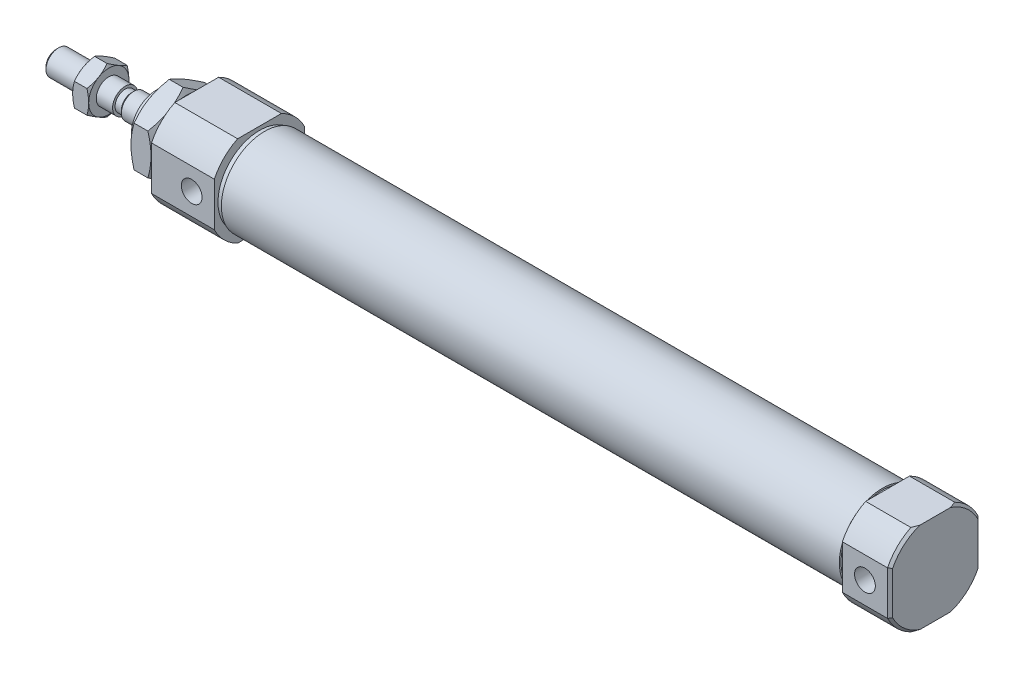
ISO-10303-21;
HEADER;
FILE_DESCRIPTION(('STEP AP214'),'2;1');
FILE_NAME('part.step','',(''),(''),'','','');
FILE_SCHEMA(('AUTOMOTIVE_DESIGN { 1 0 10303 214 1 1 1 1 }'));
ENDSEC;
DATA;
#1=APPLICATION_CONTEXT('core data for automotive mechanical design processes');
#2=APPLICATION_PROTOCOL_DEFINITION('international standard','automotive_design',2000,#1);
#3=PRODUCT_CONTEXT('',#1,'mechanical');
#4=PRODUCT('Part','Part','',(#3));
#5=PRODUCT_RELATED_PRODUCT_CATEGORY('part','',(#4));
#6=PRODUCT_DEFINITION_FORMATION('','',#4);
#7=PRODUCT_DEFINITION_CONTEXT('part definition',#1,'design');
#8=PRODUCT_DEFINITION('design','',#6,#7);
#9=PRODUCT_DEFINITION_SHAPE('','',#8);
#10=(LENGTH_UNIT() NAMED_UNIT(*) SI_UNIT(.MILLI.,.METRE.));
#11=(NAMED_UNIT(*) PLANE_ANGLE_UNIT() SI_UNIT($,.RADIAN.));
#12=(NAMED_UNIT(*) SI_UNIT($,.STERADIAN.) SOLID_ANGLE_UNIT());
#13=UNCERTAINTY_MEASURE_WITH_UNIT(LENGTH_MEASURE(1.E-05),#10,'distance_accuracy_value','');
#14=(GEOMETRIC_REPRESENTATION_CONTEXT(3) GLOBAL_UNCERTAINTY_ASSIGNED_CONTEXT((#13)) GLOBAL_UNIT_ASSIGNED_CONTEXT((#10,
#11,#12)) REPRESENTATION_CONTEXT('',''));
#15=CARTESIAN_POINT('',(0.,0.,0.));
#16=DIRECTION('',(0.,0.,1.));
#17=DIRECTION('',(1.,0.,0.));
#18=AXIS2_PLACEMENT_3D('',#15,#16,#17);
#19=CARTESIAN_POINT('',(-128.898631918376,1.24999999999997,0.));
#20=DIRECTION('',(-1.,0.,0.));
#21=DIRECTION('',(0.,0.,1.));
#22=AXIS2_PLACEMENT_3D('',#19,#20,#21);
#23=PLANE('',#22);
#24=CARTESIAN_POINT('',(-128.89863191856,0.,0.));
#25=DIRECTION('',(1.,0.,0.));
#26=DIRECTION('',(0.,0.,-1.));
#27=AXIS2_PLACEMENT_3D('',#24,#25,#26);
#28=CIRCLE('',#27,2.00000000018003);
#29=CARTESIAN_POINT('',(-128.89863191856,0.,-2.00000000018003));
#30=VERTEX_POINT('',#29);
#31=EDGE_CURVE('E20',#30,#30,#28,.T.);
#32=ORIENTED_EDGE('',*,*,#31,.F.);
#33=EDGE_LOOP('',(#32));
#34=FACE_BOUND('',#33,.T.);
#35=ADVANCED_FACE('F16',(#34),#23,.T.);
#36=CARTESIAN_POINT('',(-128.398631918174,0.,0.));
#37=DIRECTION('',(1.,0.,0.));
#38=DIRECTION('',(0.,0.,-1.));
#39=AXIS2_PLACEMENT_3D('',#36,#37,#38);
#40=CONICAL_SURFACE('',#39,2.49999999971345,0.785398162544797);
#41=ORIENTED_EDGE('',*,*,#31,.T.);
#42=EDGE_LOOP('',(#41));
#43=FACE_BOUND('',#42,.T.);
#44=CARTESIAN_POINT('',(-128.398631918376,0.,0.));
#45=DIRECTION('',(-1.,0.,0.));
#46=DIRECTION('',(0.,-1.,0.));
#47=AXIS2_PLACEMENT_3D('',#44,#45,#46);
#48=CIRCLE('',#47,2.50000000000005);
#49=CARTESIAN_POINT('',(-128.398631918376,-2.5000000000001,0.));
#50=VERTEX_POINT('',#49);
#51=EDGE_CURVE('E898',#50,#50,#48,.F.);
#52=ORIENTED_EDGE('',*,*,#51,.F.);
#53=EDGE_LOOP('',(#52));
#54=FACE_BOUND('',#53,.T.);
#55=ADVANCED_FACE('F466',(#43,#54),#40,.T.);
#56=CARTESIAN_POINT('',(-125.248631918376,0.,0.));
#57=DIRECTION('',(-1.,0.,0.));
#58=DIRECTION('',(0.,-1.,0.));
#59=AXIS2_PLACEMENT_3D('',#56,#57,#58);
#60=CYLINDRICAL_SURFACE('',#59,2.50000000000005);
#61=ORIENTED_EDGE('',*,*,#51,.T.);
#62=EDGE_LOOP('',(#61));
#63=FACE_BOUND('',#62,.T.);
#64=CARTESIAN_POINT('',(-121.598631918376,0.,0.));
#65=DIRECTION('',(-1.,0.,0.));
#66=DIRECTION('',(0.,-1.,0.));
#67=AXIS2_PLACEMENT_3D('',#64,#65,#66);
#68=CIRCLE('',#67,2.50000000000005);
#69=CARTESIAN_POINT('',(-121.598631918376,-2.5000000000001,0.));
#70=VERTEX_POINT('',#69);
#71=EDGE_CURVE('E311',#70,#70,#68,.F.);
#72=ORIENTED_EDGE('',*,*,#71,.F.);
#73=EDGE_LOOP('',(#72));
#74=FACE_BOUND('',#73,.T.);
#75=ADVANCED_FACE('F462',(#63,#74),#60,.T.);
#76=CARTESIAN_POINT('',(-121.598631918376,3.74999999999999,0.));
#77=DIRECTION('',(-1.,0.,0.));
#78=DIRECTION('',(0.,0.,1.));
#79=AXIS2_PLACEMENT_3D('',#76,#77,#78);
#80=PLANE('',#79);
#81=ORIENTED_EDGE('',*,*,#71,.T.);
#82=EDGE_LOOP('',(#81));
#83=FACE_BOUND('',#82,.T.);
#84=CARTESIAN_POINT('',(-121.598631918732,6.90947396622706E-11,0.));
#85=DIRECTION('',(1.,-7.23534025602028E-13,0.));
#86=DIRECTION('',(7.23534025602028E-13,1.,0.));
#87=AXIS2_PLACEMENT_3D('',#84,#85,#86);
#88=CIRCLE('',#87,4.00000000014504);
#89=CARTESIAN_POINT('',(-121.598631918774,6.90950727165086E-11,4.00000000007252));
#90=VERTEX_POINT('',#89);
#91=CARTESIAN_POINT('',(-121.598631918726,-3.46410161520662,2.00000000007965));
#92=VERTEX_POINT('',#91);
#93=EDGE_CURVE('E879',#90,#92,#88,.T.);
#94=ORIENTED_EDGE('',*,*,#93,.F.);
#95=CARTESIAN_POINT('',(-121.598631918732,6.90947396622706E-11,0.));
#96=DIRECTION('',(1.,-7.23534025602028E-13,0.));
#97=DIRECTION('',(7.23534025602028E-13,1.,0.));
#98=AXIS2_PLACEMENT_3D('',#95,#96,#97);
#99=CIRCLE('',#98,4.00000000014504);
#100=CARTESIAN_POINT('',(-121.598631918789,3.46410161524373,2.00000000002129));
#101=VERTEX_POINT('',#100);
#102=EDGE_CURVE('E306',#101,#90,#99,.T.);
#103=ORIENTED_EDGE('',*,*,#102,.F.);
#104=CARTESIAN_POINT('',(-121.598631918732,6.90947396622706E-11,0.));
#105=DIRECTION('',(1.,-7.23534025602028E-13,0.));
#106=DIRECTION('',(7.23534025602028E-13,1.,0.));
#107=AXIS2_PLACEMENT_3D('',#104,#105,#106);
#108=CIRCLE('',#107,4.00000000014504);
#109=CARTESIAN_POINT('',(-121.598631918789,3.46410161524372,-2.0000000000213));
#110=VERTEX_POINT('',#109);
#111=EDGE_CURVE('E300',#110,#101,#108,.T.);
#112=ORIENTED_EDGE('',*,*,#111,.F.);
#113=CARTESIAN_POINT('',(-121.598631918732,6.90947396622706E-11,0.));
#114=DIRECTION('',(1.,-7.23534025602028E-13,0.));
#115=DIRECTION('',(7.23534025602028E-13,1.,0.));
#116=AXIS2_PLACEMENT_3D('',#113,#114,#115);
#117=CIRCLE('',#116,4.00000000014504);
#118=CARTESIAN_POINT('',(-121.598631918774,6.9090914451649E-11,-4.00000000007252));
#119=VERTEX_POINT('',#118);
#120=EDGE_CURVE('E303',#119,#110,#117,.T.);
#121=ORIENTED_EDGE('',*,*,#120,.F.);
#122=CARTESIAN_POINT('',(-121.598631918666,6.90947396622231E-11,0.));
#123=DIRECTION('',(1.,-7.23534025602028E-13,0.));
#124=DIRECTION('',(7.23534025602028E-13,1.,0.));
#125=AXIS2_PLACEMENT_3D('',#122,#123,#124);
#126=CIRCLE('',#125,4.00000000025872);
#127=CARTESIAN_POINT('',(-121.598631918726,-3.46410161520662,-2.00000000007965));
#128=VERTEX_POINT('',#127);
#129=EDGE_CURVE('E322',#128,#119,#126,.T.);
#130=ORIENTED_EDGE('',*,*,#129,.F.);
#131=CARTESIAN_POINT('',(-121.598631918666,6.90947396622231E-11,0.));
#132=DIRECTION('',(1.,-7.23534025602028E-13,0.));
#133=DIRECTION('',(7.23534025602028E-13,1.,0.));
#134=AXIS2_PLACEMENT_3D('',#131,#132,#133);
#135=CIRCLE('',#134,4.00000000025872);
#136=EDGE_CURVE('E873',#92,#128,#135,.T.);
#137=ORIENTED_EDGE('',*,*,#136,.F.);
#138=EDGE_LOOP('',(#94,#103,#112,#121,#130,#137));
#139=FACE_BOUND('',#138,.T.);
#140=ADVANCED_FACE('F302',(#83,#139),#80,.T.);
#141=CARTESIAN_POINT('',(-121.239222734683,6.88346948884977E-11,0.));
#142=DIRECTION('',(1.,-7.23534025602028E-13,0.));
#143=DIRECTION('',(7.23534025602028E-13,1.,0.));
#144=AXIS2_PLACEMENT_3D('',#141,#142,#143);
#145=CONICAL_SURFACE('',#144,4.62251496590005,1.04719754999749);
#146=ORIENTED_EDGE('',*,*,#111,.T.);
#147=CARTESIAN_POINT('',(-121.24136632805,4.61880215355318,1.38031642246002E-10));
#148=CARTESIAN_POINT('',(-121.295646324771,4.5248100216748,0.16279914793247));
#149=CARTESIAN_POINT('',(-121.345376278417,4.43006516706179,0.326902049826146));
#150=CARTESIAN_POINT('',(-121.433074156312,4.23974029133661,0.656554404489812));
#151=CARTESIAN_POINT('',(-121.471100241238,4.14416690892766,0.822092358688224));
#152=CARTESIAN_POINT('',(-121.51778981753,3.99990485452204,1.07196156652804));
#153=CARTESIAN_POINT('',(-121.531633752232,3.95163526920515,1.15556694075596));
#154=CARTESIAN_POINT('',(-121.555597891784,3.85486501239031,1.32317794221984));
#155=CARTESIAN_POINT('',(-121.565718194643,3.80636434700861,1.40718355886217));
#156=CARTESIAN_POINT('',(-121.582057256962,3.7089525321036,1.57590577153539));
#157=CARTESIAN_POINT('',(-121.588256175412,3.6600405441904,1.66062381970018));
#158=CARTESIAN_POINT('',(-121.596552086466,3.56212037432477,1.83022652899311));
#159=CARTESIAN_POINT('',(-121.598648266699,3.51311217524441,1.91511121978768));
#160=CARTESIAN_POINT('',(-121.598631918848,3.46410161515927,1.99999999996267));
#161=B_SPLINE_CURVE_WITH_KNOTS('',3,(#147,#148,#149,#150,#151,#152,#153,#154,#155,#156,#157,
#158,#159,#160),.UNSPECIFIED.,.F.,.F.,(4,2,2,2,2,2,4),(0.,0.58722932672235,1.1714915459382,
1.46400599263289,1.75651273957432,2.05048788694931,2.34452123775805),.UNSPECIFIED.);
#162=CARTESIAN_POINT('',(-121.241366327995,4.61880215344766,-1.7044768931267E-11));
#163=VERTEX_POINT('',#162);
#164=EDGE_CURVE('E327',#163,#101,#161,.T.);
#165=ORIENTED_EDGE('',*,*,#164,.F.);
#166=CARTESIAN_POINT('',(-121.598631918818,3.46410161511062,-1.99999999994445));
#167=CARTESIAN_POINT('',(-121.598648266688,3.51311217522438,-1.91511121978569));
#168=CARTESIAN_POINT('',(-121.596552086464,3.56212037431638,-1.83022652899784));
#169=CARTESIAN_POINT('',(-121.588256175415,3.66004054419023,-1.66062381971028));
#170=CARTESIAN_POINT('',(-121.582057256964,3.7089525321,-1.57590577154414));
#171=CARTESIAN_POINT('',(-121.565718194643,3.80636434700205,-1.40718355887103));
#172=CARTESIAN_POINT('',(-121.555597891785,3.85486501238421,-1.32317794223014));
#173=CARTESIAN_POINT('',(-121.531633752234,3.95163526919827,-1.15556694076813));
#174=CARTESIAN_POINT('',(-121.517789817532,3.99990485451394,-1.07196156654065));
#175=CARTESIAN_POINT('',(-121.471100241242,4.14416690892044,-0.822092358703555));
#176=CARTESIAN_POINT('',(-121.433074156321,4.23974029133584,-0.656554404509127));
#177=CARTESIAN_POINT('',(-121.345376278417,4.43006516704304,-0.326902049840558));
#178=CARTESIAN_POINT('',(-121.295646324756,4.52481002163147,-0.162799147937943));
#179=CARTESIAN_POINT('',(-121.241366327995,4.61880215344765,-1.20071808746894E-10));
#180=B_SPLINE_CURVE_WITH_KNOTS('',3,(#166,#167,#168,#169,#170,#171,#172,#173,#174,#175,#176,
#177,#178,#179),.UNSPECIFIED.,.F.,.F.,(4,2,2,2,2,2,4),(0.,0.294033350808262,0.588008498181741,
0.880515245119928,1.17302969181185,1.75729191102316,2.3445212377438),.UNSPECIFIED.);
#181=EDGE_CURVE('E324',#110,#163,#180,.T.);
#182=ORIENTED_EDGE('',*,*,#181,.F.);
#183=EDGE_LOOP('',(#146,#165,#182));
#184=FACE_BOUND('',#183,.T.);
#185=ADVANCED_FACE('F325',(#184),#145,.T.);
#186=CARTESIAN_POINT('',(-121.239222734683,6.88346948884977E-11,0.));
#187=DIRECTION('',(1.,-7.23534025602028E-13,0.));
#188=DIRECTION('',(7.23534025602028E-13,1.,0.));
#189=AXIS2_PLACEMENT_3D('',#186,#187,#188);
#190=CONICAL_SURFACE('',#189,4.62251496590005,1.04719754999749);
#191=CARTESIAN_POINT('',(-121.598631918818,3.46410161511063,1.99999999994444));
#192=CARTESIAN_POINT('',(-121.598648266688,3.41509105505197,2.08488878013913));
#193=CARTESIAN_POINT('',(-121.596552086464,3.36608285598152,2.16977347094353));
#194=CARTESIAN_POINT('',(-121.588256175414,3.2681626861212,2.3393761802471));
#195=CARTESIAN_POINT('',(-121.582057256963,3.21925069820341,2.4240942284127));
#196=CARTESIAN_POINT('',(-121.565718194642,3.12183888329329,2.59281644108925));
#197=CARTESIAN_POINT('',(-121.555597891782,3.07333821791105,2.67682205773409));
#198=CARTESIAN_POINT('',(-121.531633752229,2.97656796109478,2.84443305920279));
#199=CARTESIAN_POINT('',(-121.517789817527,2.92829837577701,2.92803843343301));
#200=CARTESIAN_POINT('',(-121.471100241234,2.78403632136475,3.17790764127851));
#201=CARTESIAN_POINT('',(-121.433074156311,2.68846293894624,3.34344559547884));
#202=CARTESIAN_POINT('',(-121.345376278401,2.49813806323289,3.67309795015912));
#203=CARTESIAN_POINT('',(-121.295646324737,2.40339320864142,3.83720085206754));
#204=CARTESIAN_POINT('',(-121.241366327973,2.30940107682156,3.99999999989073));
#205=B_SPLINE_CURVE_WITH_KNOTS('',3,(#191,#192,#193,#194,#195,#196,#197,#198,#199,#200,#201,
#202,#203,#204),.UNSPECIFIED.,.F.,.F.,(4,2,2,2,2,2,4),(0.,0.29403335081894,0.588008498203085,
0.880515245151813,1.17302969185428,1.75729191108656,2.34452123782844),.UNSPECIFIED.);
#206=CARTESIAN_POINT('',(-121.24136632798,2.30940107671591,3.99999999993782));
#207=VERTEX_POINT('',#206);
#208=EDGE_CURVE('E433',#101,#207,#205,.T.);
#209=ORIENTED_EDGE('',*,*,#208,.F.);
#210=ORIENTED_EDGE('',*,*,#102,.T.);
#211=CARTESIAN_POINT('',(-121.241366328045,2.3094010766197,4.00000000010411));
#212=CARTESIAN_POINT('',(-121.295646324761,2.12141681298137,4.00000000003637));
#213=CARTESIAN_POINT('',(-121.345376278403,1.93192710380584,4.00000000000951));
#214=CARTESIAN_POINT('',(-121.433074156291,1.55127735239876,3.99999999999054));
#215=CARTESIAN_POINT('',(-121.471100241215,1.36013058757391,3.99999999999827));
#216=CARTESIAN_POINT('',(-121.517789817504,1.07160647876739,4.00000000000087));
#217=CARTESIAN_POINT('',(-121.531633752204,0.975067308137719,4.00000000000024));
#218=CARTESIAN_POINT('',(-121.555597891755,0.781526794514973,3.99999999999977));
#219=CARTESIAN_POINT('',(-121.565718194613,0.684525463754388,3.99999999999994));
#220=CARTESIAN_POINT('',(-121.582057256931,0.489701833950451,4.00000000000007));
#221=CARTESIAN_POINT('',(-121.58825617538,0.391877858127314,4.00000000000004));
#222=CARTESIAN_POINT('',(-121.596552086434,0.196037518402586,3.99999999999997));
#223=CARTESIAN_POINT('',(-121.598648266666,0.0980211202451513,3.99999999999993));
#224=CARTESIAN_POINT('',(-121.598631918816,7.79982475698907E-11,4.));
#225=B_SPLINE_CURVE_WITH_KNOTS('',3,(#211,#212,#213,#214,#215,#216,#217,#218,#219,#220,#221,
#222,#223,#224),.UNSPECIFIED.,.F.,.F.,(4,2,2,2,2,2,4),(0.,0.587229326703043,1.17149154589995,
1.46400599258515,1.7565127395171,2.05048788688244,2.34452123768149),.UNSPECIFIED.);
#226=EDGE_CURVE('E440',#207,#90,#225,.T.);
#227=ORIENTED_EDGE('',*,*,#226,.F.);
#228=EDGE_LOOP('',(#209,#210,#227));
#229=FACE_BOUND('',#228,.T.);
#230=ADVANCED_FACE('F448',(#229),#190,.T.);
#231=CARTESIAN_POINT('',(-121.239222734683,6.88346948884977E-11,0.));
#232=DIRECTION('',(1.,-7.23534025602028E-13,0.));
#233=DIRECTION('',(7.23534025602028E-13,1.,0.));
#234=AXIS2_PLACEMENT_3D('',#231,#232,#233);
#235=CONICAL_SURFACE('',#234,4.62251496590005,1.04719754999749);
#236=CARTESIAN_POINT('',(-121.598631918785,6.90951608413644E-11,3.99999999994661));
#237=CARTESIAN_POINT('',(-121.598648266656,-0.0980211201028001,3.99999999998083));
#238=CARTESIAN_POINT('',(-121.596552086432,-0.196037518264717,3.99999999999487));
#239=CARTESIAN_POINT('',(-121.588256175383,-0.391877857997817,4.00000000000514));
#240=CARTESIAN_POINT('',(-121.582057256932,-0.489701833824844,4.00000000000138));
#241=CARTESIAN_POINT('',(-121.565718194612,-0.684525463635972,3.99999999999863));
#242=CARTESIAN_POINT('',(-121.555597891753,-0.78152679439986,3.99999999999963));
#243=CARTESIAN_POINT('',(-121.531633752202,-0.975067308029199,4.00000000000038));
#244=CARTESIAN_POINT('',(-121.5177898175,-1.07160647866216,4.00000000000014));
#245=CARTESIAN_POINT('',(-121.47110024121,-1.36013058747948,3.99999999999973));
#246=CARTESIAN_POINT('',(-121.433074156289,-1.55127735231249,3.99999999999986));
#247=CARTESIAN_POINT('',(-121.345376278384,-1.93192710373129,4.00000000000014));
#248=CARTESIAN_POINT('',(-121.295646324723,-2.12141681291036,4.00000000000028));
#249=CARTESIAN_POINT('',(-121.241366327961,-2.30940107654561,4.));
#250=B_SPLINE_CURVE_WITH_KNOTS('',3,(#236,#237,#238,#239,#240,#241,#242,#243,#244,#245,#246,
#247,#248,#249),.UNSPECIFIED.,.F.,.F.,(4,2,2,2,2,2,4),(0.,0.294033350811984,0.58800849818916,
0.880515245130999,1.17302969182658,1.75729191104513,2.34452123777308),.UNSPECIFIED.);
#251=CARTESIAN_POINT('',(-121.241366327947,-2.3094010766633,3.99999999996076));
#252=VERTEX_POINT('',#251);
#253=EDGE_CURVE('E894',#90,#252,#250,.T.);
#254=ORIENTED_EDGE('',*,*,#253,.F.);
#255=ORIENTED_EDGE('',*,*,#93,.T.);
#256=CARTESIAN_POINT('',(-121.241366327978,-2.30940107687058,3.99999999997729));
#257=CARTESIAN_POINT('',(-121.295646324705,-2.40339320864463,3.83720085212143));
#258=CARTESIAN_POINT('',(-121.345376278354,-2.49813806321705,3.67309795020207));
#259=CARTESIAN_POINT('',(-121.433074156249,-2.68846293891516,3.34344559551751));
#260=CARTESIAN_POINT('',(-121.471100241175,-2.78403632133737,3.17790764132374));
#261=CARTESIAN_POINT('',(-121.517789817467,-2.92829837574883,2.92803843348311));
#262=CARTESIAN_POINT('',(-121.531633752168,-2.97656796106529,2.84443305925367));
#263=CARTESIAN_POINT('',(-121.55559789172,-3.07333821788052,2.67682205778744));
#264=CARTESIAN_POINT('',(-121.565718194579,-3.12183888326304,2.59281644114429));
#265=CARTESIAN_POINT('',(-121.582057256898,-3.21925069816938,2.42409422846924));
#266=CARTESIAN_POINT('',(-121.588256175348,-3.26816268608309,2.33937618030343));
#267=CARTESIAN_POINT('',(-121.596552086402,-3.36608285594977,2.16977347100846));
#268=CARTESIAN_POINT('',(-121.598648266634,-3.41509105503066,2.08488878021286));
#269=CARTESIAN_POINT('',(-121.598631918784,-3.46410161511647,2.00000000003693));
#270=B_SPLINE_CURVE_WITH_KNOTS('',3,(#256,#257,#258,#259,#260,#261,#262,#263,#264,#265,#266,
#267,#268,#269),.UNSPECIFIED.,.F.,.F.,(4,2,2,2,2,2,4),(0.,0.58722932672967,1.17149154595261,
1.46400599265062,1.75651273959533,2.05048788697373,2.34452123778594),.UNSPECIFIED.);
#271=EDGE_CURVE('E851',#252,#92,#270,.T.);
#272=ORIENTED_EDGE('',*,*,#271,.F.);
#273=EDGE_LOOP('',(#254,#255,#272));
#274=FACE_BOUND('',#273,.T.);
#275=ADVANCED_FACE('F452',(#274),#235,.T.);
#276=CARTESIAN_POINT('',(-121.239222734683,6.88346948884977E-11,0.));
#277=DIRECTION('',(1.,-7.23534025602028E-13,0.));
#278=DIRECTION('',(7.23534025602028E-13,1.,0.));
#279=AXIS2_PLACEMENT_3D('',#276,#277,#278);
#280=CONICAL_SURFACE('',#279,4.62251496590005,1.04719754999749);
#281=ORIENTED_EDGE('',*,*,#136,.T.);
#282=CARTESIAN_POINT('',(-121.241366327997,-4.61880215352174,-1.96038223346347E-10));
#283=CARTESIAN_POINT('',(-121.295646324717,-4.52481002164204,-0.162799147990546));
#284=CARTESIAN_POINT('',(-121.345376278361,-4.43006516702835,-0.326902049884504));
#285=CARTESIAN_POINT('',(-121.433074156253,-4.2397402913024,-0.656554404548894));
#286=CARTESIAN_POINT('',(-121.471100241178,-4.14416690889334,-0.822092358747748));
#287=CARTESIAN_POINT('',(-121.517789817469,-3.99990485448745,-1.0719615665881));
#288=CARTESIAN_POINT('',(-121.53163375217,-3.95163526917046,-1.15556694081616));
#289=CARTESIAN_POINT('',(-121.555597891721,-3.85486501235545,-1.32317794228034));
#290=CARTESIAN_POINT('',(-121.565718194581,-3.80636434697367,-1.40718355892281));
#291=CARTESIAN_POINT('',(-121.582057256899,-3.70895253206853,-1.57590577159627));
#292=CARTESIAN_POINT('',(-121.588256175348,-3.66004054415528,-1.66062381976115));
#293=CARTESIAN_POINT('',(-121.596552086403,-3.56212037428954,-1.83022652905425));
#294=CARTESIAN_POINT('',(-121.598648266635,-3.51311217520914,-1.9151112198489));
#295=CARTESIAN_POINT('',(-121.598631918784,-3.46410161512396,-2.00000000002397));
#296=B_SPLINE_CURVE_WITH_KNOTS('',3,(#282,#283,#284,#285,#286,#287,#288,#289,#290,#291,#292,
#293,#294,#295),.UNSPECIFIED.,.F.,.F.,(4,2,2,2,2,2,4),(0.,0.58722932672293,1.1714915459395,
1.46400599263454,1.75651273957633,2.05048788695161,2.34452123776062),.UNSPECIFIED.);
#297=CARTESIAN_POINT('',(-121.241366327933,-4.61880215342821,-6.5529462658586E-12));
#298=VERTEX_POINT('',#297);
#299=EDGE_CURVE('E852',#298,#128,#296,.T.);
#300=ORIENTED_EDGE('',*,*,#299,.F.);
#301=CARTESIAN_POINT('',(-121.598631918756,-3.46410161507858,2.00000000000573));
#302=CARTESIAN_POINT('',(-121.598648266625,-3.51311217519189,1.91511121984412));
#303=CARTESIAN_POINT('',(-121.5965520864,-3.56212037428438,1.83022652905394));
#304=CARTESIAN_POINT('',(-121.588256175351,-3.66004054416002,1.66062381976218));
#305=CARTESIAN_POINT('',(-121.5820572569,-3.70895253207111,1.57590577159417));
#306=CARTESIAN_POINT('',(-121.565718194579,-3.80636434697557,1.40718355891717));
#307=CARTESIAN_POINT('',(-121.555597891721,-3.85486501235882,1.32317794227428));
#308=CARTESIAN_POINT('',(-121.531633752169,-3.95163526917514,1.1555669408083));
#309=CARTESIAN_POINT('',(-121.517789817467,-3.99990485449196,1.07196156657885));
#310=CARTESIAN_POINT('',(-121.471100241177,-4.1441669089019,0.822092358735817));
#311=CARTESIAN_POINT('',(-121.433074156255,-4.23974029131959,0.656554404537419));
#312=CARTESIAN_POINT('',(-121.34537627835,-4.43006516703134,0.326902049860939));
#313=CARTESIAN_POINT('',(-121.295646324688,-4.52481002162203,0.162799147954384));
#314=CARTESIAN_POINT('',(-121.241366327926,-4.61880215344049,1.32603140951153E-10));
#315=B_SPLINE_CURVE_WITH_KNOTS('',3,(#301,#302,#303,#304,#305,#306,#307,#308,#309,#310,#311,
#312,#313,#314),.UNSPECIFIED.,.F.,.F.,(4,2,2,2,2,2,4),(0.,0.294033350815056,0.588008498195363,
0.880515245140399,1.17302969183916,1.75729191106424,2.34452123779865),.UNSPECIFIED.);
#316=EDGE_CURVE('E845',#92,#298,#315,.T.);
#317=ORIENTED_EDGE('',*,*,#316,.F.);
#318=EDGE_LOOP('',(#281,#300,#317));
#319=FACE_BOUND('',#318,.T.);
#320=ADVANCED_FACE('F859',(#319),#280,.T.);
#321=CARTESIAN_POINT('',(-121.239222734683,6.88346948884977E-11,0.));
#322=DIRECTION('',(1.,-7.23534025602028E-13,0.));
#323=DIRECTION('',(7.23534025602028E-13,1.,0.));
#324=AXIS2_PLACEMENT_3D('',#321,#322,#323);
#325=CONICAL_SURFACE('',#324,4.62251496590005,1.04719754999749);
#326=ORIENTED_EDGE('',*,*,#129,.T.);
#327=CARTESIAN_POINT('',(-121.241366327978,-2.30940107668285,-4.00000000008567));
#328=CARTESIAN_POINT('',(-121.29564632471,-2.12141681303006,-4.00000000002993));
#329=CARTESIAN_POINT('',(-121.345376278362,-1.93192710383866,-4.00000000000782));
#330=CARTESIAN_POINT('',(-121.433074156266,-1.55127735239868,-3.99999999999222));
#331=CARTESIAN_POINT('',(-121.471100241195,-1.3601305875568,-3.99999999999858));
#332=CARTESIAN_POINT('',(-121.517789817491,-1.07160647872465,-4.00000000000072));
#333=CARTESIAN_POINT('',(-121.531633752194,-0.975067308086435,-4.00000000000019));
#334=CARTESIAN_POINT('',(-121.555597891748,-0.7815267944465,-3.99999999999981));
#335=CARTESIAN_POINT('',(-121.565718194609,-0.684525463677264,-3.99999999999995));
#336=CARTESIAN_POINT('',(-121.582057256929,-0.489701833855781,-4.00000000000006));
#337=CARTESIAN_POINT('',(-121.588256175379,-0.391877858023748,-4.00000000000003));
#338=CARTESIAN_POINT('',(-121.596552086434,-0.196037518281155,-3.99999999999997));
#339=CARTESIAN_POINT('',(-121.598648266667,-0.0980211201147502,-3.99999999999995));
#340=CARTESIAN_POINT('',(-121.598631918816,6.13750862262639E-11,-4.));
#341=B_SPLINE_CURVE_WITH_KNOTS('',3,(#327,#328,#329,#330,#331,#332,#333,#334,#335,#336,#337,
#338,#339,#340),.UNSPECIFIED.,.F.,.F.,(4,2,2,2,2,2,4),(0.,0.587229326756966,1.17149154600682,
1.46400599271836,1.75651273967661,2.05048788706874,2.3445212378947),.UNSPECIFIED.);
#342=CARTESIAN_POINT('',(-121.241366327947,-2.30940107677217,-3.9999999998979));
#343=VERTEX_POINT('',#342);
#344=EDGE_CURVE('E363',#343,#119,#341,.T.);
#345=ORIENTED_EDGE('',*,*,#344,.F.);
#346=CARTESIAN_POINT('',(-121.59863191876,-3.46410161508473,-2.00000000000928));
#347=CARTESIAN_POINT('',(-121.598648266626,-3.4150910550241,-2.08488878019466));
#348=CARTESIAN_POINT('',(-121.596552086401,-3.36608285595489,-2.16977347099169));
#349=CARTESIAN_POINT('',(-121.588256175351,-3.26816268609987,-2.33937618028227));
#350=CARTESIAN_POINT('',(-121.582057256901,-3.21925069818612,-2.42409422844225));
#351=CARTESIAN_POINT('',(-121.565718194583,-3.12183888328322,-2.59281644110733));
#352=CARTESIAN_POINT('',(-121.555597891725,-3.07333821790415,-2.67682205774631));
#353=CARTESIAN_POINT('',(-121.531633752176,-2.97656796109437,-2.8444330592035));
#354=CARTESIAN_POINT('',(-121.517789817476,-2.92829837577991,-2.92803843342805));
#355=CARTESIAN_POINT('',(-121.47110024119,-2.78403632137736,-3.1779076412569));
#356=CARTESIAN_POINT('',(-121.433074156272,-2.6884629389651,-3.34344559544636));
#357=CARTESIAN_POINT('',(-121.345376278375,-2.49813806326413,-3.6730979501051));
#358=CARTESIAN_POINT('',(-121.295646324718,-2.40339320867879,-3.83720085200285));
#359=CARTESIAN_POINT('',(-121.241366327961,-2.309401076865,-3.9999999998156));
#360=B_SPLINE_CURVE_WITH_KNOTS('',3,(#346,#347,#348,#349,#350,#351,#352,#353,#354,#355,#356,
#357,#358,#359),.UNSPECIFIED.,.F.,.F.,(4,2,2,2,2,2,4),(0.,0.294033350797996,0.588008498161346,
0.880515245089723,1.17302969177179,1.75729191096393,2.34452123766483),.UNSPECIFIED.);
#361=EDGE_CURVE('E882',#128,#343,#360,.T.);
#362=ORIENTED_EDGE('',*,*,#361,.F.);
#363=EDGE_LOOP('',(#326,#345,#362));
#364=FACE_BOUND('',#363,.T.);
#365=ADVANCED_FACE('F352',(#364),#325,.T.);
#366=CARTESIAN_POINT('',(-121.239222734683,6.88346948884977E-11,0.));
#367=DIRECTION('',(1.,-7.23534025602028E-13,0.));
#368=DIRECTION('',(7.23534025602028E-13,1.,0.));
#369=AXIS2_PLACEMENT_3D('',#366,#367,#368);
#370=CONICAL_SURFACE('',#369,4.62251496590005,1.04719754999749);
#371=ORIENTED_EDGE('',*,*,#120,.T.);
#372=CARTESIAN_POINT('',(-121.241366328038,2.3094010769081,-3.9999999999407));
#373=CARTESIAN_POINT('',(-121.295646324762,2.40339320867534,-3.83720085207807));
#374=CARTESIAN_POINT('',(-121.345376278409,2.49813806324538,-3.67309795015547));
#375=CARTESIAN_POINT('',(-121.433074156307,2.68846293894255,-3.34344559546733));
#376=CARTESIAN_POINT('',(-121.471100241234,2.7840363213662,-3.17790764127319));
#377=CARTESIAN_POINT('',(-121.517789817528,2.92829837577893,-2.92803843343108));
#378=CARTESIAN_POINT('',(-121.53163375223,2.97656796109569,-2.84443305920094));
#379=CARTESIAN_POINT('',(-121.555597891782,3.07333821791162,-2.67682205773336));
#380=CARTESIAN_POINT('',(-121.565718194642,3.12183888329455,-2.59281644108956));
#381=CARTESIAN_POINT('',(-121.582057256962,3.21925069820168,-2.42409422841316));
#382=CARTESIAN_POINT('',(-121.588256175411,3.26816268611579,-2.33937618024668));
#383=CARTESIAN_POINT('',(-121.596552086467,3.36608285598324,-2.16977347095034));
#384=CARTESIAN_POINT('',(-121.598648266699,3.41509105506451,-2.08488878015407));
#385=CARTESIAN_POINT('',(-121.598631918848,3.46410161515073,-1.99999999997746));
#386=B_SPLINE_CURVE_WITH_KNOTS('',3,(#372,#373,#374,#375,#376,#377,#378,#379,#380,#381,#382,
#383,#384,#385),.UNSPECIFIED.,.F.,.F.,(4,2,2,2,2,2,4),(0.,0.587229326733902,1.17149154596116,
1.46400599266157,1.75651273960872,2.0504878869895,2.34452123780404),.UNSPECIFIED.);
#387=CARTESIAN_POINT('',(-121.241366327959,2.30940107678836,-3.99999999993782));
#388=VERTEX_POINT('',#387);
#389=EDGE_CURVE('E317',#388,#110,#386,.T.);
#390=ORIENTED_EDGE('',*,*,#389,.F.);
#391=CARTESIAN_POINT('',(-121.598631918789,6.90913767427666E-11,-3.99999999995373));
#392=CARTESIAN_POINT('',(-121.598648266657,0.0980211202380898,-3.99999999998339));
#393=CARTESIAN_POINT('',(-121.596552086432,0.196037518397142,-3.99999999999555));
#394=CARTESIAN_POINT('',(-121.588256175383,0.391877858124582,-4.00000000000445));
#395=CARTESIAN_POINT('',(-121.582057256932,0.489701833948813,-4.00000000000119));
#396=CARTESIAN_POINT('',(-121.565718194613,0.684525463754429,-3.99999999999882));
#397=CARTESIAN_POINT('',(-121.555597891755,0.7815267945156,-3.99999999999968));
#398=CARTESIAN_POINT('',(-121.531633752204,0.975067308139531,-4.00000000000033));
#399=CARTESIAN_POINT('',(-121.517789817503,1.0716064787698,-4.00000000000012));
#400=CARTESIAN_POINT('',(-121.471100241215,1.36013058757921,-3.99999999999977));
#401=CARTESIAN_POINT('',(-121.433074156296,1.55127735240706,-3.99999999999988));
#402=CARTESIAN_POINT('',(-121.345376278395,1.93192710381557,-4.00000000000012));
#403=CARTESIAN_POINT('',(-121.295646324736,2.1214168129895,-4.00000000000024));
#404=CARTESIAN_POINT('',(-121.241366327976,2.3094010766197,-4.));
#405=B_SPLINE_CURVE_WITH_KNOTS('',3,(#391,#392,#393,#394,#395,#396,#397,#398,#399,#400,#401,
#402,#403,#404),.UNSPECIFIED.,.F.,.F.,(4,2,2,2,2,2,4),(0.,0.294033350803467,0.588008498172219,
0.880515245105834,1.17302969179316,1.75729191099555,2.344521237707),.UNSPECIFIED.);
#406=EDGE_CURVE('E320',#119,#388,#405,.T.);
#407=ORIENTED_EDGE('',*,*,#406,.F.);
#408=EDGE_LOOP('',(#371,#390,#407));
#409=FACE_BOUND('',#408,.T.);
#410=ADVANCED_FACE('F315',(#409),#370,.T.);
#411=CARTESIAN_POINT('',(-121.598631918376,4.61880215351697,0.));
#412=DIRECTION('',(0.,0.866025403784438,-0.500000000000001));
#413=DIRECTION('',(0.,0.500000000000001,0.866025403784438));
#414=AXIS2_PLACEMENT_3D('',#411,#412,#413);
#415=PLANE('',#414);
#416=ORIENTED_EDGE('',*,*,#181,.T.);
#417=DIRECTION('',(1.,0.,0.));
#418=VECTOR('',#417,1.);
#419=CARTESIAN_POINT('',(-121.598631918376,4.6188021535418,-4.30124685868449E-11));
#420=LINE('',#419,#418);
#421=CARTESIAN_POINT('',(-118.755897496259,4.6188021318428,3.75407627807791E-08));
#422=VERTEX_POINT('',#421);
#423=EDGE_CURVE('E330',#422,#163,#420,.F.);
#424=ORIENTED_EDGE('',*,*,#423,.F.);
#425=CARTESIAN_POINT('',(-118.398631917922,3.46410161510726,-1.99999999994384));
#426=CARTESIAN_POINT('',(-118.39861557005,3.51311217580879,-1.91511121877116));
#427=CARTESIAN_POINT('',(-118.400711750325,3.56212037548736,-1.83022652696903));
#428=CARTESIAN_POINT('',(-118.409007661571,3.66004054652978,-1.66062381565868));
#429=CARTESIAN_POINT('',(-118.415206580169,3.70895253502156,-1.57590576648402));
#430=CARTESIAN_POINT('',(-118.431545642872,3.80636435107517,-1.40718355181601));
#431=CARTESIAN_POINT('',(-118.441665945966,3.85486501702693,-1.32317793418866));
#432=CARTESIAN_POINT('',(-118.465630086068,3.95163527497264,-1.15556693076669));
#433=CARTESIAN_POINT('',(-118.479474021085,3.99990486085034,-1.07196155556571));
#434=CARTESIAN_POINT('',(-118.526163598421,4.14416691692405,-0.822092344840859));
#435=CARTESIAN_POINT('',(-118.564189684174,4.2397403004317,-0.656554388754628));
#436=CARTESIAN_POINT('',(-118.651887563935,4.43006517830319,-0.326902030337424));
#437=CARTESIAN_POINT('',(-118.701617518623,4.52481003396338,-0.162799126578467));
#438=CARTESIAN_POINT('',(-118.755897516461,4.61880216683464,2.3066871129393E-08));
#439=B_SPLINE_CURVE_WITH_KNOTS('',3,(#425,#426,#427,#428,#429,#430,#431,#432,#433,#434,#435,
#436,#437,#438),.UNSPECIFIED.,.F.,.F.,(4,2,2,2,2,2,4),(0.,0.294033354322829,0.588008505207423,
0.880515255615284,1.1730297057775,1.75729193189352,2.34452126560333),.UNSPECIFIED.);
#440=CARTESIAN_POINT('',(-118.398631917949,3.46410161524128,-2.00000000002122));
#441=VERTEX_POINT('',#440);
#442=EDGE_CURVE('E408',#441,#422,#439,.T.);
#443=ORIENTED_EDGE('',*,*,#442,.F.);
#444=CARTESIAN_POINT('',(-118.755897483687,2.30940112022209,-3.99999992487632));
#445=CARTESIAN_POINT('',(-118.701617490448,2.40339324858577,-3.8372007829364));
#446=CARTESIAN_POINT('',(-118.651887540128,2.49813809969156,-3.67309788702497));
#447=CARTESIAN_POINT('',(-118.56418966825,2.68846296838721,-3.34344554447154));
#448=CARTESIAN_POINT('',(-118.526163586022,2.78403634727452,-3.17790759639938));
#449=CARTESIAN_POINT('',(-118.479474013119,2.92829839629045,-2.92803839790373));
#450=CARTESIAN_POINT('',(-118.46563007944,2.97656797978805,-2.84443302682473));
#451=CARTESIAN_POINT('',(-118.441665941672,3.0733382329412,-2.67682203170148));
#452=CARTESIAN_POINT('',(-118.431545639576,3.12183889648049,-2.59281641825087));
#453=CARTESIAN_POINT('',(-118.415206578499,3.21925070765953,-2.42409421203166));
#454=CARTESIAN_POINT('',(-118.409007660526,3.26816269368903,-2.33937616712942));
#455=CARTESIAN_POINT('',(-118.400711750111,3.36608285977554,-2.1697734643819));
#456=CARTESIAN_POINT('',(-118.398615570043,3.41509105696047,-2.0848887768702));
#457=CARTESIAN_POINT('',(-118.398631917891,3.46410161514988,-1.99999999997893));
#458=B_SPLINE_CURVE_WITH_KNOTS('',3,(#444,#445,#446,#447,#448,#449,#450,#451,#452,#453,#454,
#455,#456,#457),.UNSPECIFIED.,.F.,.F.,(4,2,2,2,2,2,4),(0.,0.587229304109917,1.17149150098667,
1.46400593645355,1.7565126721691,2.05048780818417,2.344521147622),.UNSPECIFIED.);
#459=CARTESIAN_POINT('',(-118.755897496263,2.3094010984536,-3.99999996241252));
#460=VERTEX_POINT('',#459);
#461=EDGE_CURVE('E364',#460,#441,#458,.T.);
#462=ORIENTED_EDGE('',*,*,#461,.F.);
#463=DIRECTION('',(-1.,0.,0.));
#464=VECTOR('',#463,1.);
#465=CARTESIAN_POINT('',(-121.598631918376,2.30940107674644,-4.));
#466=LINE('',#465,#464);
#467=EDGE_CURVE('E334',#388,#460,#466,.F.);
#468=ORIENTED_EDGE('',*,*,#467,.F.);
#469=ORIENTED_EDGE('',*,*,#389,.T.);
#470=EDGE_LOOP('',(#416,#424,#443,#462,#468,#469));
#471=FACE_BOUND('',#470,.T.);
#472=ADVANCED_FACE('F332',(#471),#415,.T.);
#473=CARTESIAN_POINT('',(-121.598631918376,2.30940107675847,4.));
#474=DIRECTION('',(0.,0.866025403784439,0.5));
#475=DIRECTION('',(0.,-0.5,0.866025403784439));
#476=AXIS2_PLACEMENT_3D('',#473,#474,#475);
#477=PLANE('',#476);
#478=ORIENTED_EDGE('',*,*,#208,.T.);
#479=DIRECTION('',(1.,0.,0.));
#480=VECTOR('',#479,1.);
#481=CARTESIAN_POINT('',(-121.598631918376,2.30940107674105,4.));
#482=LINE('',#481,#480);
#483=CARTESIAN_POINT('',(-118.755897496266,2.30940103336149,4.));
#484=VERTEX_POINT('',#483);
#485=EDGE_CURVE('E439',#484,#207,#482,.F.);
#486=ORIENTED_EDGE('',*,*,#485,.F.);
#487=CARTESIAN_POINT('',(-118.39863191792,3.46410161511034,1.99999999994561));
#488=CARTESIAN_POINT('',(-118.39861557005,3.41509105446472,2.08488878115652));
#489=CARTESIAN_POINT('',(-118.400711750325,3.36608285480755,2.16977347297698));
#490=CARTESIAN_POINT('',(-118.409007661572,3.26816268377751,2.33937618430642));
#491=CARTESIAN_POINT('',(-118.415206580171,3.21925069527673,2.42409423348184));
#492=CARTESIAN_POINT('',(-118.431545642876,3.1218388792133,2.59281644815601));
#493=CARTESIAN_POINT('',(-118.441665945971,3.07333821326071,2.67682206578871));
#494=CARTESIAN_POINT('',(-118.465630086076,2.97656795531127,2.84443306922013));
#495=CARTESIAN_POINT('',(-118.479474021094,2.92829836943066,2.9280384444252));
#496=CARTESIAN_POINT('',(-118.526163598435,2.78403631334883,3.1779076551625));
#497=CARTESIAN_POINT('',(-118.564189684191,2.68846292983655,3.34344561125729));
#498=CARTESIAN_POINT('',(-118.651887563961,2.49813805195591,3.67309796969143));
#499=CARTESIAN_POINT('',(-118.701617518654,2.40339319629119,3.83720087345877));
#500=CARTESIAN_POINT('',(-118.755897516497,2.30940106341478,4.00000002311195));
#501=B_SPLINE_CURVE_WITH_KNOTS('',3,(#487,#488,#489,#490,#491,#492,#493,#494,#495,#496,#497,
#498,#499,#500),.UNSPECIFIED.,.F.,.F.,(4,2,2,2,2,2,4),(0.,0.294033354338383,0.588008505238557,
0.880515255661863,1.17302970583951,1.75729193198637,2.34452126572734),.UNSPECIFIED.);
#502=CARTESIAN_POINT('',(-118.398631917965,3.4641016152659,2.00000000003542));
#503=VERTEX_POINT('',#502);
#504=EDGE_CURVE('E427',#503,#484,#501,.T.);
#505=ORIENTED_EDGE('',*,*,#504,.F.);
#506=CARTESIAN_POINT('',(-118.755897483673,4.61880211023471,7.51578148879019E-08));
#507=CARTESIAN_POINT('',(-118.701617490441,4.52480998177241,0.162799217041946));
#508=CARTESIAN_POINT('',(-118.651887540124,4.43006513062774,0.326902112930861));
#509=CARTESIAN_POINT('',(-118.564189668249,4.23974026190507,0.656554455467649));
#510=CARTESIAN_POINT('',(-118.52616358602,4.14416688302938,0.822092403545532));
#511=CARTESIAN_POINT('',(-118.479474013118,3.99990483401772,1.07196160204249));
#512=CARTESIAN_POINT('',(-118.465630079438,3.95163525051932,1.15556697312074));
#513=CARTESIAN_POINT('',(-118.441665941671,3.85486499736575,1.32317796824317));
#514=CARTESIAN_POINT('',(-118.431545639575,3.80636433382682,1.4071835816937));
#515=CARTESIAN_POINT('',(-118.415206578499,3.70895252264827,1.57590578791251));
#516=CARTESIAN_POINT('',(-118.409007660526,3.66004053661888,1.66062383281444));
#517=CARTESIAN_POINT('',(-118.400711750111,3.56212037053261,1.83022653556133));
#518=CARTESIAN_POINT('',(-118.398615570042,3.51311217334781,1.91511122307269));
#519=CARTESIAN_POINT('',(-118.398631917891,3.46410161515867,1.99999999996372));
#520=B_SPLINE_CURVE_WITH_KNOTS('',3,(#506,#507,#508,#509,#510,#511,#512,#513,#514,#515,#516,
#517,#518,#519),.UNSPECIFIED.,.F.,.F.,(4,2,2,2,2,2,4),(0.,0.587229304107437,1.17149150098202,
1.46400593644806,1.7565126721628,2.05048780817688,2.34452114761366),.UNSPECIFIED.);
#521=EDGE_CURVE('E402',#422,#503,#520,.T.);
#522=ORIENTED_EDGE('',*,*,#521,.F.);
#523=ORIENTED_EDGE('',*,*,#423,.T.);
#524=ORIENTED_EDGE('',*,*,#164,.T.);
#525=EDGE_LOOP('',(#478,#486,#505,#522,#523,#524));
#526=FACE_BOUND('',#525,.T.);
#527=ADVANCED_FACE('F416',(#526),#477,.T.);
#528=CARTESIAN_POINT('',(-121.598631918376,-2.30940107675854,4.));
#529=DIRECTION('',(0.,0.,1.));
#530=DIRECTION('',(1.,0.,0.));
#531=AXIS2_PLACEMENT_3D('',#528,#529,#530);
#532=PLANE('',#531);
#533=ORIENTED_EDGE('',*,*,#253,.T.);
#534=DIRECTION('',(1.,0.,0.));
#535=VECTOR('',#534,1.);
#536=CARTESIAN_POINT('',(-121.598631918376,-2.30940107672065,4.00000000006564));
#537=LINE('',#536,#535);
#538=CARTESIAN_POINT('',(-118.755897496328,-2.30940109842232,3.99999996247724));
#539=VERTEX_POINT('',#538);
#540=EDGE_CURVE('E891',#539,#252,#537,.F.);
#541=ORIENTED_EDGE('',*,*,#540,.F.);
#542=CARTESIAN_POINT('',(-118.398631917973,6.67851097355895E-11,3.99999999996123));
#543=CARTESIAN_POINT('',(-118.398615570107,-0.0980211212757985,3.99999999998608));
#544=CARTESIAN_POINT('',(-118.400711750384,-0.196037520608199,3.99999999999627));
#545=CARTESIAN_POINT('',(-118.409007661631,-0.391877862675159,4.00000000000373));
#546=CARTESIAN_POINT('',(-118.415206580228,-0.489701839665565,4.000000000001));
#547=CARTESIAN_POINT('',(-118.43154564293,-0.684525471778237,3.99999999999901));
#548=CARTESIAN_POINT('',(-118.441665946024,-0.781526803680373,3.99999999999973));
#549=CARTESIAN_POINT('',(-118.465630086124,-0.975067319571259,4.00000000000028));
#550=CARTESIAN_POINT('',(-118.47947402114,-1.07160649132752,4.0000000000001));
#551=CARTESIAN_POINT('',(-118.526163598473,-1.36013060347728,3.9999999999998));
#552=CARTESIAN_POINT('',(-118.564189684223,-1.55127737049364,3.9999999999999));
#553=CARTESIAN_POINT('',(-118.651887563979,-1.93192712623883,4.0000000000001));
#554=CARTESIAN_POINT('',(-118.701617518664,-2.12141683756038,4.0000000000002));
#555=CARTESIAN_POINT('',(-118.755897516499,-2.30940110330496,4.));
#556=B_SPLINE_CURVE_WITH_KNOTS('',3,(#542,#543,#544,#545,#546,#547,#548,#549,#550,#551,#552,
#553,#554,#555),.UNSPECIFIED.,.F.,.F.,(4,2,2,2,2,2,4),(0.,0.294033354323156,0.588008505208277,
0.880515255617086,1.17302970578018,1.75729193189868,2.34452126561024),.UNSPECIFIED.);
#557=CARTESIAN_POINT('',(-118.398631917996,6.67853218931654E-11,4.00000000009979));
#558=VERTEX_POINT('',#557);
#559=EDGE_CURVE('E828',#558,#539,#556,.T.);
#560=ORIENTED_EDGE('',*,*,#559,.F.);
#561=CARTESIAN_POINT('',(-118.755897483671,2.3094009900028,4.00000000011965));
#562=CARTESIAN_POINT('',(-118.701617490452,2.12141673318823,4.0000000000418));
#563=CARTESIAN_POINT('',(-118.651887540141,1.93192703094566,4.00000000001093));
#564=CARTESIAN_POINT('',(-118.564189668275,1.55127729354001,3.99999999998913));
#565=CARTESIAN_POINT('',(-118.526163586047,1.3601305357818,3.99999999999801));
#566=CARTESIAN_POINT('',(-118.479474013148,1.07160643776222,4.000000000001));
#567=CARTESIAN_POINT('',(-118.465630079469,0.975067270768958,4.00000000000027));
#568=CARTESIAN_POINT('',(-118.441665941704,0.781526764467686,3.99999999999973));
#569=CARTESIAN_POINT('',(-118.431545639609,0.684525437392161,3.99999999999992));
#570=CARTESIAN_POINT('',(-118.415206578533,0.489701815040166,4.00000000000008));
#571=CARTESIAN_POINT('',(-118.409007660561,0.391877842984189,4.00000000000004));
#572=CARTESIAN_POINT('',(-118.400711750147,0.196037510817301,3.99999999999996));
#573=CARTESIAN_POINT('',(-118.398615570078,0.0980211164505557,3.99999999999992));
#574=CARTESIAN_POINT('',(-118.398631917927,7.49765074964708E-11,4.));
#575=B_SPLINE_CURVE_WITH_KNOTS('',3,(#561,#562,#563,#564,#565,#566,#567,#568,#569,#570,#571,
#572,#573,#574),.UNSPECIFIED.,.F.,.F.,(4,2,2,2,2,2,4),(0.,0.587229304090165,1.17149150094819,
1.46400593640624,1.75651267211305,2.05048780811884,2.3445211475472),.UNSPECIFIED.);
#576=EDGE_CURVE('E1100',#484,#558,#575,.T.);
#577=ORIENTED_EDGE('',*,*,#576,.F.);
#578=ORIENTED_EDGE('',*,*,#485,.T.);
#579=ORIENTED_EDGE('',*,*,#226,.T.);
#580=EDGE_LOOP('',(#533,#541,#560,#577,#578,#579));
#581=FACE_BOUND('',#580,.T.);
#582=ADVANCED_FACE('F420',(#581),#532,.T.);
#583=CARTESIAN_POINT('',(-121.598631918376,-4.61880215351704,0.));
#584=DIRECTION('',(0.,-0.866025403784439,0.5));
#585=DIRECTION('',(0.,-0.5,-0.866025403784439));
#586=AXIS2_PLACEMENT_3D('',#583,#584,#585);
#587=PLANE('',#586);
#588=DIRECTION('',(1.,0.,0.));
#589=VECTOR('',#588,1.);
#590=CARTESIAN_POINT('',(-121.598631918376,-4.61880215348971,-4.73380015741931E-11));
#591=LINE('',#590,#589);
#592=CARTESIAN_POINT('',(-118.755897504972,-4.61880214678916,-1.16530398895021E-08));
#593=VERTEX_POINT('',#592);
#594=EDGE_CURVE('E850',#593,#298,#591,.F.);
#595=ORIENTED_EDGE('',*,*,#594,.F.);
#596=CARTESIAN_POINT('',(-118.398631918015,-3.46410161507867,2.00000000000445));
#597=CARTESIAN_POINT('',(-118.398615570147,-3.51311217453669,1.91511122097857));
#598=CARTESIAN_POINT('',(-118.400711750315,-3.56212037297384,1.83022653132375));
#599=CARTESIAN_POINT('',(-118.409007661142,-3.66004054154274,1.66062382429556));
#600=CARTESIAN_POINT('',(-118.415206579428,-3.7089525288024,1.57590577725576));
#601=CARTESIAN_POINT('',(-118.431545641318,-3.80636434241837,1.40718356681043));
#602=CARTESIAN_POINT('',(-118.441665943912,-3.8548650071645,1.32317795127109));
#603=CARTESIAN_POINT('',(-118.465630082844,-3.951635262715,1.15556695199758));
#604=CARTESIAN_POINT('',(-118.479474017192,-3.99990484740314,1.07196157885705));
#605=CARTESIAN_POINT('',(-118.526163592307,-4.14416689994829,0.822092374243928));
#606=CARTESIAN_POINT('',(-118.564189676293,-4.23974028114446,0.656554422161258));
#607=CARTESIAN_POINT('',(-118.65188755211,-4.43006515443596,0.326902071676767));
#608=CARTESIAN_POINT('',(-118.701617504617,-4.52481000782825,0.162799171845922));
#609=CARTESIAN_POINT('',(-118.755897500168,-4.61880213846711,2.60672477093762E-08));
#610=B_SPLINE_CURVE_WITH_KNOTS('',3,(#596,#597,#598,#599,#600,#601,#602,#603,#604,#605,#606,
#607,#608,#609),.UNSPECIFIED.,.F.,.F.,(4,2,2,2,2,2,4),(0.,0.294033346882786,0.588008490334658,
0.880515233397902,1.17302967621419,1.75729188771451,2.34452120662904),.UNSPECIFIED.);
#611=CARTESIAN_POINT('',(-118.398631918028,-3.46410161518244,2.00000000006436));
#612=VERTEX_POINT('',#611);
#613=EDGE_CURVE('E798',#612,#593,#610,.T.);
#614=ORIENTED_EDGE('',*,*,#613,.F.);
#615=CARTESIAN_POINT('',(-118.755897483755,-2.3094011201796,3.99999992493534));
#616=CARTESIAN_POINT('',(-118.701617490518,-2.40339324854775,3.83720078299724));
#617=CARTESIAN_POINT('',(-118.6518875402,-2.49813809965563,3.67309788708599));
#618=CARTESIAN_POINT('',(-118.56418966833,-2.68846296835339,3.34344554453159));
#619=CARTESIAN_POINT('',(-118.526163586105,-2.78403634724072,3.1779075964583));
#620=CARTESIAN_POINT('',(-118.479474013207,-2.928298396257,2.92803839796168));
#621=CARTESIAN_POINT('',(-118.465630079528,-2.97656797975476,2.84443302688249));
#622=CARTESIAN_POINT('',(-118.441665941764,-3.07333823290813,2.67682203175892));
#623=CARTESIAN_POINT('',(-118.431545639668,-3.12183889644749,2.59281641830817));
#624=CARTESIAN_POINT('',(-118.415206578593,-3.21925070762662,2.4240942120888));
#625=CARTESIAN_POINT('',(-118.409007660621,-3.26816269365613,2.33937616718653));
#626=CARTESIAN_POINT('',(-118.400711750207,-3.36608285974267,2.16977346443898));
#627=CARTESIAN_POINT('',(-118.398615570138,-3.41509105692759,2.08488877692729));
#628=CARTESIAN_POINT('',(-118.398631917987,-3.464101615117,2.00000000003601));
#629=B_SPLINE_CURVE_WITH_KNOTS('',3,(#615,#616,#617,#618,#619,#620,#621,#622,#623,#624,#625,
#626,#627,#628),.UNSPECIFIED.,.F.,.F.,(4,2,2,2,2,2,4),(0.,0.58722930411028,1.17149150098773,
1.46400593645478,1.75651267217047,2.05048780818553,2.34452114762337),.UNSPECIFIED.);
#630=EDGE_CURVE('E840',#539,#612,#629,.T.);
#631=ORIENTED_EDGE('',*,*,#630,.F.);
#632=ORIENTED_EDGE('',*,*,#540,.T.);
#633=ORIENTED_EDGE('',*,*,#271,.T.);
#634=ORIENTED_EDGE('',*,*,#316,.T.);
#635=EDGE_LOOP('',(#595,#614,#631,#632,#633,#634));
#636=FACE_BOUND('',#635,.T.);
#637=ADVANCED_FACE('F832',(#636),#587,.T.);
#638=CARTESIAN_POINT('',(-121.598631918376,-2.30940107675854,-4.));
#639=DIRECTION('',(0.,-0.866025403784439,-0.5));
#640=DIRECTION('',(0.,0.5,-0.866025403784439));
#641=AXIS2_PLACEMENT_3D('',#638,#639,#640);
#642=PLANE('',#641);
#643=DIRECTION('',(-1.,0.,0.));
#644=VECTOR('',#643,1.);
#645=CARTESIAN_POINT('',(-121.598631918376,-2.30940107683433,-4.));
#646=LINE('',#645,#644);
#647=CARTESIAN_POINT('',(-118.755897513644,-2.30940109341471,-4.));
#648=VERTEX_POINT('',#647);
#649=EDGE_CURVE('E885',#648,#343,#646,.T.);
#650=ORIENTED_EDGE('',*,*,#649,.F.);
#651=CARTESIAN_POINT('',(-118.398631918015,-3.46410161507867,-2.00000000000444));
#652=CARTESIAN_POINT('',(-118.398615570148,-3.41509105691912,-2.08488877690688));
#653=CARTESIAN_POINT('',(-118.400711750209,-3.36608285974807,-2.16977346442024));
#654=CARTESIAN_POINT('',(-118.409007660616,-3.26816269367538,-2.33937616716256));
#655=CARTESIAN_POINT('',(-118.41520657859,-3.21925070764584,-2.42409421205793));
#656=CARTESIAN_POINT('',(-118.431545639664,-3.1218388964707,-2.59281641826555));
#657=CARTESIAN_POINT('',(-118.441665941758,-3.07333823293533,-2.67682203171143));
#658=CARTESIAN_POINT('',(-118.465630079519,-2.97656797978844,-2.84443302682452));
#659=CARTESIAN_POINT('',(-118.479474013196,-2.92829839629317,-2.92803839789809));
#660=CARTESIAN_POINT('',(-118.526163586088,-2.78403634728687,-3.17790759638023));
#661=CARTESIAN_POINT('',(-118.564189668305,-2.68846296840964,-3.34344554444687));
#662=CARTESIAN_POINT('',(-118.651887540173,-2.49813809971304,-3.67309788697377));
#663=CARTESIAN_POINT('',(-118.701617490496,-2.40339324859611,-3.8372007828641));
#664=CARTESIAN_POINT('',(-118.755897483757,-2.30940112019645,-3.99999992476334));
#665=B_SPLINE_CURVE_WITH_KNOTS('',3,(#651,#652,#653,#654,#655,#656,#657,#658,#659,#660,#661,
#662,#663,#664),.UNSPECIFIED.,.F.,.F.,(4,2,2,2,2,2,4),(0.,0.294033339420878,0.588008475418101,
0.880515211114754,1.17302964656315,1.7572918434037,2.34452114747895),.UNSPECIFIED.);
#666=CARTESIAN_POINT('',(-118.398631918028,-3.46410161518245,-2.00000000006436));
#667=VERTEX_POINT('',#666);
#668=EDGE_CURVE('E791',#667,#648,#665,.T.);
#669=ORIENTED_EDGE('',*,*,#668,.F.);
#670=CARTESIAN_POINT('',(-118.755897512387,-4.61880212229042,-1.67441569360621E-08));
#671=CARTESIAN_POINT('',(-118.701617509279,-4.52481000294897,-0.162799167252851));
#672=CARTESIAN_POINT('',(-118.651887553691,-4.43006515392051,-0.326902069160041));
#673=CARTESIAN_POINT('',(-118.564189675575,-4.23974028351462,-0.656554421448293));
#674=CARTESIAN_POINT('',(-118.526163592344,-4.14416690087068,-0.822092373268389));
#675=CARTESIAN_POINT('',(-118.479474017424,-3.99990484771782,-1.07196157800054));
#676=CARTESIAN_POINT('',(-118.465630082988,-3.95163526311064,-1.15556695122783));
#677=CARTESIAN_POINT('',(-118.441665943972,-3.85486500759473,-1.3231779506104));
#678=CARTESIAN_POINT('',(-118.431545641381,-3.80636434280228,-1.40718356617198));
#679=CARTESIAN_POINT('',(-118.415206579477,-3.70895252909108,-1.57590577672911));
#680=CARTESIAN_POINT('',(-118.409007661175,-3.66004054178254,-1.66062382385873));
#681=CARTESIAN_POINT('',(-118.400711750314,-3.56212037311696,-1.83022653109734));
#682=CARTESIAN_POINT('',(-118.398615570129,-3.51311217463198,-1.91511122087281));
#683=CARTESIAN_POINT('',(-118.398631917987,-3.46410161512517,-2.00000000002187));
#684=B_SPLINE_CURVE_WITH_KNOTS('',3,(#670,#671,#672,#673,#674,#675,#676,#677,#678,#679,#680,
#681,#682,#683),.UNSPECIFIED.,.F.,.F.,(4,2,2,2,2,2,4),(0.,0.587229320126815,1.1714915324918,
1.46400597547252,1.75651271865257,2.05048786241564,2.34452120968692),.UNSPECIFIED.);
#685=EDGE_CURVE('E796',#593,#667,#684,.T.);
#686=ORIENTED_EDGE('',*,*,#685,.F.);
#687=ORIENTED_EDGE('',*,*,#594,.T.);
#688=ORIENTED_EDGE('',*,*,#299,.T.);
#689=ORIENTED_EDGE('',*,*,#361,.T.);
#690=EDGE_LOOP('',(#650,#669,#686,#687,#688,#689));
#691=FACE_BOUND('',#690,.T.);
#692=ADVANCED_FACE('F379',(#691),#642,.T.);
#693=CARTESIAN_POINT('',(-121.598631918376,2.30940107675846,-4.));
#694=DIRECTION('',(0.,0.,-1.));
#695=DIRECTION('',(-1.,0.,0.));
#696=AXIS2_PLACEMENT_3D('',#693,#694,#695);
#697=PLANE('',#696);
#698=ORIENTED_EDGE('',*,*,#467,.T.);
#699=CARTESIAN_POINT('',(-118.398631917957,6.6784525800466E-11,-3.99999999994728));
#700=CARTESIAN_POINT('',(-118.398615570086,0.0980211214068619,-3.99999999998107));
#701=CARTESIAN_POINT('',(-118.40071175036,0.196037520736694,-3.99999999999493));
#702=CARTESIAN_POINT('',(-118.409007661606,0.391877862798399,-4.00000000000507));
#703=CARTESIAN_POINT('',(-118.415206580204,0.489701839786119,-4.00000000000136));
#704=CARTESIAN_POINT('',(-118.431545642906,0.68452547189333,-3.99999999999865));
#705=CARTESIAN_POINT('',(-118.441665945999,0.781526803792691,-3.99999999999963));
#706=CARTESIAN_POINT('',(-118.4656300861,0.975067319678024,-4.00000000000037));
#707=CARTESIAN_POINT('',(-118.479474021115,1.07160649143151,-4.00000000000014));
#708=CARTESIAN_POINT('',(-118.526163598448,1.36013060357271,-3.99999999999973));
#709=CARTESIAN_POINT('',(-118.564189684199,1.55127737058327,-3.99999999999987));
#710=CARTESIAN_POINT('',(-118.651887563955,1.93192712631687,-4.00000000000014));
#711=CARTESIAN_POINT('',(-118.701617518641,2.12141683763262,-4.00000000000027));
#712=CARTESIAN_POINT('',(-118.755897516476,2.30940110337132,-4.));
#713=B_SPLINE_CURVE_WITH_KNOTS('',3,(#699,#700,#701,#702,#703,#704,#705,#706,#707,#708,#709,
#710,#711,#712),.UNSPECIFIED.,.F.,.F.,(4,2,2,2,2,2,4),(0.,0.294033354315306,0.588008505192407,
0.880515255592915,1.17302970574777,1.75729193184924,2.34452126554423),.UNSPECIFIED.);
#714=CARTESIAN_POINT('',(-118.398631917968,6.67859638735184E-11,-4.00000000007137));
#715=VERTEX_POINT('',#714);
#716=EDGE_CURVE('E396',#715,#460,#713,.T.);
#717=ORIENTED_EDGE('',*,*,#716,.F.);
#718=CARTESIAN_POINT('',(-118.75589754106,-2.30940110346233,-3.99999996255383));
#719=CARTESIAN_POINT('',(-118.701617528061,-2.12141684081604,-3.99999998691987));
#720=CARTESIAN_POINT('',(-118.65188756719,-1.93192713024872,-3.99999999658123));
#721=CARTESIAN_POINT('',(-118.56418968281,-1.55127737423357,-4.0000000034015));
#722=CARTESIAN_POINT('',(-118.526163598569,-1.36013060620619,-4.00000000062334));
#723=CARTESIAN_POINT('',(-118.479474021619,-1.07160649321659,-3.99999999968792));
#724=CARTESIAN_POINT('',(-118.465630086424,-0.975067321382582,-3.99999999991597));
#725=CARTESIAN_POINT('',(-118.441665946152,-0.781526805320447,-4.00000000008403));
#726=CARTESIAN_POINT('',(-118.431545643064,-0.684525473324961,-4.00000000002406));
#727=CARTESIAN_POINT('',(-118.415206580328,-0.489701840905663,-3.99999999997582));
#728=CARTESIAN_POINT('',(-118.409007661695,-0.391877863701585,-3.99999999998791));
#729=CARTESIAN_POINT('',(-118.400711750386,-0.196037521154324,-4.0000000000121));
#730=CARTESIAN_POINT('',(-118.398615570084,-0.0980211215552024,-4.00000000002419));
#731=CARTESIAN_POINT('',(-118.398631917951,5.97332485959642E-11,-4.));
#732=B_SPLINE_CURVE_WITH_KNOTS('',3,(#718,#719,#720,#721,#722,#723,#724,#725,#726,#727,#728,
#729,#730,#731),.UNSPECIFIED.,.F.,.F.,(4,2,2,2,2,2,4),(0.,0.587229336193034,1.17149156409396,
1.46400601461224,1.75651276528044,2.05048791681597,2.34452127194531),.UNSPECIFIED.);
#733=EDGE_CURVE('E388',#648,#715,#732,.T.);
#734=ORIENTED_EDGE('',*,*,#733,.F.);
#735=ORIENTED_EDGE('',*,*,#649,.T.);
#736=ORIENTED_EDGE('',*,*,#344,.T.);
#737=ORIENTED_EDGE('',*,*,#406,.T.);
#738=EDGE_LOOP('',(#698,#717,#734,#735,#736,#737));
#739=FACE_BOUND('',#738,.T.);
#740=ADVANCED_FACE('F374',(#739),#697,.T.);
#741=CARTESIAN_POINT('',(-118.758041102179,6.70431592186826E-11,0.));
#742=DIRECTION('',(-1.,7.23534025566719E-13,0.));
#743=DIRECTION('',(-7.23534025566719E-13,-1.,0.));
#744=AXIS2_PLACEMENT_3D('',#741,#742,#743);
#745=CONICAL_SURFACE('',#744,4.62251496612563,1.04719755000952);
#746=CARTESIAN_POINT('',(-118.398631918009,6.67831144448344E-11,0.));
#747=DIRECTION('',(-1.,7.23534025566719E-13,0.));
#748=DIRECTION('',(-7.23534025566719E-13,-1.,0.));
#749=AXIS2_PLACEMENT_3D('',#746,#747,#748);
#750=CIRCLE('',#749,4.00000000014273);
#751=EDGE_CURVE('E786',#715,#441,#750,.F.);
#752=ORIENTED_EDGE('',*,*,#751,.F.);
#753=ORIENTED_EDGE('',*,*,#716,.T.);
#754=ORIENTED_EDGE('',*,*,#461,.T.);
#755=EDGE_LOOP('',(#752,#753,#754));
#756=FACE_BOUND('',#755,.T.);
#757=ADVANCED_FACE('F378',(#756),#745,.T.);
#758=CARTESIAN_POINT('',(-118.758041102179,6.70431592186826E-11,0.));
#759=DIRECTION('',(-1.,7.23534025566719E-13,0.));
#760=DIRECTION('',(-7.23534025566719E-13,-1.,0.));
#761=AXIS2_PLACEMENT_3D('',#758,#759,#760);
#762=CONICAL_SURFACE('',#761,4.62251496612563,1.04719755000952);
#763=CARTESIAN_POINT('',(-118.398631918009,6.67831144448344E-11,0.));
#764=DIRECTION('',(-1.,7.23534025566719E-13,0.));
#765=DIRECTION('',(-7.23534025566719E-13,-1.,0.));
#766=AXIS2_PLACEMENT_3D('',#763,#764,#765);
#767=CIRCLE('',#766,4.00000000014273);
#768=EDGE_CURVE('E784',#441,#503,#767,.F.);
#769=ORIENTED_EDGE('',*,*,#768,.F.);
#770=ORIENTED_EDGE('',*,*,#442,.T.);
#771=ORIENTED_EDGE('',*,*,#521,.T.);
#772=EDGE_LOOP('',(#769,#770,#771));
#773=FACE_BOUND('',#772,.T.);
#774=ADVANCED_FACE('F413',(#773),#762,.T.);
#775=CARTESIAN_POINT('',(-118.758041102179,6.70431592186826E-11,0.));
#776=DIRECTION('',(-1.,7.23534025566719E-13,0.));
#777=DIRECTION('',(-7.23534025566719E-13,-1.,0.));
#778=AXIS2_PLACEMENT_3D('',#775,#776,#777);
#779=CONICAL_SURFACE('',#778,4.62251496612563,1.04719755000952);
#780=CARTESIAN_POINT('',(-118.398631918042,6.67831144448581E-11,0.));
#781=DIRECTION('',(-1.,7.23534025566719E-13,0.));
#782=DIRECTION('',(-7.23534025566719E-13,-1.,0.));
#783=AXIS2_PLACEMENT_3D('',#780,#781,#782);
#784=CIRCLE('',#783,4.00000000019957);
#785=EDGE_CURVE('E781',#503,#558,#784,.F.);
#786=ORIENTED_EDGE('',*,*,#785,.F.);
#787=ORIENTED_EDGE('',*,*,#504,.T.);
#788=ORIENTED_EDGE('',*,*,#576,.T.);
#789=EDGE_LOOP('',(#786,#787,#788));
#790=FACE_BOUND('',#789,.T.);
#791=ADVANCED_FACE('F1098',(#790),#779,.T.);
#792=CARTESIAN_POINT('',(-118.758041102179,6.70431592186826E-11,0.));
#793=DIRECTION('',(-1.,7.23534025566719E-13,0.));
#794=DIRECTION('',(-7.23534025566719E-13,-1.,0.));
#795=AXIS2_PLACEMENT_3D('',#792,#793,#794);
#796=CONICAL_SURFACE('',#795,4.62251496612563,1.04719755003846);
#797=CARTESIAN_POINT('',(-118.398631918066,6.67831144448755E-11,0.));
#798=DIRECTION('',(-1.,7.23534025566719E-13,0.));
#799=DIRECTION('',(-7.23534025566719E-13,-1.,0.));
#800=AXIS2_PLACEMENT_3D('',#797,#798,#799);
#801=CIRCLE('',#800,4.00000000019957);
#802=EDGE_CURVE('E778',#558,#612,#801,.F.);
#803=ORIENTED_EDGE('',*,*,#802,.F.);
#804=ORIENTED_EDGE('',*,*,#559,.T.);
#805=ORIENTED_EDGE('',*,*,#630,.T.);
#806=EDGE_LOOP('',(#803,#804,#805));
#807=FACE_BOUND('',#806,.T.);
#808=ADVANCED_FACE('F819',(#807),#796,.T.);
#809=CARTESIAN_POINT('',(-118.758041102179,6.70431592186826E-11,0.));
#810=DIRECTION('',(-1.,7.23534025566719E-13,0.));
#811=DIRECTION('',(-7.23534025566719E-13,-1.,0.));
#812=AXIS2_PLACEMENT_3D('',#809,#810,#811);
#813=CONICAL_SURFACE('',#812,4.62251496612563,1.04719755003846);
#814=ORIENTED_EDGE('',*,*,#685,.T.);
#815=CARTESIAN_POINT('',(-118.398631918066,6.67831144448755E-11,0.));
#816=DIRECTION('',(-1.,7.23534025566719E-13,0.));
#817=DIRECTION('',(-7.23534025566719E-13,-1.,0.));
#818=AXIS2_PLACEMENT_3D('',#815,#816,#817);
#819=CIRCLE('',#818,4.00000000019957);
#820=EDGE_CURVE('E775',#612,#667,#819,.F.);
#821=ORIENTED_EDGE('',*,*,#820,.F.);
#822=ORIENTED_EDGE('',*,*,#613,.T.);
#823=EDGE_LOOP('',(#814,#821,#822));
#824=FACE_BOUND('',#823,.T.);
#825=ADVANCED_FACE('F813',(#824),#813,.T.);
#826=CARTESIAN_POINT('',(-118.758041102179,6.70431592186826E-11,0.));
#827=DIRECTION('',(-1.,7.23534025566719E-13,0.));
#828=DIRECTION('',(-7.23534025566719E-13,-1.,0.));
#829=AXIS2_PLACEMENT_3D('',#826,#827,#828);
#830=CONICAL_SURFACE('',#829,4.62251496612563,1.04719755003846);
#831=ORIENTED_EDGE('',*,*,#733,.T.);
#832=CARTESIAN_POINT('',(-118.398631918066,6.67831144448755E-11,0.));
#833=DIRECTION('',(-1.,7.23534025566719E-13,0.));
#834=DIRECTION('',(-7.23534025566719E-13,-1.,0.));
#835=AXIS2_PLACEMENT_3D('',#832,#833,#834);
#836=CIRCLE('',#835,4.00000000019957);
#837=EDGE_CURVE('E772',#667,#715,#836,.F.);
#838=ORIENTED_EDGE('',*,*,#837,.F.);
#839=ORIENTED_EDGE('',*,*,#668,.T.);
#840=EDGE_LOOP('',(#831,#838,#839));
#841=FACE_BOUND('',#840,.T.);
#842=ADVANCED_FACE('F808',(#841),#830,.T.);
#843=CARTESIAN_POINT('',(-118.398631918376,3.74999999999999,0.));
#844=DIRECTION('',(1.,0.,0.));
#845=DIRECTION('',(0.,0.,-1.));
#846=AXIS2_PLACEMENT_3D('',#843,#844,#845);
#847=PLANE('',#846);
#848=CARTESIAN_POINT('',(-118.398631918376,0.,0.));
#849=DIRECTION('',(-1.,0.,0.));
#850=DIRECTION('',(0.,-1.,0.));
#851=AXIS2_PLACEMENT_3D('',#848,#849,#850);
#852=CIRCLE('',#851,2.50000000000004);
#853=CARTESIAN_POINT('',(-118.398631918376,-2.50000000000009,0.));
#854=VERTEX_POINT('',#853);
#855=EDGE_CURVE('E769',#854,#854,#852,.F.);
#856=ORIENTED_EDGE('',*,*,#855,.F.);
#857=EDGE_LOOP('',(#856));
#858=FACE_BOUND('',#857,.T.);
#859=ORIENTED_EDGE('',*,*,#820,.T.);
#860=ORIENTED_EDGE('',*,*,#837,.T.);
#861=ORIENTED_EDGE('',*,*,#751,.T.);
#862=ORIENTED_EDGE('',*,*,#768,.T.);
#863=ORIENTED_EDGE('',*,*,#785,.T.);
#864=ORIENTED_EDGE('',*,*,#802,.T.);
#865=EDGE_LOOP('',(#859,#860,#861,#862,#863,#864));
#866=FACE_BOUND('',#865,.T.);
#867=ADVANCED_FACE('F812',(#858,#866),#847,.T.);
#868=CARTESIAN_POINT('',(-116.773631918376,0.,0.));
#869=DIRECTION('',(-1.,0.,0.));
#870=DIRECTION('',(0.,-1.,0.));
#871=AXIS2_PLACEMENT_3D('',#868,#869,#870);
#872=CYLINDRICAL_SURFACE('',#871,2.50000000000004);
#873=CARTESIAN_POINT('',(-115.148631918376,0.,0.));
#874=DIRECTION('',(-1.,0.,0.));
#875=DIRECTION('',(0.,-1.,0.));
#876=AXIS2_PLACEMENT_3D('',#873,#874,#875);
#877=CIRCLE('',#876,2.50000000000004);
#878=CARTESIAN_POINT('',(-115.148631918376,-2.50000000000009,0.));
#879=VERTEX_POINT('',#878);
#880=EDGE_CURVE('E766',#879,#879,#877,.F.);
#881=ORIENTED_EDGE('',*,*,#880,.F.);
#882=EDGE_LOOP('',(#881));
#883=FACE_BOUND('',#882,.T.);
#884=ORIENTED_EDGE('',*,*,#855,.T.);
#885=EDGE_LOOP('',(#884));
#886=FACE_BOUND('',#885,.T.);
#887=ADVANCED_FACE('F1174',(#883,#886),#872,.T.);
#888=CARTESIAN_POINT('',(-115.148631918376,2.24999999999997,0.));
#889=DIRECTION('',(1.,0.,0.));
#890=DIRECTION('',(0.,0.,-1.));
#891=AXIS2_PLACEMENT_3D('',#888,#889,#890);
#892=PLANE('',#891);
#893=CARTESIAN_POINT('',(-115.148631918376,0.,0.));
#894=DIRECTION('',(-1.,0.,0.));
#895=DIRECTION('',(0.,-1.,0.));
#896=AXIS2_PLACEMENT_3D('',#893,#894,#895);
#897=CIRCLE('',#896,1.99999999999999);
#898=CARTESIAN_POINT('',(-115.148631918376,-2.00000000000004,0.));
#899=VERTEX_POINT('',#898);
#900=EDGE_CURVE('E762',#899,#899,#897,.F.);
#901=ORIENTED_EDGE('',*,*,#900,.F.);
#902=EDGE_LOOP('',(#901));
#903=FACE_BOUND('',#902,.T.);
#904=ORIENTED_EDGE('',*,*,#880,.T.);
#905=EDGE_LOOP('',(#904));
#906=FACE_BOUND('',#905,.T.);
#907=ADVANCED_FACE('F1181',(#903,#906),#892,.T.);
#908=CARTESIAN_POINT('',(-114.523631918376,0.,0.));
#909=DIRECTION('',(-1.,0.,0.));
#910=DIRECTION('',(0.,-1.,0.));
#911=AXIS2_PLACEMENT_3D('',#908,#909,#910);
#912=CYLINDRICAL_SURFACE('',#911,1.99999999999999);
#913=CARTESIAN_POINT('',(-113.89863191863,0.,0.));
#914=DIRECTION('',(1.,0.,0.));
#915=DIRECTION('',(0.,1.,0.));
#916=AXIS2_PLACEMENT_3D('',#913,#914,#915);
#917=CIRCLE('',#916,2.00000000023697);
#918=CARTESIAN_POINT('',(-113.89863191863,2.00000000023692,0.));
#919=VERTEX_POINT('',#918);
#920=EDGE_CURVE('E765',#919,#919,#917,.T.);
#921=ORIENTED_EDGE('',*,*,#920,.F.);
#922=EDGE_LOOP('',(#921));
#923=FACE_BOUND('',#922,.T.);
#924=ORIENTED_EDGE('',*,*,#900,.T.);
#925=EDGE_LOOP('',(#924));
#926=FACE_BOUND('',#925,.T.);
#927=ADVANCED_FACE('F1188',(#923,#926),#912,.T.);
#928=CARTESIAN_POINT('',(-113.398631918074,0.,0.));
#929=DIRECTION('',(1.,0.,0.));
#930=DIRECTION('',(0.,0.,-1.));
#931=AXIS2_PLACEMENT_3D('',#928,#929,#930);
#932=CONICAL_SURFACE('',#931,2.49999999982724,0.78539816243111);
#933=CARTESIAN_POINT('',(-113.398631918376,0.,0.));
#934=DIRECTION('',(-1.,0.,0.));
#935=DIRECTION('',(0.,-1.,0.));
#936=AXIS2_PLACEMENT_3D('',#933,#934,#935);
#937=CIRCLE('',#936,2.50000000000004);
#938=CARTESIAN_POINT('',(-113.398631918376,-2.50000000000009,0.));
#939=VERTEX_POINT('',#938);
#940=EDGE_CURVE('E761',#939,#939,#937,.F.);
#941=ORIENTED_EDGE('',*,*,#940,.F.);
#942=EDGE_LOOP('',(#941));
#943=FACE_BOUND('',#942,.T.);
#944=ORIENTED_EDGE('',*,*,#920,.T.);
#945=EDGE_LOOP('',(#944));
#946=FACE_BOUND('',#945,.T.);
#947=ADVANCED_FACE('F1196',(#943,#946),#932,.T.);
#948=CARTESIAN_POINT('',(-111.148631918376,0.,0.));
#949=DIRECTION('',(-1.,0.,0.));
#950=DIRECTION('',(0.,-1.,0.));
#951=AXIS2_PLACEMENT_3D('',#948,#949,#950);
#952=CYLINDRICAL_SURFACE('',#951,2.50000000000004);
#953=CARTESIAN_POINT('',(-108.898631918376,0.,0.));
#954=DIRECTION('',(-1.,0.,0.));
#955=DIRECTION('',(0.,-1.,0.));
#956=AXIS2_PLACEMENT_3D('',#953,#954,#955);
#957=CIRCLE('',#956,2.50000000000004);
#958=CARTESIAN_POINT('',(-108.898631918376,-2.50000000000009,0.));
#959=VERTEX_POINT('',#958);
#960=EDGE_CURVE('E758',#959,#959,#957,.F.);
#961=ORIENTED_EDGE('',*,*,#960,.F.);
#962=EDGE_LOOP('',(#961));
#963=FACE_BOUND('',#962,.T.);
#964=ORIENTED_EDGE('',*,*,#940,.T.);
#965=EDGE_LOOP('',(#964));
#966=FACE_BOUND('',#965,.T.);
#967=ADVANCED_FACE('F1204',(#963,#966),#952,.T.);
#968=CARTESIAN_POINT('',(-108.898631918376,3.74999999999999,0.));
#969=DIRECTION('',(-1.,0.,0.));
#970=DIRECTION('',(0.,0.,1.));
#971=AXIS2_PLACEMENT_3D('',#968,#969,#970);
#972=PLANE('',#971);
#973=ORIENTED_EDGE('',*,*,#960,.T.);
#974=EDGE_LOOP('',(#973));
#975=FACE_BOUND('',#974,.T.);
#976=CARTESIAN_POINT('',(-108.898631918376,0.,0.));
#977=DIRECTION('',(-1.,0.,0.));
#978=DIRECTION('',(0.,-1.,0.));
#979=AXIS2_PLACEMENT_3D('',#976,#977,#978);
#980=CIRCLE('',#979,5.00000000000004);
#981=CARTESIAN_POINT('',(-108.898631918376,-5.00000000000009,0.));
#982=VERTEX_POINT('',#981);
#983=EDGE_CURVE('E755',#982,#982,#980,.F.);
#984=ORIENTED_EDGE('',*,*,#983,.F.);
#985=EDGE_LOOP('',(#984));
#986=FACE_BOUND('',#985,.T.);
#987=ADVANCED_FACE('F1212',(#975,#986),#972,.T.);
#988=CARTESIAN_POINT('',(-107.945741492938,0.,0.));
#989=DIRECTION('',(-1.,0.,0.));
#990=DIRECTION('',(0.,-1.,0.));
#991=AXIS2_PLACEMENT_3D('',#988,#989,#990);
#992=CYLINDRICAL_SURFACE('',#991,5.00000000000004);
#993=CARTESIAN_POINT('',(-106.9928510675,0.,0.));
#994=DIRECTION('',(-1.,0.,0.));
#995=DIRECTION('',(0.,-1.,0.));
#996=AXIS2_PLACEMENT_3D('',#993,#994,#995);
#997=CIRCLE('',#996,5.00000000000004);
#998=CARTESIAN_POINT('',(-106.9928510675,-5.00000000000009,0.));
#999=VERTEX_POINT('',#998);
#1000=EDGE_CURVE('E752',#999,#999,#997,.F.);
#1001=ORIENTED_EDGE('',*,*,#1000,.F.);
#1002=EDGE_LOOP('',(#1001));
#1003=FACE_BOUND('',#1002,.T.);
#1004=ORIENTED_EDGE('',*,*,#983,.T.);
#1005=EDGE_LOOP('',(#1004));
#1006=FACE_BOUND('',#1005,.T.);
#1007=ADVANCED_FACE('F1220',(#1003,#1006),#992,.T.);
#1008=CARTESIAN_POINT('',(-106.9928510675,6.99999999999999,0.));
#1009=DIRECTION('',(-1.,0.,0.));
#1010=DIRECTION('',(0.,0.,1.));
#1011=AXIS2_PLACEMENT_3D('',#1008,#1009,#1010);
#1012=PLANE('',#1011);
#1013=ORIENTED_EDGE('',*,*,#1000,.T.);
#1014=EDGE_LOOP('',(#1013));
#1015=FACE_BOUND('',#1014,.T.);
#1016=CARTESIAN_POINT('',(-106.992851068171,5.85470166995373E-11,0.));
#1017=DIRECTION('',(1.,-7.21389585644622E-13,0.));
#1018=DIRECTION('',(7.21389585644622E-13,1.,0.));
#1019=AXIS2_PLACEMENT_3D('',#1016,#1017,#1018);
#1020=CIRCLE('',#1019,7.00000000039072);
#1021=CARTESIAN_POINT('',(-106.992851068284,5.8548785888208E-11,7.00000000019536));
#1022=VERTEX_POINT('',#1021);
#1023=CARTESIAN_POINT('',(-106.992851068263,-6.06217782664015,3.50000000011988));
#1024=VERTEX_POINT('',#1023);
#1025=EDGE_CURVE('E743',#1022,#1024,#1020,.T.);
#1026=ORIENTED_EDGE('',*,*,#1025,.F.);
#1027=CARTESIAN_POINT('',(-106.992851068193,5.85475562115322E-11,0.));
#1028=DIRECTION('',(1.,-7.22247361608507E-13,0.));
#1029=DIRECTION('',(7.22247361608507E-13,1.,0.));
#1030=AXIS2_PLACEMENT_3D('',#1027,#1028,#1029);
#1031=CIRCLE('',#1030,7.00000000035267);
#1032=CARTESIAN_POINT('',(-106.992851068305,6.06217782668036,3.50000000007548));
#1033=VERTEX_POINT('',#1032);
#1034=EDGE_CURVE('E746',#1033,#1022,#1031,.T.);
#1035=ORIENTED_EDGE('',*,*,#1034,.F.);
#1036=CARTESIAN_POINT('',(-106.992851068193,5.85475562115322E-11,0.));
#1037=DIRECTION('',(1.,-7.22247361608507E-13,0.));
#1038=DIRECTION('',(7.22247361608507E-13,1.,0.));
#1039=AXIS2_PLACEMENT_3D('',#1036,#1037,#1038);
#1040=CIRCLE('',#1039,7.00000000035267);
#1041=CARTESIAN_POINT('',(-106.992851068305,6.06217782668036,-3.50000000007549));
#1042=VERTEX_POINT('',#1041);
#1043=EDGE_CURVE('E749',#1042,#1033,#1040,.T.);
#1044=ORIENTED_EDGE('',*,*,#1043,.F.);
#1045=CARTESIAN_POINT('',(-106.992851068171,5.85480957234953E-11,0.));
#1046=DIRECTION('',(1.,-7.23105137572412E-13,0.));
#1047=DIRECTION('',(7.23105137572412E-13,1.,0.));
#1048=AXIS2_PLACEMENT_3D('',#1045,#1046,#1047);
#1049=CIRCLE('',#1048,7.00000000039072);
#1050=CARTESIAN_POINT('',(-106.992851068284,5.85407378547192E-11,-7.00000000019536));
#1051=VERTEX_POINT('',#1050);
#1052=EDGE_CURVE('E729',#1051,#1042,#1049,.T.);
#1053=ORIENTED_EDGE('',*,*,#1052,.F.);
#1054=CARTESIAN_POINT('',(-106.992851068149,5.85470166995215E-11,0.));
#1055=DIRECTION('',(1.,-7.21389585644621E-13,0.));
#1056=DIRECTION('',(7.21389585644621E-13,1.,0.));
#1057=AXIS2_PLACEMENT_3D('',#1054,#1055,#1056);
#1058=CIRCLE('',#1057,7.00000000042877);
#1059=CARTESIAN_POINT('',(-106.992851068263,-6.06217782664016,-3.50000000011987));
#1060=VERTEX_POINT('',#1059);
#1061=EDGE_CURVE('E737',#1060,#1051,#1058,.T.);
#1062=ORIENTED_EDGE('',*,*,#1061,.F.);
#1063=CARTESIAN_POINT('',(-106.992851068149,5.85475562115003E-11,0.));
#1064=DIRECTION('',(1.,-7.22247361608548E-13,0.));
#1065=DIRECTION('',(7.22247361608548E-13,1.,0.));
#1066=AXIS2_PLACEMENT_3D('',#1063,#1064,#1065);
#1067=CIRCLE('',#1066,7.00000000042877);
#1068=EDGE_CURVE('E740',#1024,#1060,#1067,.T.);
#1069=ORIENTED_EDGE('',*,*,#1068,.F.);
#1070=EDGE_LOOP('',(#1026,#1035,#1044,#1053,#1062,#1069));
#1071=FACE_BOUND('',#1070,.T.);
#1072=ADVANCED_FACE('F1228',(#1015,#1071),#1012,.T.);
#1073=CARTESIAN_POINT('',(-106.363884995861,5.80932871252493E-11,0.));
#1074=DIRECTION('',(1.,-7.22247361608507E-13,0.));
#1075=DIRECTION('',(7.22247361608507E-13,1.,0.));
#1076=AXIS2_PLACEMENT_3D('',#1073,#1074,#1075);
#1077=CONICAL_SURFACE('',#1076,8.08940119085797,1.04719754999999);
#1078=ORIENTED_EDGE('',*,*,#1043,.T.);
#1079=CARTESIAN_POINT('',(-106.367636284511,8.08290376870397,2.29194026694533E-10));
#1080=CARTESIAN_POINT('',(-106.462626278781,7.91841753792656,0.284898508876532));
#1081=CARTESIAN_POINT('',(-106.549653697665,7.75261404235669,0.572078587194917));
#1082=CARTESIAN_POINT('',(-106.703124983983,7.41954550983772,1.14897020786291));
#1083=CARTESIAN_POINT('',(-106.769670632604,7.25229209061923,1.43866162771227));
#1084=CARTESIAN_POINT('',(-106.851377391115,6.99983349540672,1.87593274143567));
#1085=CARTESIAN_POINT('',(-106.875604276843,6.91536172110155,2.0222421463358));
#1086=CARTESIAN_POINT('',(-106.917541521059,6.74601377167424,2.31556139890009));
#1087=CARTESIAN_POINT('',(-106.935252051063,6.66113760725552,2.46257122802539));
#1088=CARTESIAN_POINT('',(-106.963845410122,6.49066693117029,2.75783510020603));
#1089=CARTESIAN_POINT('',(-106.974693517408,6.40507095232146,2.90609168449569));
#1090=CARTESIAN_POINT('',(-106.989211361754,6.23371065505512,3.2028964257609));
#1091=CARTESIAN_POINT('',(-106.992879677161,6.14794630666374,3.3514446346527));
#1092=CARTESIAN_POINT('',(-106.992851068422,6.06217782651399,3.49999999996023));
#1093=B_SPLINE_CURVE_WITH_KNOTS('',3,(#1079,#1080,#1081,#1082,#1083,#1084,#1085,#1086,#1087,
#1088,#1089,#1090,#1091,#1092),.UNSPECIFIED.,.F.,.F.,(4,2,2,2,2,2,4),(0.,1.02765132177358,
2.05011020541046,2.56201048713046,3.07389729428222,3.5883538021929,4.10291216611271),.UNSPECIFIED.);
#1094=CARTESIAN_POINT('',(-106.367636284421,8.08290376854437,-1.6808353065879E-11));
#1095=VERTEX_POINT('',#1094);
#1096=EDGE_CURVE('E1079',#1095,#1033,#1093,.T.);
#1097=ORIENTED_EDGE('',*,*,#1096,.F.);
#1098=CARTESIAN_POINT('',(-106.992851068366,6.06217782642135,-3.49999999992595));
#1099=CARTESIAN_POINT('',(-106.992879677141,6.14794630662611,-3.35144463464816));
#1100=CARTESIAN_POINT('',(-106.989211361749,6.23371065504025,-3.20289642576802));
#1101=CARTESIAN_POINT('',(-106.974693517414,6.4050709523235,-2.90609168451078));
#1102=CARTESIAN_POINT('',(-106.963845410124,6.49066693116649,-2.75783510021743));
#1103=CARTESIAN_POINT('',(-106.935252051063,6.66113760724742,-2.46257122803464));
#1104=CARTESIAN_POINT('',(-106.91754152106,6.74601377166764,-2.31556139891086));
#1105=CARTESIAN_POINT('',(-106.875604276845,6.91536172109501,-2.0222421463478));
#1106=CARTESIAN_POINT('',(-106.851377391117,6.99983349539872,-1.8759327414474));
#1107=CARTESIAN_POINT('',(-106.769670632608,7.25229209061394,-1.43866162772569));
#1108=CARTESIAN_POINT('',(-106.703124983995,7.41954550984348,-1.148970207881));
#1109=CARTESIAN_POINT('',(-106.54965369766,7.75261404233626,-0.572078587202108));
#1110=CARTESIAN_POINT('',(-106.462626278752,7.9184175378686,-0.28489850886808));
#1111=CARTESIAN_POINT('',(-106.367636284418,8.08290376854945,-1.82354297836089E-10));
#1112=B_SPLINE_CURVE_WITH_KNOTS('',3,(#1098,#1099,#1100,#1101,#1102,#1103,#1104,#1105,#1106,
#1107,#1108,#1109,#1110,#1111),.UNSPECIFIED.,.F.,.F.,(4,2,2,2,2,2,4),(0.,0.514558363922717,
1.02901487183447,1.54090167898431,2.05280196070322,3.07526084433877,4.1029121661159),.UNSPECIFIED.);
#1113=EDGE_CURVE('E728',#1042,#1095,#1112,.T.);
#1114=ORIENTED_EDGE('',*,*,#1113,.F.);
#1115=EDGE_LOOP('',(#1078,#1097,#1114));
#1116=FACE_BOUND('',#1115,.T.);
#1117=ADVANCED_FACE('F1236',(#1116),#1077,.T.);
#1118=CARTESIAN_POINT('',(-106.363884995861,5.80932871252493E-11,0.));
#1119=DIRECTION('',(1.,-7.22247361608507E-13,0.));
#1120=DIRECTION('',(7.22247361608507E-13,1.,0.));
#1121=AXIS2_PLACEMENT_3D('',#1118,#1119,#1120);
#1122=CONICAL_SURFACE('',#1121,8.08940119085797,1.04719754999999);
#1123=CARTESIAN_POINT('',(-106.992851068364,6.06217782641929,3.49999999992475));
#1124=CARTESIAN_POINT('',(-106.99287967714,5.97640934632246,3.64855536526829));
#1125=CARTESIAN_POINT('',(-106.989211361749,5.89064499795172,3.79710357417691));
#1126=CARTESIAN_POINT('',(-106.974693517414,5.71928470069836,4.09390831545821));
#1127=CARTESIAN_POINT('',(-106.963845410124,5.63368872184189,4.24216489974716));
#1128=CARTESIAN_POINT('',(-106.935252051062,5.46321804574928,4.53742877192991));
#1129=CARTESIAN_POINT('',(-106.917541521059,5.3783418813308,4.684438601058));
#1130=CARTESIAN_POINT('',(-106.875604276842,5.20899393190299,4.97775785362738));
#1131=CARTESIAN_POINT('',(-106.851377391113,5.1245221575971,5.12406725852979));
#1132=CARTESIAN_POINT('',(-106.769670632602,4.87206356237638,5.56133837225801));
#1133=CARTESIAN_POINT('',(-106.703124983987,4.70481014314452,5.85102979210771));
#1134=CARTESIAN_POINT('',(-106.549653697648,4.37174161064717,6.42792141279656));
#1135=CARTESIAN_POINT('',(-106.462626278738,4.20593811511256,6.71510149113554));
#1136=CARTESIAN_POINT('',(-106.367636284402,4.04145188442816,6.99999999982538));
#1137=B_SPLINE_CURVE_WITH_KNOTS('',3,(#1123,#1124,#1125,#1126,#1127,#1128,#1129,#1130,#1131,
#1132,#1133,#1134,#1135,#1136),.UNSPECIFIED.,.F.,.F.,(4,2,2,2,2,2,4),(0.,0.514558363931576,
1.02901487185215,1.54090167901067,2.05280196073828,3.07526084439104,4.10291216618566),.UNSPECIFIED.);
#1138=CARTESIAN_POINT('',(-106.36763628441,4.04145188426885,6.99999999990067));
#1139=VERTEX_POINT('',#1138);
#1140=EDGE_CURVE('E1075',#1033,#1139,#1137,.T.);
#1141=ORIENTED_EDGE('',*,*,#1140,.F.);
#1142=ORIENTED_EDGE('',*,*,#1034,.T.);
#1143=CARTESIAN_POINT('',(-106.367636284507,4.04145188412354,7.00000000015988));
#1144=CARTESIAN_POINT('',(-106.462626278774,3.71247942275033,7.00000000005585));
#1145=CARTESIAN_POINT('',(-106.549653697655,3.3808724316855,7.0000000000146));
#1146=CARTESIAN_POINT('',(-106.703124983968,2.71473536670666,6.99999999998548));
#1147=CARTESIAN_POINT('',(-106.769670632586,2.38022852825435,6.99999999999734));
#1148=CARTESIAN_POINT('',(-106.851377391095,1.87531133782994,7.00000000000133));
#1149=CARTESIAN_POINT('',(-106.875604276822,1.70636778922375,7.00000000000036));
#1150=CARTESIAN_POINT('',(-106.917541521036,1.36767189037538,6.99999999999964));
#1151=CARTESIAN_POINT('',(-106.93525205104,1.19791956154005,6.9999999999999));
#1152=CARTESIAN_POINT('',(-106.963845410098,0.856978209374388,7.0000000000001));
#1153=CARTESIAN_POINT('',(-106.974693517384,0.685786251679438,7.00000000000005));
#1154=CARTESIAN_POINT('',(-106.98921136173,0.343065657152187,6.99999999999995));
#1155=CARTESIAN_POINT('',(-106.992879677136,0.17153696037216,6.9999999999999));
#1156=CARTESIAN_POINT('',(-106.992851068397,7.51205154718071E-11,7.));
#1157=B_SPLINE_CURVE_WITH_KNOTS('',3,(#1143,#1144,#1145,#1146,#1147,#1148,#1149,#1150,#1151,
#1152,#1153,#1154,#1155,#1156),.UNSPECIFIED.,.F.,.F.,(4,2,2,2,2,2,4),(0.,1.02765132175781,
2.05011020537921,2.56201048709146,3.07389729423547,3.58835380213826,4.10291216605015),.UNSPECIFIED.);
#1158=EDGE_CURVE('E1074',#1139,#1022,#1157,.T.);
#1159=ORIENTED_EDGE('',*,*,#1158,.F.);
#1160=EDGE_LOOP('',(#1141,#1142,#1159));
#1161=FACE_BOUND('',#1160,.T.);
#1162=ADVANCED_FACE('F1244',(#1161),#1122,.T.);
#1163=CARTESIAN_POINT('',(-106.363884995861,5.80932871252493E-11,0.));
#1164=DIRECTION('',(1.,-7.21389585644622E-13,0.));
#1165=DIRECTION('',(7.21389585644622E-13,1.,0.));
#1166=AXIS2_PLACEMENT_3D('',#1163,#1164,#1165);
#1167=CONICAL_SURFACE('',#1166,8.08940119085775,1.04719755);
#1168=CARTESIAN_POINT('',(-106.992851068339,5.8548572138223E-11,6.99999999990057));
#1169=CARTESIAN_POINT('',(-106.992879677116,-0.171536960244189,6.9999999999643));
#1170=CARTESIAN_POINT('',(-106.989211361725,-0.343065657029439,6.99999999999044));
#1171=CARTESIAN_POINT('',(-106.97469351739,-0.685786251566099,7.00000000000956));
#1172=CARTESIAN_POINT('',(-106.9638454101,-0.856978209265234,7.00000000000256));
#1173=CARTESIAN_POINT('',(-106.935252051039,-1.19791956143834,6.99999999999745));
#1174=CARTESIAN_POINT('',(-106.917541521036,-1.36767189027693,6.9999999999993));
#1175=CARTESIAN_POINT('',(-106.875604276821,-1.70636778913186,7.0000000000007));
#1176=CARTESIAN_POINT('',(-106.851377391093,-1.87531133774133,7.00000000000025));
#1177=CARTESIAN_POINT('',(-106.769670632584,-2.38022852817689,6.99999999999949));
#1178=CARTESIAN_POINT('',(-106.703124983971,-2.71473536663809,6.99999999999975));
#1179=CARTESIAN_POINT('',(-106.549653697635,-3.38087243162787,7.00000000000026));
#1180=CARTESIAN_POINT('',(-106.462626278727,-3.71247942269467,7.00000000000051));
#1181=CARTESIAN_POINT('',(-106.367636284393,-4.04145188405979,7.));
#1182=B_SPLINE_CURVE_WITH_KNOTS('',3,(#1168,#1169,#1170,#1171,#1172,#1173,#1174,#1175,#1176,
#1177,#1178,#1179,#1180,#1181),.UNSPECIFIED.,.F.,.F.,(4,2,2,2,2,2,4),(0.,0.514558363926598,
1.0290148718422,1.54090167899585,2.05280196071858,3.07526084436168,4.10291216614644),.UNSPECIFIED.);
#1183=CARTESIAN_POINT('',(-106.367636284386,-4.0414518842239,6.99999999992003));
#1184=VERTEX_POINT('',#1183);
#1185=EDGE_CURVE('E1070',#1022,#1184,#1182,.T.);
#1186=ORIENTED_EDGE('',*,*,#1185,.F.);
#1187=ORIENTED_EDGE('',*,*,#1025,.T.);
#1188=CARTESIAN_POINT('',(-106.367636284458,-4.04145188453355,6.99999999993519));
#1189=CARTESIAN_POINT('',(-106.462626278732,-4.20593811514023,6.71510149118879));
#1190=CARTESIAN_POINT('',(-106.549653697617,-4.37174161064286,6.42792141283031));
#1191=CARTESIAN_POINT('',(-106.703124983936,-4.70481014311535,5.85102979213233));
#1192=CARTESIAN_POINT('',(-106.769670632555,-4.87206356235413,5.56133837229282));
#1193=CARTESIAN_POINT('',(-106.851377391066,-5.12452215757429,5.12406725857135));
#1194=CARTESIAN_POINT('',(-106.875604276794,-5.20899393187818,4.97775785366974));
#1195=CARTESIAN_POINT('',(-106.91754152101,-5.37834188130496,4.68443860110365));
#1196=CARTESIAN_POINT('',(-106.935252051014,-5.46321804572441,4.53742877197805));
#1197=CARTESIAN_POINT('',(-106.963845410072,-5.63368872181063,4.24216489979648));
#1198=CARTESIAN_POINT('',(-106.974693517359,-5.7192847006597,4.09390831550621));
#1199=CARTESIAN_POINT('',(-106.989211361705,-5.89064499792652,3.79710357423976));
#1200=CARTESIAN_POINT('',(-106.992879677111,-5.97640934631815,3.64855536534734));
#1201=CARTESIAN_POINT('',(-106.992851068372,-6.0621778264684,3.50000000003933));
#1202=B_SPLINE_CURVE_WITH_KNOTS('',3,(#1188,#1189,#1190,#1191,#1192,#1193,#1194,#1195,#1196,
#1197,#1198,#1199,#1200,#1201),.UNSPECIFIED.,.F.,.F.,(4,2,2,2,2,2,4),(0.,1.02765132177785,
2.05011020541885,2.56201048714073,3.07389729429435,3.58835380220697,4.10291216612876),.UNSPECIFIED.);
#1203=EDGE_CURVE('E1069',#1184,#1024,#1202,.T.);
#1204=ORIENTED_EDGE('',*,*,#1203,.F.);
#1205=EDGE_LOOP('',(#1186,#1187,#1204));
#1206=FACE_BOUND('',#1205,.T.);
#1207=ADVANCED_FACE('F1251',(#1206),#1167,.T.);
#1208=CARTESIAN_POINT('',(-106.363884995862,5.80932871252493E-11,0.));
#1209=DIRECTION('',(1.,-7.22247361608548E-13,0.));
#1210=DIRECTION('',(7.22247361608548E-13,1.,0.));
#1211=AXIS2_PLACEMENT_3D('',#1208,#1209,#1210);
#1212=CONICAL_SURFACE('',#1211,8.08940119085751,1.04719754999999);
#1213=ORIENTED_EDGE('',*,*,#1068,.T.);
#1214=CARTESIAN_POINT('',(-106.367636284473,-8.0829037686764,-2.80724807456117E-10));
#1215=CARTESIAN_POINT('',(-106.462626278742,-7.91841753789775,-0.284898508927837));
#1216=CARTESIAN_POINT('',(-106.549653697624,-7.75261404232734,-0.572078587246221));
#1217=CARTESIAN_POINT('',(-106.70312498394,-7.41954550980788,-1.14897020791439));
#1218=CARTESIAN_POINT('',(-106.769670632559,-7.25229209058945,-1.43866162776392));
#1219=CARTESIAN_POINT('',(-106.851377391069,-6.99983349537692,-1.87593274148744));
#1220=CARTESIAN_POINT('',(-106.875604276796,-6.91536172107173,-2.02224214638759));
#1221=CARTESIAN_POINT('',(-106.917541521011,-6.7460137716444,-2.3155613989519));
#1222=CARTESIAN_POINT('',(-106.935252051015,-6.66113760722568,-2.4625712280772));
#1223=CARTESIAN_POINT('',(-106.963845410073,-6.49066693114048,-2.7578351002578));
#1224=CARTESIAN_POINT('',(-106.974693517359,-6.40507095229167,-2.90609168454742));
#1225=CARTESIAN_POINT('',(-106.989211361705,-6.23371065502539,-3.20289642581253));
#1226=CARTESIAN_POINT('',(-106.992879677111,-6.14794630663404,-3.35144463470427));
#1227=CARTESIAN_POINT('',(-106.992851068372,-6.06217782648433,-3.50000000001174));
#1228=B_SPLINE_CURVE_WITH_KNOTS('',3,(#1214,#1215,#1216,#1217,#1218,#1219,#1220,#1221,#1222,
#1223,#1224,#1225,#1226,#1227),.UNSPECIFIED.,.F.,.F.,(4,2,2,2,2,2,4),(0.,1.02765132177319,
2.05011020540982,2.5620104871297,3.07389729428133,3.58835380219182,4.10291216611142),.UNSPECIFIED.);
#1229=CARTESIAN_POINT('',(-106.367636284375,-8.08290376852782,-5.28960606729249E-12));
#1230=VERTEX_POINT('',#1229);
#1231=EDGE_CURVE('E1064',#1230,#1060,#1228,.T.);
#1232=ORIENTED_EDGE('',*,*,#1231,.F.);
#1233=CARTESIAN_POINT('',(-106.992851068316,-6.06217782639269,3.499999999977));
#1234=CARTESIAN_POINT('',(-106.992879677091,-6.1479463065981,3.35144463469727));
#1235=CARTESIAN_POINT('',(-106.9892113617,-6.2337106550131,3.2028964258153));
#1236=CARTESIAN_POINT('',(-106.974693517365,-6.40507095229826,2.90609168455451));
#1237=CARTESIAN_POINT('',(-106.963845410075,-6.49066693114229,2.75783510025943));
#1238=CARTESIAN_POINT('',(-106.935252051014,-6.66113760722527,2.46257122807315));
#1239=CARTESIAN_POINT('',(-106.917541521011,-6.7460137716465,2.31556139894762));
#1240=CARTESIAN_POINT('',(-106.875604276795,-6.91536172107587,2.02224214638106));
#1241=CARTESIAN_POINT('',(-106.851377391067,-6.9998334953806,1.87593274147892));
#1242=CARTESIAN_POINT('',(-106.769670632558,-7.25229209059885,1.43866162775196));
#1243=CARTESIAN_POINT('',(-106.703124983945,-7.41954550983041,1.14897020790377));
#1244=CARTESIAN_POINT('',(-106.549653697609,-7.75261404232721,0.572078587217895));
#1245=CARTESIAN_POINT('',(-106.4626262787,-7.91841753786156,0.284898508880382));
#1246=CARTESIAN_POINT('',(-106.367636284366,-8.08290376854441,1.91186722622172E-10));
#1247=B_SPLINE_CURVE_WITH_KNOTS('',3,(#1233,#1234,#1235,#1236,#1237,#1238,#1239,#1240,#1241,
#1242,#1243,#1244,#1245,#1246),.UNSPECIFIED.,.F.,.F.,(4,2,2,2,2,2,4),(0.,0.51455836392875,
1.02901487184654,1.54090167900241,2.05280196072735,3.07526084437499,4.10291216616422),.UNSPECIFIED.);
#1248=EDGE_CURVE('E1065',#1024,#1230,#1247,.T.);
#1249=ORIENTED_EDGE('',*,*,#1248,.F.);
#1250=EDGE_LOOP('',(#1213,#1232,#1249));
#1251=FACE_BOUND('',#1250,.T.);
#1252=ADVANCED_FACE('F1259',(#1251),#1212,.T.);
#1253=CARTESIAN_POINT('',(-106.363884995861,5.80932871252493E-11,0.));
#1254=DIRECTION('',(1.,-7.21389585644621E-13,0.));
#1255=DIRECTION('',(7.21389585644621E-13,1.,0.));
#1256=AXIS2_PLACEMENT_3D('',#1253,#1254,#1255);
#1257=CONICAL_SURFACE('',#1256,8.08940119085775,1.04719755);
#1258=ORIENTED_EDGE('',*,*,#1061,.T.);
#1259=CARTESIAN_POINT('',(-106.367636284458,-4.04145188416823,-7.00000000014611));
#1260=CARTESIAN_POINT('',(-106.462626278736,-3.71247942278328,-7.00000000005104));
#1261=CARTESIAN_POINT('',(-106.549653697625,-3.38087243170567,-7.00000000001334));
#1262=CARTESIAN_POINT('',(-106.70312498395,-2.71473536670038,-6.99999999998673));
#1263=CARTESIAN_POINT('',(-106.769670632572,-2.38022852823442,-6.99999999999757));
#1264=CARTESIAN_POINT('',(-106.851377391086,-1.87531133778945,-7.00000000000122));
#1265=CARTESIAN_POINT('',(-106.875604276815,-1.70636778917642,-7.00000000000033));
#1266=CARTESIAN_POINT('',(-106.917541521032,-1.36767189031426,-6.99999999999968));
#1267=CARTESIAN_POINT('',(-106.935252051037,-1.19791956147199,-6.99999999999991));
#1268=CARTESIAN_POINT('',(-106.963845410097,-0.856978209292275,-7.0000000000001));
#1269=CARTESIAN_POINT('',(-106.974693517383,-0.685786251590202,-7.00000000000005));
#1270=CARTESIAN_POINT('',(-106.98921136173,-0.343065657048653,-6.99999999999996));
#1271=CARTESIAN_POINT('',(-106.992879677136,-0.171536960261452,-6.99999999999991));
#1272=CARTESIAN_POINT('',(-106.992851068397,4.27612944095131E-11,-7.));
#1273=B_SPLINE_CURVE_WITH_KNOTS('',3,(#1259,#1260,#1261,#1262,#1263,#1264,#1265,#1266,#1267,
#1268,#1269,#1270,#1271,#1272),.UNSPECIFIED.,.F.,.F.,(4,2,2,2,2,2,4),(0.,1.0276513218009,
2.05011020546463,2.56201048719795,3.073897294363,3.58835380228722,4.10291216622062),.UNSPECIFIED.);
#1274=CARTESIAN_POINT('',(-106.367636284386,-4.04145188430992,-6.99999999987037));
#1275=VERTEX_POINT('',#1274);
#1276=EDGE_CURVE('E698',#1275,#1051,#1273,.T.);
#1277=ORIENTED_EDGE('',*,*,#1276,.F.);
#1278=CARTESIAN_POINT('',(-106.992851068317,-6.06217782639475,-3.49999999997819));
#1279=CARTESIAN_POINT('',(-106.992879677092,-5.97640934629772,-3.64855536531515));
#1280=CARTESIAN_POINT('',(-106.9892113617,-5.89064499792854,-3.79710357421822));
#1281=CARTESIAN_POINT('',(-106.974693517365,-5.71928470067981,-4.09390831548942));
#1282=CARTESIAN_POINT('',(-106.963845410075,-5.63368872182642,-4.24216489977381));
#1283=CARTESIAN_POINT('',(-106.935252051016,-5.46321804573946,-4.53742877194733));
#1284=CARTESIAN_POINT('',(-106.917541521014,-5.37834188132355,-4.68443860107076));
#1285=CARTESIAN_POINT('',(-106.8756042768,-5.20899393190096,-4.97775785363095));
#1286=CARTESIAN_POINT('',(-106.851377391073,-5.12452215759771,-5.12406725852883));
#1287=CARTESIAN_POINT('',(-106.769670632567,-4.87206356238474,-5.56133837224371));
#1288=CARTESIAN_POINT('',(-106.703124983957,-4.70481014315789,-5.8510297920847));
#1289=CARTESIAN_POINT('',(-106.549653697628,-4.37174161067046,-6.42792141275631));
#1290=CARTESIAN_POINT('',(-106.462626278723,-4.20593811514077,-6.71510149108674));
#1291=CARTESIAN_POINT('',(-106.367636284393,-4.04145188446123,-6.99999999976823));
#1292=B_SPLINE_CURVE_WITH_KNOTS('',3,(#1278,#1279,#1280,#1281,#1282,#1283,#1284,#1285,#1286,
#1287,#1288,#1289,#1290,#1291),.UNSPECIFIED.,.F.,.F.,(4,2,2,2,2,2,4),(0.,0.51455836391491,
1.0290148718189,1.54090167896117,2.0528019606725,3.07526084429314,4.10291216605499),.UNSPECIFIED.);
#1293=EDGE_CURVE('E1060',#1060,#1275,#1292,.T.);
#1294=ORIENTED_EDGE('',*,*,#1293,.F.);
#1295=EDGE_LOOP('',(#1258,#1277,#1294));
#1296=FACE_BOUND('',#1295,.T.);
#1297=ADVANCED_FACE('F713',(#1296),#1257,.T.);
#1298=CARTESIAN_POINT('',(-106.363884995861,5.80932871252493E-11,0.));
#1299=DIRECTION('',(1.,-7.23105137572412E-13,0.));
#1300=DIRECTION('',(7.23105137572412E-13,1.,0.));
#1301=AXIS2_PLACEMENT_3D('',#1298,#1299,#1300);
#1302=CONICAL_SURFACE('',#1301,8.08940119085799,1.04719754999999);
#1303=ORIENTED_EDGE('',*,*,#1052,.T.);
#1304=CARTESIAN_POINT('',(-106.367636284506,4.04145188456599,-6.99999999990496));
#1305=CARTESIAN_POINT('',(-106.462626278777,4.20593811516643,-6.71510149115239));
#1306=CARTESIAN_POINT('',(-106.549653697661,4.37174161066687,-6.42792141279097));
#1307=CARTESIAN_POINT('',(-106.703124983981,4.70481014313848,-5.85102979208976));
#1308=CARTESIAN_POINT('',(-106.769670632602,4.87206356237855,-5.56133837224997));
#1309=CARTESIAN_POINT('',(-106.851377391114,5.12452215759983,-5.12406725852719));
#1310=CARTESIAN_POINT('',(-106.875604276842,5.20899393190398,-4.97775785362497));
#1311=CARTESIAN_POINT('',(-106.917541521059,5.37834188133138,-4.68443860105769));
#1312=CARTESIAN_POINT('',(-106.935252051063,5.46321804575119,-4.53742877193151));
#1313=CARTESIAN_POINT('',(-106.963845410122,5.6336887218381,-4.24216489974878));
#1314=CARTESIAN_POINT('',(-106.974693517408,5.71928470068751,-4.09390831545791));
#1315=CARTESIAN_POINT('',(-106.989211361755,5.89064499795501,-3.79710357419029));
#1316=CARTESIAN_POINT('',(-106.992879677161,5.97640934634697,-3.64855536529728));
#1317=CARTESIAN_POINT('',(-106.992851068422,6.06217782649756,-3.49999999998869));
#1318=B_SPLINE_CURVE_WITH_KNOTS('',3,(#1304,#1305,#1306,#1307,#1308,#1309,#1310,#1311,#1312,
#1313,#1314,#1315,#1316,#1317),.UNSPECIFIED.,.F.,.F.,(4,2,2,2,2,2,4),(0.,1.02765132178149,
2.0501102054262,2.56201048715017,3.0738972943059,3.58835380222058,4.10291216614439),.UNSPECIFIED.);
#1319=CARTESIAN_POINT('',(-106.367636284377,4.04145188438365,-6.99999999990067));
#1320=VERTEX_POINT('',#1319);
#1321=EDGE_CURVE('E721',#1320,#1042,#1318,.T.);
#1322=ORIENTED_EDGE('',*,*,#1321,.F.);
#1323=CARTESIAN_POINT('',(-106.992851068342,5.8540883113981E-11,-6.99999999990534));
#1324=CARTESIAN_POINT('',(-106.992879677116,0.171536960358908,-6.99999999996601));
#1325=CARTESIAN_POINT('',(-106.989211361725,0.343065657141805,-6.9999999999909));
#1326=CARTESIAN_POINT('',(-106.974693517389,0.6857862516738,-7.00000000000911));
#1327=CARTESIAN_POINT('',(-106.963845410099,0.856978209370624,-7.00000000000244));
#1328=CARTESIAN_POINT('',(-106.935252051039,1.19791956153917,-6.99999999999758));
#1329=CARTESIAN_POINT('',(-106.917541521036,1.36767189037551,-6.99999999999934));
#1330=CARTESIAN_POINT('',(-106.875604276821,1.70636778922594,-7.00000000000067));
#1331=CARTESIAN_POINT('',(-106.851377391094,1.87531133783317,-7.00000000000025));
#1332=CARTESIAN_POINT('',(-106.769670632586,2.38022852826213,-6.99999999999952));
#1333=CARTESIAN_POINT('',(-106.703124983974,2.71473536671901,-6.99999999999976));
#1334=CARTESIAN_POINT('',(-106.549653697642,3.38087243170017,-7.00000000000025));
#1335=CARTESIAN_POINT('',(-106.462626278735,3.71247942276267,-7.00000000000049));
#1336=CARTESIAN_POINT('',(-106.367636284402,4.04145188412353,-7.));
#1337=B_SPLINE_CURVE_WITH_KNOTS('',3,(#1323,#1324,#1325,#1326,#1327,#1328,#1329,#1330,#1331,
#1332,#1333,#1334,#1335,#1336),.UNSPECIFIED.,.F.,.F.,(4,2,2,2,2,2,4),(0.,0.5145583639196,
1.02901487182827,1.54090167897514,2.05280196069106,3.07526084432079,4.10291216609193),.UNSPECIFIED.);
#1338=EDGE_CURVE('E691',#1051,#1320,#1337,.T.);
#1339=ORIENTED_EDGE('',*,*,#1338,.F.);
#1340=EDGE_LOOP('',(#1303,#1322,#1339));
#1341=FACE_BOUND('',#1340,.T.);
#1342=ADVANCED_FACE('F709',(#1341),#1302,.T.);
#1343=CARTESIAN_POINT('',(-106.9928510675,8.08290376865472,0.));
#1344=DIRECTION('',(0.,0.866025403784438,-0.500000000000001));
#1345=DIRECTION('',(0.,0.500000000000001,0.866025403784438));
#1346=AXIS2_PLACEMENT_3D('',#1343,#1344,#1345);
#1347=PLANE('',#1346);
#1348=ORIENTED_EDGE('',*,*,#1113,.T.);
#1349=DIRECTION('',(1.,0.,0.));
#1350=VECTOR('',#1349,1.);
#1351=CARTESIAN_POINT('',(-106.9928510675,8.08290376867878,-4.16723947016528E-11));
#1352=LINE('',#1351,#1350);
#1353=CARTESIAN_POINT('',(-103.618065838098,8.08290374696,3.75763712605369E-08));
#1354=VERTEX_POINT('',#1353);
#1355=EDGE_CURVE('E1076',#1354,#1095,#1352,.F.);
#1356=ORIENTED_EDGE('',*,*,#1355,.F.);
#1357=CARTESIAN_POINT('',(-102.992851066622,6.06217782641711,-3.49999999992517));
#1358=CARTESIAN_POINT('',(-102.992822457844,6.14794630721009,-3.35144463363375));
#1359=CARTESIAN_POINT('',(-102.996490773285,6.23371065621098,-3.20289642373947));
#1360=CARTESIAN_POINT('',(-103.011008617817,6.40507095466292,-2.90609168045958));
#1361=CARTESIAN_POINT('',(-103.021856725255,6.49066693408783,-2.75783509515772));
#1362=CARTESIAN_POINT('',(-103.050450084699,6.66113761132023,-2.46257122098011));
#1363=CARTESIAN_POINT('',(-103.068160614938,6.74601377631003,-2.31556139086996));
#1364=CARTESIAN_POINT('',(-103.110097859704,6.91536172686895,-2.0222421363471));
#1365=CARTESIAN_POINT('',(-103.134324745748,6.99983350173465,-1.87593273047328));
#1366=CARTESIAN_POINT('',(-103.216031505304,7.2522920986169,-1.43866161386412));
#1367=CARTESIAN_POINT('',(-103.282577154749,7.41954551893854,-1.14897019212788));
#1368=CARTESIAN_POINT('',(-103.436048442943,7.7526140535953,-0.572078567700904));
#1369=CARTESIAN_POINT('',(-103.523075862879,7.91841755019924,-0.284898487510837));
#1370=CARTESIAN_POINT('',(-103.618065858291,8.08290378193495,2.30020087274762E-08));
#1371=B_SPLINE_CURVE_WITH_KNOTS('',3,(#1357,#1358,#1359,#1360,#1361,#1362,#1363,#1364,#1365,
#1366,#1367,#1368,#1369,#1370),.UNSPECIFIED.,.F.,.F.,(4,2,2,2,2,2,4),(0.,0.514558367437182,
1.02901487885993,1.54090168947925,2.05280197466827,3.07526086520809,4.1029121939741),.UNSPECIFIED.);
#1372=CARTESIAN_POINT('',(-102.992851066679,6.06217782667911,-3.50000000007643));
#1373=VERTEX_POINT('',#1372);
#1374=EDGE_CURVE('E1911',#1373,#1354,#1371,.T.);
#1375=ORIENTED_EDGE('',*,*,#1374,.F.);
#1376=CARTESIAN_POINT('',(-103.618065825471,4.04145192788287,-6.99999992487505));
#1377=CARTESIAN_POINT('',(-103.52307583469,4.20593815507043,-6.71510142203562));
#1378=CARTESIAN_POINT('',(-103.436048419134,4.37174164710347,-6.42792134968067));
#1379=CARTESIAN_POINT('',(-103.282577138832,4.70481017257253,-5.85102974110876));
#1380=CARTESIAN_POINT('',(-103.216031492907,4.87206358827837,-5.56133832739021));
#1381=CARTESIAN_POINT('',(-103.134324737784,5.1245221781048,-5.12406722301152));
#1382=CARTESIAN_POINT('',(-103.110097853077,5.20899395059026,-4.97775782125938));
#1383=CARTESIAN_POINT('',(-103.068160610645,5.37834189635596,-4.68443857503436));
#1384=CARTESIAN_POINT('',(-103.050450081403,5.46321805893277,-4.53742874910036));
#1385=CARTESIAN_POINT('',(-103.021856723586,5.63368873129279,-4.24216488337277));
#1386=CARTESIAN_POINT('',(-103.011008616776,5.71928470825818,-4.09390830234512));
#1387=CARTESIAN_POINT('',(-102.99649077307,5.89064500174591,-3.79710356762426));
#1388=CARTESIAN_POINT('',(-102.992822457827,5.97640934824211,-3.6485553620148));
#1389=CARTESIAN_POINT('',(-102.992851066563,6.0621778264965,-3.49999999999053));
#1390=B_SPLINE_CURVE_WITH_KNOTS('',3,(#1376,#1377,#1378,#1379,#1380,#1381,#1382,#1383,#1384,
#1385,#1386,#1387,#1388,#1389),.UNSPECIFIED.,.F.,.F.,(4,2,2,2,2,2,4),(0.,1.02765129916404,
2.05011016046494,2.56201043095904,3.07389722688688,3.58835372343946,4.1029120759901),.UNSPECIFIED.);
#1391=CARTESIAN_POINT('',(-103.618065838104,4.04145190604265,-6.99999996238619));
#1392=VERTEX_POINT('',#1391);
#1393=EDGE_CURVE('E699',#1392,#1373,#1390,.T.);
#1394=ORIENTED_EDGE('',*,*,#1393,.F.);
#1395=DIRECTION('',(-1.,0.,0.));
#1396=VECTOR('',#1395,1.);
#1397=CARTESIAN_POINT('',(-106.9928510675,4.04145188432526,-7.));
#1398=LINE('',#1397,#1396);
#1399=EDGE_CURVE('E697',#1320,#1392,#1398,.F.);
#1400=ORIENTED_EDGE('',*,*,#1399,.F.);
#1401=ORIENTED_EDGE('',*,*,#1321,.T.);
#1402=EDGE_LOOP('',(#1348,#1356,#1375,#1394,#1400,#1401));
#1403=FACE_BOUND('',#1402,.T.);
#1404=ADVANCED_FACE('F712',(#1403),#1347,.T.);
#1405=CARTESIAN_POINT('',(-106.9928510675,4.04145188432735,7.));
#1406=DIRECTION('',(0.,0.866025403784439,0.5));
#1407=DIRECTION('',(0.,-0.5,0.866025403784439));
#1408=AXIS2_PLACEMENT_3D('',#1405,#1406,#1407);
#1409=PLANE('',#1408);
#1410=ORIENTED_EDGE('',*,*,#1140,.T.);
#1411=DIRECTION('',(1.,0.,0.));
#1412=VECTOR('',#1411,1.);
#1413=CARTESIAN_POINT('',(-106.9928510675,4.04145188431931,7.));
#1414=LINE('',#1413,#1412);
#1415=CARTESIAN_POINT('',(-103.618065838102,4.04145184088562,7.));
#1416=VERTEX_POINT('',#1415);
#1417=EDGE_CURVE('E1071',#1416,#1139,#1414,.F.);
#1418=ORIENTED_EDGE('',*,*,#1417,.F.);
#1419=CARTESIAN_POINT('',(-102.992851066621,6.06217782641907,3.49999999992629));
#1420=CARTESIAN_POINT('',(-102.992822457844,5.97640934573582,3.6485553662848));
#1421=CARTESIAN_POINT('',(-102.996490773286,5.89064499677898,3.79710357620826));
#1422=CARTESIAN_POINT('',(-103.011008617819,5.71928469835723,4.09390831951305));
#1423=CARTESIAN_POINT('',(-103.021856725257,5.63368871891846,4.24216490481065));
#1424=CARTESIAN_POINT('',(-103.050450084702,5.46321804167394,4.53742877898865));
#1425=CARTESIAN_POINT('',(-103.068160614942,5.37834187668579,4.68443860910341));
#1426=CARTESIAN_POINT('',(-103.11009785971,5.20899392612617,4.97775786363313));
#1427=CARTESIAN_POINT('',(-103.134324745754,5.12452215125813,5.1240672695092));
#1428=CARTESIAN_POINT('',(-103.216031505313,4.87206355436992,5.56133838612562));
#1429=CARTESIAN_POINT('',(-103.282577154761,4.70481013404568,5.85102980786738));
#1430=CARTESIAN_POINT('',(-103.436048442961,4.37174159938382,6.42792143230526));
#1431=CARTESIAN_POINT('',(-103.5230758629,4.20593810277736,6.71510151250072));
#1432=CARTESIAN_POINT('',(-103.618065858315,4.04145187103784,7.0000000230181));
#1433=B_SPLINE_CURVE_WITH_KNOTS('',3,(#1419,#1420,#1421,#1422,#1423,#1424,#1425,#1426,#1427,
#1428,#1429,#1430,#1431,#1432),.UNSPECIFIED.,.F.,.F.,(4,2,2,2,2,2,4),(0.,0.514558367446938,
1.02901487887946,1.54090168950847,2.05280197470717,3.07526086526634,4.10291219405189),.UNSPECIFIED.);
#1434=CARTESIAN_POINT('',(-102.99285106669,6.06217782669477,3.50000000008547));
#1435=VERTEX_POINT('',#1434);
#1436=EDGE_CURVE('E1915',#1435,#1416,#1433,.T.);
#1437=ORIENTED_EDGE('',*,*,#1436,.F.);
#1438=CARTESIAN_POINT('',(-103.618065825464,8.08290372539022,7.52489569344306E-08));
#1439=CARTESIAN_POINT('',(-103.523075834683,7.91841749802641,0.284898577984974));
#1440=CARTESIAN_POINT('',(-103.436048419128,7.75261400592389,0.572078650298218));
#1441=CARTESIAN_POINT('',(-103.282577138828,7.41954548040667,1.14897025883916));
#1442=CARTESIAN_POINT('',(-103.216031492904,7.25229206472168,1.43866167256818));
#1443=CARTESIAN_POINT('',(-103.134324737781,6.9998334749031,1.87593277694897));
#1444=CARTESIAN_POINT('',(-103.110097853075,6.91536170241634,2.02224217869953));
#1445=CARTESIAN_POINT('',(-103.068160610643,6.74601375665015,2.31556142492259));
#1446=CARTESIAN_POINT('',(-103.050450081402,6.66113759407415,2.4625712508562));
#1447=CARTESIAN_POINT('',(-103.021856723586,6.49066692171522,2.7578351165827));
#1448=CARTESIAN_POINT('',(-103.011008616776,6.40507094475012,2.90609169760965));
#1449=CARTESIAN_POINT('',(-102.996490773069,6.23371065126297,3.2028964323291));
#1450=CARTESIAN_POINT('',(-102.992822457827,6.14794630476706,3.35144463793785));
#1451=CARTESIAN_POINT('',(-102.992851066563,6.06217782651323,3.49999999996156));
#1452=B_SPLINE_CURVE_WITH_KNOTS('',3,(#1438,#1439,#1440,#1441,#1442,#1443,#1444,#1445,#1446,
#1447,#1448,#1449,#1450,#1451),.UNSPECIFIED.,.F.,.F.,(4,2,2,2,2,2,4),(0.,1.02765129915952,
2.05011016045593,2.56201043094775,3.07389722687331,3.58835372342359,4.10291207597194),.UNSPECIFIED.);
#1453=EDGE_CURVE('E1906',#1354,#1435,#1452,.T.);
#1454=ORIENTED_EDGE('',*,*,#1453,.F.);
#1455=ORIENTED_EDGE('',*,*,#1355,.T.);
#1456=ORIENTED_EDGE('',*,*,#1096,.T.);
#1457=EDGE_LOOP('',(#1410,#1418,#1437,#1454,#1455,#1456));
#1458=FACE_BOUND('',#1457,.T.);
#1459=ADVANCED_FACE('F1283',(#1458),#1409,.T.);
#1460=CARTESIAN_POINT('',(-106.9928510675,-4.04145188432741,7.));
#1461=DIRECTION('',(0.,0.,1.));
#1462=DIRECTION('',(1.,0.,0.));
#1463=AXIS2_PLACEMENT_3D('',#1460,#1461,#1462);
#1464=PLANE('',#1463);
#1465=ORIENTED_EDGE('',*,*,#1185,.T.);
#1466=DIRECTION('',(1.,0.,0.));
#1467=VECTOR('',#1466,1.);
#1468=CARTESIAN_POINT('',(-106.9928510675,-4.04145188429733,7.00000000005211));
#1469=LINE('',#1468,#1467);
#1470=CARTESIAN_POINT('',(-103.618065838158,-4.04145190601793,6.99999996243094));
#1471=VERTEX_POINT('',#1470);
#1472=EDGE_CURVE('E1066',#1471,#1184,#1469,.F.);
#1473=ORIENTED_EDGE('',*,*,#1472,.F.);
#1474=CARTESIAN_POINT('',(-102.992851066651,5.56602208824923E-11,6.9999999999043));
#1475=CARTESIAN_POINT('',(-102.992822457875,-0.171536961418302,6.99999999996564));
#1476=CARTESIAN_POINT('',(-102.996490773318,-0.343065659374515,6.99999999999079));
#1477=CARTESIAN_POINT('',(-103.011008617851,-0.685786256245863,7.0000000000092));
#1478=CARTESIAN_POINT('',(-103.021856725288,-0.856978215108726,7.00000000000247));
#1479=CARTESIAN_POINT('',(-103.050450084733,-1.19791956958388,6.99999999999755));
#1480=CARTESIAN_POINT('',(-103.068160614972,-1.36767189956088,6.99999999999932));
#1481=CARTESIAN_POINT('',(-103.110097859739,-1.70636780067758,7.00000000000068));
#1482=CARTESIAN_POINT('',(-103.134324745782,-1.87531135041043,7.00000000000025));
#1483=CARTESIAN_POINT('',(-103.216031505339,-2.38022854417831,6.99999999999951));
#1484=CARTESIAN_POINT('',(-103.282577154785,-2.71473538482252,6.99999999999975));
#1485=CARTESIAN_POINT('',(-103.436048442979,-3.3808724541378,7.00000000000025));
#1486=CARTESIAN_POINT('',(-103.523075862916,-3.71247944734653,7.0000000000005));
#1487=CARTESIAN_POINT('',(-103.618065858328,-4.04145191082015,7.));
#1488=B_SPLINE_CURVE_WITH_KNOTS('',3,(#1474,#1475,#1476,#1477,#1478,#1479,#1480,#1481,#1482,
#1483,#1484,#1485,#1486,#1487),.UNSPECIFIED.,.F.,.F.,(4,2,2,2,2,2,4),(0.,0.51455836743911,
1.02901487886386,1.54090168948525,2.05280197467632,3.07526086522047,4.1029121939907),.UNSPECIFIED.);
#1489=CARTESIAN_POINT('',(-102.992851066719,5.5660596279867E-11,7.00000000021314));
#1490=VERTEX_POINT('',#1489);
#1491=EDGE_CURVE('E1921',#1490,#1471,#1488,.T.);
#1492=ORIENTED_EDGE('',*,*,#1491,.F.);
#1493=CARTESIAN_POINT('',(-103.618065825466,4.04145179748,7.00000000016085));
#1494=CARTESIAN_POINT('',(-103.523075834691,3.71247934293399,7.00000000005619));
#1495=CARTESIAN_POINT('',(-103.43604841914,3.38087235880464,7.00000000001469));
#1496=CARTESIAN_POINT('',(-103.282577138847,2.71473530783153,6.99999999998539));
#1497=CARTESIAN_POINT('',(-103.216031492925,2.38022847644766,6.99999999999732));
#1498=CARTESIAN_POINT('',(-103.134324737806,1.87531129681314,7.00000000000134));
#1499=CARTESIAN_POINT('',(-103.110097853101,1.70636775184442,7.00000000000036));
#1500=CARTESIAN_POINT('',(-103.068160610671,1.36767186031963,6.99999999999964));
#1501=CARTESIAN_POINT('',(-103.050450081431,1.19791953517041,6.9999999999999));
#1502=CARTESIAN_POINT('',(-103.021856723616,0.856978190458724,7.0000000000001));
#1503=CARTESIAN_POINT('',(-103.011008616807,0.685786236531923,7.00000000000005));
#1504=CARTESIAN_POINT('',(-102.996490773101,0.34306564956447,6.99999999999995));
#1505=CARTESIAN_POINT('',(-102.992822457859,0.171536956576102,6.9999999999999));
#1506=CARTESIAN_POINT('',(-102.992851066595,7.16062415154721E-11,7.));
#1507=B_SPLINE_CURVE_WITH_KNOTS('',3,(#1493,#1494,#1495,#1496,#1497,#1498,#1499,#1500,#1501,
#1502,#1503,#1504,#1505,#1506),.UNSPECIFIED.,.F.,.F.,(4,2,2,2,2,2,4),(0.,1.02765129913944,
2.05011016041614,2.56201043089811,3.07389722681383,3.58835372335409,4.10291207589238),.UNSPECIFIED.);
#1508=EDGE_CURVE('E1917',#1416,#1490,#1507,.T.);
#1509=ORIENTED_EDGE('',*,*,#1508,.F.);
#1510=ORIENTED_EDGE('',*,*,#1417,.T.);
#1511=ORIENTED_EDGE('',*,*,#1158,.T.);
#1512=EDGE_LOOP('',(#1465,#1473,#1492,#1509,#1510,#1511));
#1513=FACE_BOUND('',#1512,.T.);
#1514=ADVANCED_FACE('F1290',(#1513),#1464,.T.);
#1515=CARTESIAN_POINT('',(-106.9928510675,-8.08290376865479,0.));
#1516=DIRECTION('',(0.,-0.866025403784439,0.5));
#1517=DIRECTION('',(0.,-0.5,-0.866025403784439));
#1518=AXIS2_PLACEMENT_3D('',#1515,#1516,#1517);
#1519=PLANE('',#1518);
#1520=DIRECTION('',(1.,0.,0.));
#1521=VECTOR('',#1520,1.);
#1522=CARTESIAN_POINT('',(-106.9928510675,-8.08290376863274,-3.82064171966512E-11));
#1523=LINE('',#1522,#1521);
#1524=CARTESIAN_POINT('',(-103.618065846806,-8.08290376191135,-1.16799872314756E-08));
#1525=VERTEX_POINT('',#1524);
#1526=EDGE_CURVE('E1061',#1525,#1230,#1523,.F.);
#1527=ORIENTED_EDGE('',*,*,#1526,.F.);
#1528=CARTESIAN_POINT('',(-102.992851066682,-6.06217782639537,3.49999999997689));
#1529=CARTESIAN_POINT('',(-102.992822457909,-6.14794630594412,3.3514446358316));
#1530=CARTESIAN_POINT('',(-102.996490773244,-6.23371065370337,3.20289642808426));
#1531=CARTESIAN_POINT('',(-103.011008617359,-6.40507094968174,2.90609168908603));
#1532=CARTESIAN_POINT('',(-103.021856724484,-6.49066692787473,2.7578351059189));
#1533=CARTESIAN_POINT('',(-103.050450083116,-6.66113760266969,2.46257123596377));
#1534=CARTESIAN_POINT('',(-103.068160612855,-6.74601376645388,2.31556140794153));
#1535=CARTESIAN_POINT('',(-103.110097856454,-6.91536171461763,2.02224215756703));
#1536=CARTESIAN_POINT('',(-103.13432474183,-6.99983348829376,1.87593275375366));
#1537=CARTESIAN_POINT('',(-103.216031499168,-7.25229208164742,1.43866164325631));
#1538=CARTESIAN_POINT('',(-103.282577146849,-7.41954549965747,1.14897022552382));
#1539=CARTESIAN_POINT('',(-103.436048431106,-7.75261402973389,0.572078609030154));
#1540=CARTESIAN_POINT('',(-103.523075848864,-7.91841752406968,0.284898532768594));
#1541=CARTESIAN_POINT('',(-103.618065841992,-8.08290375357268,2.61229829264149E-08));
#1542=B_SPLINE_CURVE_WITH_KNOTS('',3,(#1528,#1529,#1530,#1531,#1532,#1533,#1534,#1535,#1536,
#1537,#1538,#1539,#1540,#1541),.UNSPECIFIED.,.F.,.F.,(4,2,2,2,2,2,4),(0.,0.514558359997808,
1.02901486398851,1.54090166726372,2.05280194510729,3.07526082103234,4.10291213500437),.UNSPECIFIED.);
#1543=CARTESIAN_POINT('',(-102.992851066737,-6.06217782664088,3.50000000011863));
#1544=VERTEX_POINT('',#1543);
#1545=EDGE_CURVE('E1896',#1544,#1525,#1542,.T.);
#1546=ORIENTED_EDGE('',*,*,#1545,.F.);
#1547=CARTESIAN_POINT('',(-103.618065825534,-4.04145192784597,6.99999992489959));
#1548=CARTESIAN_POINT('',(-103.523075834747,-4.20593815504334,6.71510142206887));
#1549=CARTESIAN_POINT('',(-103.436048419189,-4.37174164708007,6.42792134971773));
#1550=CARTESIAN_POINT('',(-103.282577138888,-4.70481017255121,5.8510297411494));
#1551=CARTESIAN_POINT('',(-103.216031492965,-4.87206358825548,5.56133832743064));
#1552=CARTESIAN_POINT('',(-103.134324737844,-5.12452217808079,5.1240672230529));
#1553=CARTESIAN_POINT('',(-103.110097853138,-5.20899395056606,4.97775782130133));
#1554=CARTESIAN_POINT('',(-103.068160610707,-5.37834189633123,4.68443857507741));
#1555=CARTESIAN_POINT('',(-103.050450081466,-5.4632180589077,4.53742874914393));
#1556=CARTESIAN_POINT('',(-103.02185672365,-5.63368873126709,4.24216488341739));
#1557=CARTESIAN_POINT('',(-103.01100861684,-5.71928470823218,4.09390830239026));
#1558=CARTESIAN_POINT('',(-102.996490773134,-5.89064500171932,3.79710356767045));
#1559=CARTESIAN_POINT('',(-102.992822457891,-5.97640934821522,3.64855536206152));
#1560=CARTESIAN_POINT('',(-102.992851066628,-6.06217782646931,3.50000000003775));
#1561=B_SPLINE_CURVE_WITH_KNOTS('',3,(#1547,#1548,#1549,#1550,#1551,#1552,#1553,#1554,#1555,
#1556,#1557,#1558,#1559,#1560),.UNSPECIFIED.,.F.,.F.,(4,2,2,2,2,2,4),(0.,1.02765129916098,
2.0501101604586,2.56201043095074,3.07389722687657,3.58835372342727,4.10291207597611),.UNSPECIFIED.);
#1562=EDGE_CURVE('E1923',#1471,#1544,#1561,.T.);
#1563=ORIENTED_EDGE('',*,*,#1562,.F.);
#1564=ORIENTED_EDGE('',*,*,#1472,.T.);
#1565=ORIENTED_EDGE('',*,*,#1203,.T.);
#1566=ORIENTED_EDGE('',*,*,#1248,.T.);
#1567=EDGE_LOOP('',(#1527,#1546,#1563,#1564,#1565,#1566));
#1568=FACE_BOUND('',#1567,.T.);
#1569=ADVANCED_FACE('F1297',(#1568),#1519,.T.);
#1570=CARTESIAN_POINT('',(-106.9928510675,-4.04145188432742,-7.));
#1571=DIRECTION('',(0.,-0.866025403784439,-0.5));
#1572=DIRECTION('',(0.,0.5,-0.866025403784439));
#1573=AXIS2_PLACEMENT_3D('',#1570,#1571,#1572);
#1574=PLANE('',#1573);
#1575=DIRECTION('',(-1.,0.,0.));
#1576=VECTOR('',#1575,1.);
#1577=CARTESIAN_POINT('',(-106.9928510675,-4.04145188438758,-7.));
#1578=LINE('',#1577,#1576);
#1579=CARTESIAN_POINT('',(-103.618065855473,-4.0414519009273,-7.));
#1580=VERTEX_POINT('',#1579);
#1581=EDGE_CURVE('E1057',#1580,#1275,#1578,.T.);
#1582=ORIENTED_EDGE('',*,*,#1581,.F.);
#1583=CARTESIAN_POINT('',(-102.992851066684,-6.06217782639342,-3.49999999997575));
#1584=CARTESIAN_POINT('',(-102.992822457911,-5.97640934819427,-3.64855536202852));
#1585=CARTESIAN_POINT('',(-102.996490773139,-5.89064500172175,-3.79710356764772));
#1586=CARTESIAN_POINT('',(-103.011008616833,-5.71928470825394,-4.0939083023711));
#1587=CARTESIAN_POINT('',(-103.021856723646,-5.63368873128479,-4.24216488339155));
#1588=CARTESIAN_POINT('',(-103.050450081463,-5.46321805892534,-4.53742874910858));
#1589=CARTESIAN_POINT('',(-103.068160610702,-5.37834189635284,-4.68443857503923));
#1590=CARTESIAN_POINT('',(-103.110097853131,-5.2089939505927,-4.97775782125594));
#1591=CARTESIAN_POINT('',(-103.134324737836,-5.12452217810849,-5.12406722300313));
#1592=CARTESIAN_POINT('',(-103.216031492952,-4.87206358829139,-5.56133832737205));
#1593=CARTESIAN_POINT('',(-103.282577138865,-4.70481017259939,-5.85102974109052));
#1594=CARTESIAN_POINT('',(-103.436048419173,-4.3717416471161,-6.42792134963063));
#1595=CARTESIAN_POINT('',(-103.523075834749,-4.20593815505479,-6.71510142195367));
#1596=CARTESIAN_POINT('',(-103.618065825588,-4.0414519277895,-6.99999992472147));
#1597=B_SPLINE_CURVE_WITH_KNOTS('',3,(#1583,#1584,#1585,#1586,#1587,#1588,#1589,#1590,#1591,
#1592,#1593,#1594,#1595,#1596),.UNSPECIFIED.,.F.,.F.,(4,2,2,2,2,2,4),(0.,0.514558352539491,
1.0290148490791,1.5409016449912,2.05280191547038,3.07526077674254,4.10291207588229),.UNSPECIFIED.);
#1598=CARTESIAN_POINT('',(-102.992851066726,-6.06217782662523,-3.50000000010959));
#1599=VERTEX_POINT('',#1598);
#1600=EDGE_CURVE('E658',#1599,#1580,#1597,.T.);
#1601=ORIENTED_EDGE('',*,*,#1600,.F.);
#1602=CARTESIAN_POINT('',(-103.618065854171,-8.08290373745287,-1.68295414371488E-08));
#1603=CARTESIAN_POINT('',(-103.523075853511,-7.91841751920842,-0.284898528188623));
#1604=CARTESIAN_POINT('',(-103.436048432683,-7.7526140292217,-0.572078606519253));
#1605=CARTESIAN_POINT('',(-103.282577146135,-7.41954550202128,-1.14897022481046));
#1606=CARTESIAN_POINT('',(-103.216031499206,-7.2522920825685,-1.43866164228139));
#1607=CARTESIAN_POINT('',(-103.134324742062,-6.999833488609,-1.87593275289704));
#1608=CARTESIAN_POINT('',(-103.110097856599,-6.91536171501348,-2.02224215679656));
#1609=CARTESIAN_POINT('',(-103.068160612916,-6.74601376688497,-2.31556140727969));
#1610=CARTESIAN_POINT('',(-103.05045008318,-6.66113760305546,-2.46257123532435));
#1611=CARTESIAN_POINT('',(-103.021856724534,-6.49066692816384,-2.75783510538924));
#1612=CARTESIAN_POINT('',(-103.011008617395,-6.40507094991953,-2.90609168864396));
#1613=CARTESIAN_POINT('',(-102.996490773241,-6.23371065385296,-3.20289642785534));
#1614=CARTESIAN_POINT('',(-102.992822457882,-6.14794630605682,-3.35144463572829));
#1615=CARTESIAN_POINT('',(-102.992851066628,-6.06217782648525,-3.50000000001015));
#1616=B_SPLINE_CURVE_WITH_KNOTS('',3,(#1602,#1603,#1604,#1605,#1606,#1607,#1608,#1609,#1610,
#1611,#1612,#1613,#1614,#1615),.UNSPECIFIED.,.F.,.F.,(4,2,2,2,2,2,4),(0.,1.02765131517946,
2.05011019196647,2.56201046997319,3.07389727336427,3.58835377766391,4.10291213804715),.UNSPECIFIED.);
#1617=EDGE_CURVE('E1898',#1525,#1599,#1616,.T.);
#1618=ORIENTED_EDGE('',*,*,#1617,.F.);
#1619=ORIENTED_EDGE('',*,*,#1526,.T.);
#1620=ORIENTED_EDGE('',*,*,#1231,.T.);
#1621=ORIENTED_EDGE('',*,*,#1293,.T.);
#1622=EDGE_LOOP('',(#1582,#1601,#1618,#1619,#1620,#1621));
#1623=FACE_BOUND('',#1622,.T.);
#1624=ADVANCED_FACE('F673',(#1623),#1574,.T.);
#1625=CARTESIAN_POINT('',(-106.9928510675,4.04145188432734,-7.));
#1626=DIRECTION('',(0.,0.,-1.));
#1627=DIRECTION('',(-1.,0.,0.));
#1628=AXIS2_PLACEMENT_3D('',#1625,#1626,#1627);
#1629=PLANE('',#1628);
#1630=ORIENTED_EDGE('',*,*,#1399,.T.);
#1631=CARTESIAN_POINT('',(-102.992851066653,5.56566229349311E-11,-6.99999999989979));
#1632=CARTESIAN_POINT('',(-102.992822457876,0.171536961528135,-6.99999999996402));
#1633=CARTESIAN_POINT('',(-102.996490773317,0.343065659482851,-6.99999999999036));
#1634=CARTESIAN_POINT('',(-103.011008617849,0.685786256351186,-7.00000000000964));
#1635=CARTESIAN_POINT('',(-103.021856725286,0.856978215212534,-7.00000000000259));
#1636=CARTESIAN_POINT('',(-103.05045008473,1.19791956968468,-6.99999999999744));
#1637=CARTESIAN_POINT('',(-103.068160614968,1.3676718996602,-6.9999999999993));
#1638=CARTESIAN_POINT('',(-103.110097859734,1.70636780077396,-7.00000000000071));
#1639=CARTESIAN_POINT('',(-103.134324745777,1.87531135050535,-7.00000000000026));
#1640=CARTESIAN_POINT('',(-103.216031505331,2.38022854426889,-6.99999999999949));
#1641=CARTESIAN_POINT('',(-103.282577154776,2.71473538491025,-6.99999999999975));
#1642=CARTESIAN_POINT('',(-103.436048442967,3.38087245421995,-7.00000000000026));
#1643=CARTESIAN_POINT('',(-103.523075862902,3.71247944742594,-7.00000000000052));
#1644=CARTESIAN_POINT('',(-103.618065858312,4.04145191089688,-7.));
#1645=B_SPLINE_CURVE_WITH_KNOTS('',3,(#1631,#1632,#1633,#1634,#1635,#1636,#1637,#1638,#1639,
#1640,#1641,#1642,#1643,#1644),.UNSPECIFIED.,.F.,.F.,(4,2,2,2,2,2,4),(0.,0.514558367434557,
1.0290148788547,1.54090168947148,2.05280197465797,3.0752608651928,4.1029121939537),.UNSPECIFIED.);
#1646=CARTESIAN_POINT('',(-102.992851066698,5.56583700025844E-11,-7.00000000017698));
#1647=VERTEX_POINT('',#1646);
#1648=EDGE_CURVE('E684',#1647,#1392,#1645,.T.);
#1649=ORIENTED_EDGE('',*,*,#1648,.F.);
#1650=CARTESIAN_POINT('',(-103.618065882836,-4.04145191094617,-6.99999996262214));
#1651=CARTESIAN_POINT('',(-103.523075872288,-3.71247945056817,-6.99999998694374));
#1652=CARTESIAN_POINT('',(-103.436048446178,-3.38087245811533,-6.99999999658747));
#1653=CARTESIAN_POINT('',(-103.28257715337,-2.71473538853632,-7.0000000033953));
#1654=CARTESIAN_POINT('',(-103.216031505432,-2.38022854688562,-7.0000000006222));
#1655=CARTESIAN_POINT('',(-103.134324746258,-1.87531135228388,-6.9999999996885));
#1656=CARTESIAN_POINT('',(-103.110097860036,-1.70636780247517,-6.99999999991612));
#1657=CARTESIAN_POINT('',(-103.068160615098,-1.36767190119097,-7.00000000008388));
#1658=CARTESIAN_POINT('',(-103.050450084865,-1.19791957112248,-7.00000000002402));
#1659=CARTESIAN_POINT('',(-103.021856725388,-0.856978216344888,-6.99999999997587));
#1660=CARTESIAN_POINT('',(-103.011008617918,-0.685786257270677,-6.99999999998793));
#1661=CARTESIAN_POINT('',(-102.996490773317,-0.343065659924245,-7.00000000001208));
#1662=CARTESIAN_POINT('',(-102.992822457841,-0.171536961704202,-7.00000000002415));
#1663=CARTESIAN_POINT('',(-102.992851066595,3.89484477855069E-11,-7.));
#1664=B_SPLINE_CURVE_WITH_KNOTS('',3,(#1650,#1651,#1652,#1653,#1654,#1655,#1656,#1657,#1658,
#1659,#1660,#1661,#1662,#1663),.UNSPECIFIED.,.F.,.F.,(4,2,2,2,2,2,4),(0.,1.02765133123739,
2.05011022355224,2.56201050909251,3.07389731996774,3.58835383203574,4.10291220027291),.UNSPECIFIED.);
#1665=EDGE_CURVE('E650',#1580,#1647,#1664,.T.);
#1666=ORIENTED_EDGE('',*,*,#1665,.F.);
#1667=ORIENTED_EDGE('',*,*,#1581,.T.);
#1668=ORIENTED_EDGE('',*,*,#1276,.T.);
#1669=ORIENTED_EDGE('',*,*,#1338,.T.);
#1670=EDGE_LOOP('',(#1630,#1649,#1666,#1667,#1668,#1669));
#1671=FACE_BOUND('',#1670,.T.);
#1672=ADVANCED_FACE('F668',(#1671),#1629,.T.);
#1673=CARTESIAN_POINT('',(-103.621817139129,5.61131002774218E-11,0.));
#1674=DIRECTION('',(-1.,7.22247361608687E-13,0.));
#1675=DIRECTION('',(-7.22247361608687E-13,-1.,0.));
#1676=AXIS2_PLACEMENT_3D('',#1673,#1674,#1675);
#1677=CONICAL_SURFACE('',#1676,8.08940119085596,1.04719755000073);
#1678=CARTESIAN_POINT('',(-102.9928510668,5.56588311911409E-11,0.));
#1679=DIRECTION('',(-1.,7.22247361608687E-13,0.));
#1680=DIRECTION('',(-7.22247361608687E-13,-1.,0.));
#1681=AXIS2_PLACEMENT_3D('',#1678,#1679,#1680);
#1682=CIRCLE('',#1681,7.00000000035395);
#1683=EDGE_CURVE('E647',#1647,#1373,#1682,.F.);
#1684=ORIENTED_EDGE('',*,*,#1683,.F.);
#1685=ORIENTED_EDGE('',*,*,#1648,.T.);
#1686=ORIENTED_EDGE('',*,*,#1393,.T.);
#1687=EDGE_LOOP('',(#1684,#1685,#1686));
#1688=FACE_BOUND('',#1687,.T.);
#1689=ADVANCED_FACE('F672',(#1688),#1677,.T.);
#1690=CARTESIAN_POINT('',(-103.621817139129,5.61131002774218E-11,0.));
#1691=DIRECTION('',(-1.,7.23105137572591E-13,0.));
#1692=DIRECTION('',(-7.23105137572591E-13,-1.,0.));
#1693=AXIS2_PLACEMENT_3D('',#1690,#1691,#1692);
#1694=CONICAL_SURFACE('',#1693,8.08940119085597,1.04719755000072);
#1695=CARTESIAN_POINT('',(-102.9928510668,5.56582916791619E-11,0.));
#1696=DIRECTION('',(-1.,7.23105137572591E-13,0.));
#1697=DIRECTION('',(-7.23105137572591E-13,-1.,0.));
#1698=AXIS2_PLACEMENT_3D('',#1695,#1696,#1697);
#1699=CIRCLE('',#1698,7.00000000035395);
#1700=EDGE_CURVE('E644',#1373,#1435,#1699,.F.);
#1701=ORIENTED_EDGE('',*,*,#1700,.F.);
#1702=ORIENTED_EDGE('',*,*,#1374,.T.);
#1703=ORIENTED_EDGE('',*,*,#1453,.T.);
#1704=EDGE_LOOP('',(#1701,#1702,#1703));
#1705=FACE_BOUND('',#1704,.T.);
#1706=ADVANCED_FACE('F1321',(#1705),#1694,.T.);
#1707=CARTESIAN_POINT('',(-103.621817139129,5.61131002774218E-11,0.));
#1708=DIRECTION('',(-1.,7.23105137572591E-13,0.));
#1709=DIRECTION('',(-7.23105137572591E-13,-1.,0.));
#1710=AXIS2_PLACEMENT_3D('',#1707,#1708,#1709);
#1711=CONICAL_SURFACE('',#1710,8.08940119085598,1.04719755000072);
#1712=CARTESIAN_POINT('',(-102.992851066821,5.5658291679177E-11,0.));
#1713=DIRECTION('',(-1.,7.23105137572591E-13,0.));
#1714=DIRECTION('',(-7.23105137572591E-13,-1.,0.));
#1715=AXIS2_PLACEMENT_3D('',#1712,#1713,#1714);
#1716=CIRCLE('',#1715,7.00000000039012);
#1717=EDGE_CURVE('E641',#1435,#1490,#1716,.F.);
#1718=ORIENTED_EDGE('',*,*,#1717,.F.);
#1719=ORIENTED_EDGE('',*,*,#1436,.T.);
#1720=ORIENTED_EDGE('',*,*,#1508,.T.);
#1721=EDGE_LOOP('',(#1718,#1719,#1720));
#1722=FACE_BOUND('',#1721,.T.);
#1723=ADVANCED_FACE('F1328',(#1722),#1711,.T.);
#1724=CARTESIAN_POINT('',(-103.621817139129,5.61131002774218E-11,0.));
#1725=DIRECTION('',(-1.,7.23105137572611E-13,0.));
#1726=DIRECTION('',(-7.23105137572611E-13,-1.,0.));
#1727=AXIS2_PLACEMENT_3D('',#1724,#1725,#1726);
#1728=CONICAL_SURFACE('',#1727,8.08940119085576,1.04719755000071);
#1729=CARTESIAN_POINT('',(-102.992851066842,5.56582916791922E-11,0.));
#1730=DIRECTION('',(-1.,7.23105137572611E-13,0.));
#1731=DIRECTION('',(-7.23105137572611E-13,-1.,0.));
#1732=AXIS2_PLACEMENT_3D('',#1729,#1730,#1731);
#1733=CIRCLE('',#1732,7.00000000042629);
#1734=EDGE_CURVE('E638',#1490,#1544,#1733,.F.);
#1735=ORIENTED_EDGE('',*,*,#1734,.F.);
#1736=ORIENTED_EDGE('',*,*,#1491,.T.);
#1737=ORIENTED_EDGE('',*,*,#1562,.T.);
#1738=EDGE_LOOP('',(#1735,#1736,#1737));
#1739=FACE_BOUND('',#1738,.T.);
#1740=ADVANCED_FACE('F1335',(#1739),#1728,.T.);
#1741=CARTESIAN_POINT('',(-103.621817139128,5.61131002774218E-11,0.));
#1742=DIRECTION('',(-1.,7.23105137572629E-13,0.));
#1743=DIRECTION('',(-7.23105137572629E-13,-1.,0.));
#1744=AXIS2_PLACEMENT_3D('',#1741,#1742,#1743);
#1745=CONICAL_SURFACE('',#1744,8.08940119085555,1.04719755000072);
#1746=ORIENTED_EDGE('',*,*,#1617,.T.);
#1747=CARTESIAN_POINT('',(-102.992851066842,5.56582916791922E-11,0.));
#1748=DIRECTION('',(-1.,7.23105137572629E-13,0.));
#1749=DIRECTION('',(-7.23105137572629E-13,-1.,0.));
#1750=AXIS2_PLACEMENT_3D('',#1747,#1748,#1749);
#1751=CIRCLE('',#1750,7.00000000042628);
#1752=EDGE_CURVE('E635',#1544,#1599,#1751,.F.);
#1753=ORIENTED_EDGE('',*,*,#1752,.F.);
#1754=ORIENTED_EDGE('',*,*,#1545,.T.);
#1755=EDGE_LOOP('',(#1746,#1753,#1754));
#1756=FACE_BOUND('',#1755,.T.);
#1757=ADVANCED_FACE('F1343',(#1756),#1745,.T.);
#1758=CARTESIAN_POINT('',(-103.621817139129,5.61131002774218E-11,0.));
#1759=DIRECTION('',(-1.,7.23105137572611E-13,0.));
#1760=DIRECTION('',(-7.23105137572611E-13,-1.,0.));
#1761=AXIS2_PLACEMENT_3D('',#1758,#1759,#1760);
#1762=CONICAL_SURFACE('',#1761,8.08940119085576,1.04719755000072);
#1763=ORIENTED_EDGE('',*,*,#1665,.T.);
#1764=CARTESIAN_POINT('',(-102.992851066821,5.56582916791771E-11,0.));
#1765=DIRECTION('',(-1.,7.23105137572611E-13,0.));
#1766=DIRECTION('',(-7.23105137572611E-13,-1.,0.));
#1767=AXIS2_PLACEMENT_3D('',#1764,#1765,#1766);
#1768=CIRCLE('',#1767,7.00000000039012);
#1769=EDGE_CURVE('E632',#1599,#1647,#1768,.F.);
#1770=ORIENTED_EDGE('',*,*,#1769,.F.);
#1771=ORIENTED_EDGE('',*,*,#1600,.T.);
#1772=EDGE_LOOP('',(#1763,#1770,#1771));
#1773=FACE_BOUND('',#1772,.T.);
#1774=ADVANCED_FACE('F664',(#1773),#1762,.T.);
#1775=CARTESIAN_POINT('',(-102.9928510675,6.99999999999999,0.));
#1776=DIRECTION('',(1.,0.,0.));
#1777=DIRECTION('',(0.,0.,-1.));
#1778=AXIS2_PLACEMENT_3D('',#1775,#1776,#1777);
#1779=PLANE('',#1778);
#1780=CARTESIAN_POINT('',(-102.9928510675,0.,0.));
#1781=DIRECTION('',(-1.,0.,0.));
#1782=DIRECTION('',(0.,-1.,0.));
#1783=AXIS2_PLACEMENT_3D('',#1780,#1781,#1782);
#1784=CIRCLE('',#1783,5.00000000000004);
#1785=CARTESIAN_POINT('',(-102.9928510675,-5.00000000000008,0.));
#1786=VERTEX_POINT('',#1785);
#1787=EDGE_CURVE('E628',#1786,#1786,#1784,.F.);
#1788=ORIENTED_EDGE('',*,*,#1787,.F.);
#1789=EDGE_LOOP('',(#1788));
#1790=FACE_BOUND('',#1789,.T.);
#1791=ORIENTED_EDGE('',*,*,#1752,.T.);
#1792=ORIENTED_EDGE('',*,*,#1769,.T.);
#1793=ORIENTED_EDGE('',*,*,#1683,.T.);
#1794=ORIENTED_EDGE('',*,*,#1700,.T.);
#1795=ORIENTED_EDGE('',*,*,#1717,.T.);
#1796=ORIENTED_EDGE('',*,*,#1734,.T.);
#1797=EDGE_LOOP('',(#1791,#1792,#1793,#1794,#1795,#1796));
#1798=FACE_BOUND('',#1797,.T.);
#1799=ADVANCED_FACE('F1357',(#1790,#1798),#1779,.T.);
#1800=CARTESIAN_POINT('',(-102.942402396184,0.,0.));
#1801=DIRECTION('',(-1.,0.,0.));
#1802=DIRECTION('',(0.,-1.,0.));
#1803=AXIS2_PLACEMENT_3D('',#1800,#1801,#1802);
#1804=CYLINDRICAL_SURFACE('',#1803,5.00000000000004);
#1805=CARTESIAN_POINT('',(-102.891953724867,0.,0.));
#1806=DIRECTION('',(1.,0.,0.));
#1807=DIRECTION('',(0.,1.,0.));
#1808=AXIS2_PLACEMENT_3D('',#1805,#1806,#1807);
#1809=CIRCLE('',#1808,5.00000000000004);
#1810=CARTESIAN_POINT('',(-102.891953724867,4.99999999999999,0.));
#1811=VERTEX_POINT('',#1810);
#1812=EDGE_CURVE('E631',#1811,#1811,#1809,.T.);
#1813=ORIENTED_EDGE('',*,*,#1812,.F.);
#1814=EDGE_LOOP('',(#1813));
#1815=FACE_BOUND('',#1814,.T.);
#1816=ORIENTED_EDGE('',*,*,#1787,.T.);
#1817=EDGE_LOOP('',(#1816));
#1818=FACE_BOUND('',#1817,.T.);
#1819=ADVANCED_FACE('F478',(#1815,#1818),#1804,.T.);
#1820=CARTESIAN_POINT('',(-102.398631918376,0.,0.));
#1821=DIRECTION('',(-1.,0.,0.));
#1822=DIRECTION('',(0.,0.,1.));
#1823=AXIS2_PLACEMENT_3D('',#1820,#1821,#1822);
#1824=TOROIDAL_SURFACE('',#1823,4.91855311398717,0.500000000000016);
#1825=CARTESIAN_POINT('',(-101.905310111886,0.,0.));
#1826=DIRECTION('',(-1.,0.,0.));
#1827=DIRECTION('',(0.,-1.,0.));
#1828=AXIS2_PLACEMENT_3D('',#1825,#1826,#1827);
#1829=CIRCLE('',#1828,5.00000000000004);
#1830=CARTESIAN_POINT('',(-101.905310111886,-5.00000000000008,0.));
#1831=VERTEX_POINT('',#1830);
#1832=EDGE_CURVE('E1044',#1831,#1831,#1829,.F.);
#1833=ORIENTED_EDGE('',*,*,#1832,.F.);
#1834=EDGE_LOOP('',(#1833));
#1835=FACE_BOUND('',#1834,.T.);
#1836=ORIENTED_EDGE('',*,*,#1812,.T.);
#1837=EDGE_LOOP('',(#1836));
#1838=FACE_BOUND('',#1837,.T.);
#1839=ADVANCED_FACE('F474',(#1835,#1838),#1824,.F.);
#1840=CARTESIAN_POINT('',(-92.8986319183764,-1.07624277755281E-13,3.));
#1841=DIRECTION('',(0.,0.,1.));
#1842=DIRECTION('',(0.,-1.,0.));
#1843=AXIS2_PLACEMENT_3D('',#1840,#1841,#1842);
#1844=CONICAL_SURFACE('',#1843,2.06700000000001,1.02974425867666);
#1845=CARTESIAN_POINT('',(-92.8986319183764,-1.060903E-13,1.75802110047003));
#1846=VERTEX_POINT('',#1845);
#1847=VERTEX_LOOP('',#1846);
#1848=FACE_BOUND('',#1847,.T.);
#1849=CARTESIAN_POINT('',(-92.8986319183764,-1.07624277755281E-13,3.));
#1850=DIRECTION('',(0.,0.,1.));
#1851=DIRECTION('',(0.,-1.,0.));
#1852=AXIS2_PLACEMENT_3D('',#1849,#1850,#1851);
#1853=CIRCLE('',#1852,2.06700000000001);
#1854=CARTESIAN_POINT('',(-92.8986319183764,-2.06700000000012,3.));
#1855=VERTEX_POINT('',#1854);
#1856=EDGE_CURVE('E627',#1855,#1855,#1853,.T.);
#1857=ORIENTED_EDGE('',*,*,#1856,.T.);
#1858=EDGE_LOOP('',(#1857));
#1859=FACE_BOUND('',#1858,.T.);
#1860=ADVANCED_FACE('F477',(#1848,#1859),#1844,.F.);
#1861=CARTESIAN_POINT('',(-101.401971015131,0.,0.));
#1862=DIRECTION('',(-1.,0.,0.));
#1863=DIRECTION('',(0.,-1.,0.));
#1864=AXIS2_PLACEMENT_3D('',#1861,#1862,#1863);
#1865=CYLINDRICAL_SURFACE('',#1864,5.00000000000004);
#1866=CARTESIAN_POINT('',(-100.898631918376,0.,0.));
#1867=DIRECTION('',(-1.,0.,0.));
#1868=DIRECTION('',(0.,-1.,0.));
#1869=AXIS2_PLACEMENT_3D('',#1866,#1867,#1868);
#1870=CIRCLE('',#1869,5.00000000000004);
#1871=CARTESIAN_POINT('',(-100.898631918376,-5.00000000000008,0.));
#1872=VERTEX_POINT('',#1871);
#1873=EDGE_CURVE('E624',#1872,#1872,#1870,.F.);
#1874=ORIENTED_EDGE('',*,*,#1873,.F.);
#1875=EDGE_LOOP('',(#1874));
#1876=FACE_BOUND('',#1875,.T.);
#1877=ORIENTED_EDGE('',*,*,#1832,.T.);
#1878=EDGE_LOOP('',(#1877));
#1879=FACE_BOUND('',#1878,.T.);
#1880=ADVANCED_FACE('F482',(#1876,#1879),#1865,.T.);
#1881=CARTESIAN_POINT('',(41.1013680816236,0.,3.));
#1882=DIRECTION('',(0.,0.,1.));
#1883=DIRECTION('',(0.,-1.,0.));
#1884=AXIS2_PLACEMENT_3D('',#1881,#1882,#1883);
#1885=CONICAL_SURFACE('',#1884,2.067,1.02974425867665);
#1886=CARTESIAN_POINT('',(41.1013680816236,0.,1.75802110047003));
#1887=VERTEX_POINT('',#1886);
#1888=VERTEX_LOOP('',#1887);
#1889=FACE_BOUND('',#1888,.T.);
#1890=CARTESIAN_POINT('',(41.1013680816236,0.,3.));
#1891=DIRECTION('',(0.,0.,1.));
#1892=DIRECTION('',(0.,-1.,0.));
#1893=AXIS2_PLACEMENT_3D('',#1890,#1891,#1892);
#1894=CIRCLE('',#1893,2.067);
#1895=CARTESIAN_POINT('',(41.1013680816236,-2.067,3.));
#1896=VERTEX_POINT('',#1895);
#1897=EDGE_CURVE('E620',#1896,#1896,#1894,.T.);
#1898=ORIENTED_EDGE('',*,*,#1897,.T.);
#1899=EDGE_LOOP('',(#1898));
#1900=FACE_BOUND('',#1899,.T.);
#1901=ADVANCED_FACE('F484',(#1889,#1900),#1885,.F.);
#1902=CARTESIAN_POINT('',(-92.8986319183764,-1.05810616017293E-13,9.));
#1903=DIRECTION('',(0.,0.,-1.));
#1904=DIRECTION('',(-1.,0.,0.));
#1905=AXIS2_PLACEMENT_3D('',#1902,#1903,#1904);
#1906=CYLINDRICAL_SURFACE('',#1905,2.06700000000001);
#1907=ORIENTED_EDGE('',*,*,#1856,.F.);
#1908=EDGE_LOOP('',(#1907));
#1909=FACE_BOUND('',#1908,.T.);
#1910=CARTESIAN_POINT('',(-92.8986319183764,-1.05810616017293E-13,9.));
#1911=DIRECTION('',(0.,0.,-1.));
#1912=DIRECTION('',(-1.,0.,0.));
#1913=AXIS2_PLACEMENT_3D('',#1910,#1911,#1912);
#1914=CIRCLE('',#1913,2.06700000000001);
#1915=CARTESIAN_POINT('',(-94.9656319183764,-1.05810616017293E-13,9.));
#1916=VERTEX_POINT('',#1915);
#1917=EDGE_CURVE('E1011',#1916,#1916,#1914,.F.);
#1918=ORIENTED_EDGE('',*,*,#1917,.T.);
#1919=EDGE_LOOP('',(#1918));
#1920=FACE_BOUND('',#1919,.T.);
#1921=ADVANCED_FACE('F486',(#1909,#1920),#1906,.F.);
#1922=CARTESIAN_POINT('',(-100.898631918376,7.49999999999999,0.));
#1923=DIRECTION('',(-1.,0.,0.));
#1924=DIRECTION('',(0.,0.,1.));
#1925=AXIS2_PLACEMENT_3D('',#1922,#1923,#1924);
#1926=PLANE('',#1925);
#1927=ORIENTED_EDGE('',*,*,#1873,.T.);
#1928=EDGE_LOOP('',(#1927));
#1929=FACE_BOUND('',#1928,.T.);
#1930=DIRECTION('',(0.,0.,1.));
#1931=VECTOR('',#1930,1.);
#1932=CARTESIAN_POINT('',(-100.898631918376,-9.,-6.99293991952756));
#1933=LINE('',#1932,#1931);
#1934=CARTESIAN_POINT('',(-100.898631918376,-9.00000000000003,-4.35889894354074));
#1935=VERTEX_POINT('',#1934);
#1936=CARTESIAN_POINT('',(-100.898631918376,-9.,4.35889894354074));
#1937=VERTEX_POINT('',#1936);
#1938=EDGE_CURVE('E1006',#1935,#1937,#1933,.T.);
#1939=ORIENTED_EDGE('',*,*,#1938,.T.);
#1940=CARTESIAN_POINT('',(-100.898631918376,0.,0.));
#1941=DIRECTION('',(-1.,0.,0.));
#1942=DIRECTION('',(0.,-1.,0.));
#1943=AXIS2_PLACEMENT_3D('',#1940,#1941,#1942);
#1944=CIRCLE('',#1943,10.);
#1945=CARTESIAN_POINT('',(-100.898631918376,-4.35889894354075,9.));
#1946=VERTEX_POINT('',#1945);
#1947=EDGE_CURVE('E1010',#1946,#1937,#1944,.F.);
#1948=ORIENTED_EDGE('',*,*,#1947,.F.);
#1949=DIRECTION('',(0.,1.,0.));
#1950=VECTOR('',#1949,1.);
#1951=CARTESIAN_POINT('',(-100.898631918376,-7.21165389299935,9.));
#1952=LINE('',#1951,#1950);
#1953=CARTESIAN_POINT('',(-100.898631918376,4.35889894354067,9.));
#1954=VERTEX_POINT('',#1953);
#1955=EDGE_CURVE('E1037',#1946,#1954,#1952,.T.);
#1956=ORIENTED_EDGE('',*,*,#1955,.T.);
#1957=CARTESIAN_POINT('',(-100.898631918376,0.,0.));
#1958=DIRECTION('',(-1.,0.,0.));
#1959=DIRECTION('',(0.,-1.,0.));
#1960=AXIS2_PLACEMENT_3D('',#1957,#1958,#1959);
#1961=CIRCLE('',#1960,10.);
#1962=CARTESIAN_POINT('',(-100.898631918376,8.99999999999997,4.35889894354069));
#1963=VERTEX_POINT('',#1962);
#1964=EDGE_CURVE('E990',#1963,#1954,#1961,.F.);
#1965=ORIENTED_EDGE('',*,*,#1964,.F.);
#1966=DIRECTION('',(0.,0.,-1.));
#1967=VECTOR('',#1966,1.);
#1968=CARTESIAN_POINT('',(-100.898631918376,9.,5.9036596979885));
#1969=LINE('',#1968,#1967);
#1970=CARTESIAN_POINT('',(-100.898631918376,9.,-4.35889894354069));
#1971=VERTEX_POINT('',#1970);
#1972=EDGE_CURVE('E992',#1963,#1971,#1969,.T.);
#1973=ORIENTED_EDGE('',*,*,#1972,.T.);
#1974=CARTESIAN_POINT('',(-100.898631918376,0.,0.));
#1975=DIRECTION('',(-1.,0.,0.));
#1976=DIRECTION('',(0.,-1.,0.));
#1977=AXIS2_PLACEMENT_3D('',#1974,#1975,#1976);
#1978=CIRCLE('',#1977,10.);
#1979=CARTESIAN_POINT('',(-100.898631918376,4.35889894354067,-9.));
#1980=VERTEX_POINT('',#1979);
#1981=EDGE_CURVE('E996',#1980,#1971,#1978,.F.);
#1982=ORIENTED_EDGE('',*,*,#1981,.F.);
#1983=DIRECTION('',(0.,1.,0.));
#1984=VECTOR('',#1983,1.);
#1985=CARTESIAN_POINT('',(-100.898631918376,6.65956555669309,-9.));
#1986=LINE('',#1985,#1984);
#1987=CARTESIAN_POINT('',(-100.898631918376,-4.35889894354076,-9.));
#1988=VERTEX_POINT('',#1987);
#1989=EDGE_CURVE('E999',#1980,#1988,#1986,.F.);
#1990=ORIENTED_EDGE('',*,*,#1989,.T.);
#1991=CARTESIAN_POINT('',(-100.898631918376,0.,0.));
#1992=DIRECTION('',(-1.,0.,0.));
#1993=DIRECTION('',(0.,-1.,0.));
#1994=AXIS2_PLACEMENT_3D('',#1991,#1992,#1993);
#1995=CIRCLE('',#1994,10.);
#1996=EDGE_CURVE('E1003',#1935,#1988,#1995,.F.);
#1997=ORIENTED_EDGE('',*,*,#1996,.F.);
#1998=EDGE_LOOP('',(#1939,#1948,#1956,#1965,#1973,#1982,#1990,#1997));
#1999=FACE_BOUND('',#1998,.T.);
#2000=ADVANCED_FACE('F489',(#1929,#1999),#1926,.T.);
#2001=CARTESIAN_POINT('',(45.8513680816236,-1.10582694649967,8.75));
#2002=DIRECTION('',(0.707106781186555,0.,0.70710678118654));
#2003=DIRECTION('',(0.70710678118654,0.,-0.707106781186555));
#2004=AXIS2_PLACEMENT_3D('',#2001,#2002,#2003);
#2005=PLANE('',#2004);
#2006=DIRECTION('',(0.,1.,0.));
#2007=VECTOR('',#2006,1.);
#2008=CARTESIAN_POINT('',(46.1013680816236,5.00000000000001,8.5));
#2009=LINE('',#2008,#2007);
#2010=CARTESIAN_POINT('',(46.1013680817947,4.24264068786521,8.49999999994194));
#2011=VERTEX_POINT('',#2010);
#2012=CARTESIAN_POINT('',(46.1013680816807,-4.2426406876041,8.49999999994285));
#2013=VERTEX_POINT('',#2012);
#2014=EDGE_CURVE('E1021',#2011,#2013,#2009,.F.);
#2015=ORIENTED_EDGE('',*,*,#2014,.F.);
#2016=CARTESIAN_POINT('',(45.6013680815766,4.35889894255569,9.00000000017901));
#2017=CARTESIAN_POINT('',(45.6847310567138,4.33977755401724,8.91663702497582));
#2018=CARTESIAN_POINT('',(45.7680792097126,4.32052867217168,8.83328887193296));
#2019=CARTESIAN_POINT('',(45.9347458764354,4.28177592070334,8.66662220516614));
#2020=CARTESIAN_POINT('',(46.0180643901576,4.26227205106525,8.58330369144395));
#2021=CARTESIAN_POINT('',(46.1013680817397,4.24264068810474,8.49999999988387));
#2022=B_SPLINE_CURVE_WITH_KNOTS('',3,(#2016,#2017,#2018,#2019,#2020,#2021),.UNSPECIFIED.,.F.,
.F.,(4,2,4),(0.,0.35830034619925,0.716600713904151),.UNSPECIFIED.);
#2023=CARTESIAN_POINT('',(45.6013680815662,4.35889894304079,9.00000000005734));
#2024=VERTEX_POINT('',#2023);
#2025=EDGE_CURVE('E619',#2024,#2011,#2022,.T.);
#2026=ORIENTED_EDGE('',*,*,#2025,.F.);
#2027=DIRECTION('',(0.,1.,0.));
#2028=VECTOR('',#2027,1.);
#2029=CARTESIAN_POINT('',(45.6013680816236,-7.21165389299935,9.));
#2030=LINE('',#2029,#2028);
#2031=CARTESIAN_POINT('',(45.6013680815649,-4.35889894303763,9.00000000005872));
#2032=VERTEX_POINT('',#2031);
#2033=EDGE_CURVE('E1014',#2024,#2032,#2030,.F.);
#2034=ORIENTED_EDGE('',*,*,#2033,.T.);
#2035=CARTESIAN_POINT('',(46.1013680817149,-4.24264068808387,8.499999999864));
#2036=CARTESIAN_POINT('',(46.0180643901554,-4.26227205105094,8.58330369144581));
#2037=CARTESIAN_POINT('',(45.9347458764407,-4.2817759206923,8.6666222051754));
#2038=CARTESIAN_POINT('',(45.7680792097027,-4.32052867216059,8.83328887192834));
#2039=CARTESIAN_POINT('',(45.6847310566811,-4.33977755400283,8.91663702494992));
#2040=CARTESIAN_POINT('',(45.6013680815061,-4.35889894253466,9.00000000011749));
#2041=B_SPLINE_CURVE_WITH_KNOTS('',3,(#2035,#2036,#2037,#2038,#2039,#2040),.UNSPECIFIED.,.F.,
.F.,(4,2,4),(0.,0.358300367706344,0.716600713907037),.UNSPECIFIED.);
#2042=EDGE_CURVE('E1039',#2013,#2032,#2041,.T.);
#2043=ORIENTED_EDGE('',*,*,#2042,.F.);
#2044=EDGE_LOOP('',(#2015,#2026,#2034,#2043));
#2045=FACE_BOUND('',#2044,.T.);
#2046=ADVANCED_FACE('F495',(#2045),#2005,.T.);
#2047=CARTESIAN_POINT('',(41.1013680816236,0.,9.));
#2048=DIRECTION('',(0.,0.,-1.));
#2049=DIRECTION('',(-1.,0.,0.));
#2050=AXIS2_PLACEMENT_3D('',#2047,#2048,#2049);
#2051=CYLINDRICAL_SURFACE('',#2050,2.067);
#2052=ORIENTED_EDGE('',*,*,#1897,.F.);
#2053=EDGE_LOOP('',(#2052));
#2054=FACE_BOUND('',#2053,.T.);
#2055=CARTESIAN_POINT('',(41.1013680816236,0.,9.));
#2056=DIRECTION('',(0.,0.,-1.));
#2057=DIRECTION('',(-1.,0.,0.));
#2058=AXIS2_PLACEMENT_3D('',#2055,#2056,#2057);
#2059=CIRCLE('',#2058,2.067);
#2060=CARTESIAN_POINT('',(39.0343680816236,0.,9.));
#2061=VERTEX_POINT('',#2060);
#2062=EDGE_CURVE('E601',#2061,#2061,#2059,.F.);
#2063=ORIENTED_EDGE('',*,*,#2062,.T.);
#2064=EDGE_LOOP('',(#2063));
#2065=FACE_BOUND('',#2064,.T.);
#2066=ADVANCED_FACE('F18',(#2054,#2065),#2051,.F.);
#2067=CARTESIAN_POINT('',(45.6013680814,0.,0.));
#2068=DIRECTION('',(-1.,0.,0.));
#2069=DIRECTION('',(0.,-1.,0.));
#2070=AXIS2_PLACEMENT_3D('',#2067,#2068,#2069);
#2071=CONICAL_SURFACE('',#2070,9.99999999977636,0.78539816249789);
#2072=ORIENTED_EDGE('',*,*,#2025,.T.);
#2073=CARTESIAN_POINT('',(46.1013680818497,0.,0.));
#2074=DIRECTION('',(-1.,0.,0.));
#2075=DIRECTION('',(0.,-1.,0.));
#2076=AXIS2_PLACEMENT_3D('',#2073,#2074,#2075);
#2077=CIRCLE('',#2076,9.50000000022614);
#2078=CARTESIAN_POINT('',(46.1013680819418,9.,3.04138126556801));
#2079=VERTEX_POINT('',#2078);
#2080=EDGE_CURVE('E1023',#2079,#2011,#2077,.F.);
#2081=ORIENTED_EDGE('',*,*,#2080,.F.);
#2082=CARTESIAN_POINT('',(46.1013680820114,8.9999999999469,3.04138126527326));
#2083=CARTESIAN_POINT('',(46.0655333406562,8.99999999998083,3.15331319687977));
#2084=CARTESIAN_POINT('',(46.0280904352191,8.99999999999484,3.26472405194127));
#2085=CARTESIAN_POINT('',(45.9502341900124,9.00000000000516,3.48642392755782));
#2086=CARTESIAN_POINT('',(45.9098227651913,9.00000000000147,3.59671361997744));
#2087=CARTESIAN_POINT('',(45.8262312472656,8.99999999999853,3.81622870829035));
#2088=CARTESIAN_POINT('',(45.783051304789,8.99999999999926,3.92545416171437));
#2089=CARTESIAN_POINT('',(45.6940982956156,9.00000000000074,4.1429264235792));
#2090=CARTESIAN_POINT('',(45.6483235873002,9.00000000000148,4.25117256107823));
#2091=CARTESIAN_POINT('',(45.6013680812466,9.,4.35889894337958));
#2092=B_SPLINE_CURVE_WITH_KNOTS('',3,(#2082,#2083,#2084,#2085,#2086,#2087,#2088,#2089,#2090,
#2091),.UNSPECIFIED.,.F.,.F.,(4,2,2,2,4),(0.,0.35256404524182,0.704902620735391,
1.05722204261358,1.40976690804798),.UNSPECIFIED.);
#2093=CARTESIAN_POINT('',(45.601368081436,9.,4.35889894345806));
#2094=VERTEX_POINT('',#2093);
#2095=EDGE_CURVE('E614',#2079,#2094,#2092,.T.);
#2096=ORIENTED_EDGE('',*,*,#2095,.T.);
#2097=CARTESIAN_POINT('',(45.6013680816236,0.,0.));
#2098=DIRECTION('',(-1.,0.,0.));
#2099=DIRECTION('',(0.,-1.,0.));
#2100=AXIS2_PLACEMENT_3D('',#2097,#2098,#2099);
#2101=CIRCLE('',#2100,9.99999999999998);
#2102=EDGE_CURVE('E982',#2024,#2094,#2101,.T.);
#2103=ORIENTED_EDGE('',*,*,#2102,.F.);
#2104=EDGE_LOOP('',(#2072,#2081,#2096,#2103));
#2105=FACE_BOUND('',#2104,.T.);
#2106=ADVANCED_FACE('F587',(#2105),#2071,.T.);
#2107=CARTESIAN_POINT('',(45.6013680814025,0.,0.));
#2108=DIRECTION('',(-1.,0.,0.));
#2109=DIRECTION('',(0.,0.,1.));
#2110=AXIS2_PLACEMENT_3D('',#2107,#2108,#2109);
#2111=CONICAL_SURFACE('',#2110,9.99999999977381,0.78539816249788);
#2112=CARTESIAN_POINT('',(45.6013680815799,4.35889894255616,-9.00000000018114));
#2113=CARTESIAN_POINT('',(45.6847310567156,4.33977755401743,-8.91663702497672));
#2114=CARTESIAN_POINT('',(45.7680792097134,4.32052867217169,-8.83328887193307));
#2115=CARTESIAN_POINT('',(45.9347458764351,4.28177592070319,-8.66662220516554));
#2116=CARTESIAN_POINT('',(46.0180643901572,4.26227205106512,-8.58330369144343));
#2117=CARTESIAN_POINT('',(46.1013680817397,4.24264068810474,-8.49999999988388));
#2118=B_SPLINE_CURVE_WITH_KNOTS('',3,(#2112,#2113,#2114,#2115,#2116,#2117),.UNSPECIFIED.,.F.,
.F.,(4,2,4),(0.,0.35830034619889,0.716600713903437),.UNSPECIFIED.);
#2119=CARTESIAN_POINT('',(45.601368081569,4.35889894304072,-9.00000000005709));
#2120=VERTEX_POINT('',#2119);
#2121=CARTESIAN_POINT('',(46.1013680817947,4.24264068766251,-8.50000000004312));
#2122=VERTEX_POINT('',#2121);
#2123=EDGE_CURVE('E560',#2120,#2122,#2118,.T.);
#2124=ORIENTED_EDGE('',*,*,#2123,.F.);
#2125=CARTESIAN_POINT('',(45.6013680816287,0.,0.));
#2126=DIRECTION('',(-1.,0.,0.));
#2127=DIRECTION('',(0.,-1.,0.));
#2128=AXIS2_PLACEMENT_3D('',#2125,#2126,#2127);
#2129=CIRCLE('',#2128,9.99999999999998);
#2130=CARTESIAN_POINT('',(45.6013680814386,9.,-4.35889894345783));
#2131=VERTEX_POINT('',#2130);
#2132=EDGE_CURVE('E599',#2131,#2120,#2129,.T.);
#2133=ORIENTED_EDGE('',*,*,#2132,.F.);
#2134=CARTESIAN_POINT('',(45.6013680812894,9.0000000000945,-4.35889894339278));
#2135=CARTESIAN_POINT('',(45.6483235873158,9.00000000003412,-4.25117256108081));
#2136=CARTESIAN_POINT('',(45.6940982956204,9.00000000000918,-4.14292642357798));
#2137=CARTESIAN_POINT('',(45.783051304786,8.99999999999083,-3.92545416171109));
#2138=CARTESIAN_POINT('',(45.8262312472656,8.99999999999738,-3.8162287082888));
#2139=CARTESIAN_POINT('',(45.909822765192,9.00000000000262,-3.59671361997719));
#2140=CARTESIAN_POINT('',(45.9502341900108,9.00000000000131,-3.48642392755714));
#2141=CARTESIAN_POINT('',(46.0280904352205,8.99999999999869,-3.26472405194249));
#2142=CARTESIAN_POINT('',(46.0655333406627,8.99999999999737,-3.15331319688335));
#2143=CARTESIAN_POINT('',(46.1013680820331,9.,-3.04138126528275));
#2144=B_SPLINE_CURVE_WITH_KNOTS('',3,(#2134,#2135,#2136,#2137,#2138,#2139,#2140,#2141,#2142,
#2143),.UNSPECIFIED.,.F.,.F.,(4,2,2,2,4),(0.,0.35254486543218,0.704864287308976,
1.05720286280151,1.40976690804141),.UNSPECIFIED.);
#2145=CARTESIAN_POINT('',(46.1013680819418,9.,-3.04138126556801));
#2146=VERTEX_POINT('',#2145);
#2147=EDGE_CURVE('E592',#2131,#2146,#2144,.T.);
#2148=ORIENTED_EDGE('',*,*,#2147,.T.);
#2149=CARTESIAN_POINT('',(46.1013680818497,0.,0.));
#2150=DIRECTION('',(-1.,0.,0.));
#2151=DIRECTION('',(0.,0.,1.));
#2152=AXIS2_PLACEMENT_3D('',#2149,#2150,#2151);
#2153=CIRCLE('',#2152,9.50000000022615);
#2154=EDGE_CURVE('E1705',#2122,#2146,#2153,.F.);
#2155=ORIENTED_EDGE('',*,*,#2154,.F.);
#2156=EDGE_LOOP('',(#2124,#2133,#2148,#2155));
#2157=FACE_BOUND('',#2156,.T.);
#2158=ADVANCED_FACE('F581',(#2157),#2111,.T.);
#2159=CARTESIAN_POINT('',(45.8513680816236,5.82978277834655,-8.75));
#2160=DIRECTION('',(0.70710678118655,0.,-0.707106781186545));
#2161=DIRECTION('',(-0.707106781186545,0.,-0.70710678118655));
#2162=AXIS2_PLACEMENT_3D('',#2159,#2160,#2161);
#2163=PLANE('',#2162);
#2164=DIRECTION('',(0.,1.,0.));
#2165=VECTOR('',#2164,1.);
#2166=CARTESIAN_POINT('',(46.1013680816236,5.00000000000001,-8.5));
#2167=LINE('',#2166,#2165);
#2168=CARTESIAN_POINT('',(46.101368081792,-4.24264068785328,-8.49999999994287));
#2169=VERTEX_POINT('',#2168);
#2170=EDGE_CURVE('E1016',#2169,#2122,#2167,.T.);
#2171=ORIENTED_EDGE('',*,*,#2170,.F.);
#2172=CARTESIAN_POINT('',(45.6013680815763,-4.35889894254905,-9.00000000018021));
#2173=CARTESIAN_POINT('',(45.6847310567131,-4.33977755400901,-8.91663702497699));
#2174=CARTESIAN_POINT('',(45.7680792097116,-4.32052867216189,-8.83328887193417));
#2175=CARTESIAN_POINT('',(45.9347458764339,-4.28177592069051,-8.66662220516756));
#2176=CARTESIAN_POINT('',(46.0180643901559,-4.26227205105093,-8.58330369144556));
#2177=CARTESIAN_POINT('',(46.1013680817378,-4.24264068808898,-8.49999999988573));
#2178=B_SPLINE_CURVE_WITH_KNOTS('',3,(#2172,#2173,#2174,#2175,#2176,#2177),.UNSPECIFIED.,.F.,
.F.,(4,2,4),(0.,0.358300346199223,0.716600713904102),.UNSPECIFIED.);
#2179=CARTESIAN_POINT('',(45.6013680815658,-4.3588989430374,-9.00000000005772));
#2180=VERTEX_POINT('',#2179);
#2181=EDGE_CURVE('E559',#2180,#2169,#2178,.T.);
#2182=ORIENTED_EDGE('',*,*,#2181,.F.);
#2183=DIRECTION('',(0.,1.,0.));
#2184=VECTOR('',#2183,1.);
#2185=CARTESIAN_POINT('',(45.6013680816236,6.65956555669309,-9.));
#2186=LINE('',#2185,#2184);
#2187=EDGE_CURVE('E971',#2180,#2120,#2186,.T.);
#2188=ORIENTED_EDGE('',*,*,#2187,.T.);
#2189=ORIENTED_EDGE('',*,*,#2123,.T.);
#2190=EDGE_LOOP('',(#2171,#2182,#2188,#2189));
#2191=FACE_BOUND('',#2190,.T.);
#2192=ADVANCED_FACE('F576',(#2191),#2163,.T.);
#2193=CARTESIAN_POINT('',(45.6013680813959,0.,0.));
#2194=DIRECTION('',(-1.,0.,0.));
#2195=DIRECTION('',(0.,-1.,0.));
#2196=AXIS2_PLACEMENT_3D('',#2193,#2194,#2195);
#2197=CONICAL_SURFACE('',#2196,9.99999999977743,0.785398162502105);
#2198=ORIENTED_EDGE('',*,*,#2181,.T.);
#2199=CARTESIAN_POINT('',(46.1013680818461,0.,0.));
#2200=DIRECTION('',(-1.,0.,0.));
#2201=DIRECTION('',(0.,-1.,0.));
#2202=AXIS2_PLACEMENT_3D('',#2199,#2200,#2201);
#2203=CIRCLE('',#2202,9.50000000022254);
#2204=CARTESIAN_POINT('',(46.1013680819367,-9.,-3.04138126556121));
#2205=VERTEX_POINT('',#2204);
#2206=EDGE_CURVE('E1020',#2205,#2169,#2203,.F.);
#2207=ORIENTED_EDGE('',*,*,#2206,.F.);
#2208=CARTESIAN_POINT('',(46.1013680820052,-8.99999999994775,-3.04138126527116));
#2209=CARTESIAN_POINT('',(46.0655333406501,-8.99999999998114,-3.15331319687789));
#2210=CARTESIAN_POINT('',(46.0280904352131,-8.99999999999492,-3.26472405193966));
#2211=CARTESIAN_POINT('',(45.9502341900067,-9.00000000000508,-3.48642392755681));
#2212=CARTESIAN_POINT('',(45.9098227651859,-9.00000000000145,-3.59671361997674));
#2213=CARTESIAN_POINT('',(45.8262312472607,-8.99999999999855,-3.8162287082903));
#2214=CARTESIAN_POINT('',(45.7830513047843,-8.99999999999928,-3.92545416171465));
#2215=CARTESIAN_POINT('',(45.6940982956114,-9.00000000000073,-4.14292642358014));
#2216=CARTESIAN_POINT('',(45.6483235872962,-9.00000000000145,-4.2511725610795));
#2217=CARTESIAN_POINT('',(45.6013680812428,-9.,-4.35889894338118));
#2218=B_SPLINE_CURVE_WITH_KNOTS('',3,(#2208,#2209,#2210,#2211,#2212,#2213,#2214,#2215,#2216,
#2217),.UNSPECIFIED.,.F.,.F.,(4,2,2,2,4),(0.,0.352564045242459,0.70490262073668,
1.05722204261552,1.40976690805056),.UNSPECIFIED.);
#2219=CARTESIAN_POINT('',(45.6013680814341,-9.,-4.35889894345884));
#2220=VERTEX_POINT('',#2219);
#2221=EDGE_CURVE('E552',#2205,#2220,#2218,.T.);
#2222=ORIENTED_EDGE('',*,*,#2221,.T.);
#2223=CARTESIAN_POINT('',(45.6013680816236,0.,0.));
#2224=DIRECTION('',(-1.,0.,0.));
#2225=DIRECTION('',(0.,-1.,0.));
#2226=AXIS2_PLACEMENT_3D('',#2223,#2224,#2225);
#2227=CIRCLE('',#2226,9.99999999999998);
#2228=EDGE_CURVE('E968',#2180,#2220,#2227,.T.);
#2229=ORIENTED_EDGE('',*,*,#2228,.F.);
#2230=EDGE_LOOP('',(#2198,#2207,#2222,#2229));
#2231=FACE_BOUND('',#2230,.T.);
#2232=ADVANCED_FACE('F571',(#2231),#2197,.T.);
#2233=CARTESIAN_POINT('',(46.1013680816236,5.00000000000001,0.));
#2234=DIRECTION('',(1.,0.,0.));
#2235=DIRECTION('',(0.,0.,-1.));
#2236=AXIS2_PLACEMENT_3D('',#2233,#2234,#2235);
#2237=PLANE('',#2236);
#2238=ORIENTED_EDGE('',*,*,#2206,.T.);
#2239=ORIENTED_EDGE('',*,*,#2170,.T.);
#2240=ORIENTED_EDGE('',*,*,#2154,.T.);
#2241=DIRECTION('',(0.,0.,-1.));
#2242=VECTOR('',#2241,1.);
#2243=CARTESIAN_POINT('',(46.1013680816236,9.,5.9036596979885));
#2244=LINE('',#2243,#2242);
#2245=EDGE_CURVE('E976',#2146,#2079,#2244,.F.);
#2246=ORIENTED_EDGE('',*,*,#2245,.T.);
#2247=ORIENTED_EDGE('',*,*,#2080,.T.);
#2248=ORIENTED_EDGE('',*,*,#2014,.T.);
#2249=CARTESIAN_POINT('',(46.1013680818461,0.,0.));
#2250=DIRECTION('',(-1.,0.,0.));
#2251=DIRECTION('',(0.,-1.,0.));
#2252=AXIS2_PLACEMENT_3D('',#2249,#2250,#2251);
#2253=CIRCLE('',#2252,9.50000000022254);
#2254=CARTESIAN_POINT('',(46.1013680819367,-9.,3.0413812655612));
#2255=VERTEX_POINT('',#2254);
#2256=EDGE_CURVE('E1019',#2255,#2013,#2253,.T.);
#2257=ORIENTED_EDGE('',*,*,#2256,.F.);
#2258=DIRECTION('',(0.,0.,1.));
#2259=VECTOR('',#2258,1.);
#2260=CARTESIAN_POINT('',(46.1013680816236,-9.,-6.99293991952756));
#2261=LINE('',#2260,#2259);
#2262=EDGE_CURVE('E960',#2255,#2205,#2261,.F.);
#2263=ORIENTED_EDGE('',*,*,#2262,.T.);
#2264=EDGE_LOOP('',(#2238,#2239,#2240,#2246,#2247,#2248,#2257,#2263));
#2265=FACE_BOUND('',#2264,.T.);
#2266=ADVANCED_FACE('F575',(#2265),#2237,.T.);
#2267=CARTESIAN_POINT('',(45.6013680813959,0.,0.));
#2268=DIRECTION('',(-1.,0.,0.));
#2269=DIRECTION('',(0.,-1.,0.));
#2270=AXIS2_PLACEMENT_3D('',#2267,#2268,#2269);
#2271=CONICAL_SURFACE('',#2270,9.99999999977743,0.785398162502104);
#2272=ORIENTED_EDGE('',*,*,#2042,.T.);
#2273=CARTESIAN_POINT('',(45.6013680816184,0.,0.));
#2274=DIRECTION('',(-1.,0.,0.));
#2275=DIRECTION('',(0.,-1.,0.));
#2276=AXIS2_PLACEMENT_3D('',#2273,#2274,#2275);
#2277=CIRCLE('',#2276,9.99999999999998);
#2278=CARTESIAN_POINT('',(45.6013680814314,-9.,4.35889894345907));
#2279=VERTEX_POINT('',#2278);
#2280=EDGE_CURVE('E958',#2279,#2032,#2277,.T.);
#2281=ORIENTED_EDGE('',*,*,#2280,.F.);
#2282=CARTESIAN_POINT('',(45.6013680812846,-9.00000000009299,4.35889894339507));
#2283=CARTESIAN_POINT('',(45.6483235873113,-9.00000000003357,4.25117256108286));
#2284=CARTESIAN_POINT('',(45.6940982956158,-9.00000000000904,4.14292642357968));
#2285=CARTESIAN_POINT('',(45.7830513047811,-8.99999999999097,3.92545416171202));
#2286=CARTESIAN_POINT('',(45.8262312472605,-8.99999999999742,3.81622870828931));
#2287=CARTESIAN_POINT('',(45.9098227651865,-9.00000000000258,3.59671361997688));
#2288=CARTESIAN_POINT('',(45.9502341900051,-9.00000000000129,3.48642392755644));
#2289=CARTESIAN_POINT('',(46.0280904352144,-8.99999999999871,3.26472405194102));
#2290=CARTESIAN_POINT('',(46.0655333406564,-8.99999999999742,3.15331319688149));
#2291=CARTESIAN_POINT('',(46.1013680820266,-9.,3.04138126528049));
#2292=B_SPLINE_CURVE_WITH_KNOTS('',3,(#2282,#2283,#2284,#2285,#2286,#2287,#2288,#2289,#2290,
#2291),.UNSPECIFIED.,.F.,.F.,(4,2,2,2,4),(0.,0.352544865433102,0.704864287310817,
1.05720286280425,1.40976690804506),.UNSPECIFIED.);
#2293=EDGE_CURVE('E544',#2279,#2255,#2292,.T.);
#2294=ORIENTED_EDGE('',*,*,#2293,.T.);
#2295=ORIENTED_EDGE('',*,*,#2256,.T.);
#2296=EDGE_LOOP('',(#2272,#2281,#2294,#2295));
#2297=FACE_BOUND('',#2296,.T.);
#2298=ADVANCED_FACE('F1454',(#2297),#2271,.T.);
#2299=CARTESIAN_POINT('',(46.1013680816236,-7.21165389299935,9.));
#2300=DIRECTION('',(0.,0.,-1.));
#2301=DIRECTION('',(-1.,0.,0.));
#2302=AXIS2_PLACEMENT_3D('',#2299,#2300,#2301);
#2303=PLANE('',#2302);
#2304=ORIENTED_EDGE('',*,*,#1917,.F.);
#2305=EDGE_LOOP('',(#2304));
#2306=FACE_BOUND('',#2305,.T.);
#2307=DIRECTION('',(0.,1.,0.));
#2308=VECTOR('',#2307,1.);
#2309=CARTESIAN_POINT('',(-88.3986319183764,9.13499999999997,9.));
#2310=LINE('',#2309,#2308);
#2311=CARTESIAN_POINT('',(-88.3986319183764,4.35889894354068,9.));
#2312=VERTEX_POINT('',#2311);
#2313=CARTESIAN_POINT('',(-88.3986319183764,-4.35889894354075,9.));
#2314=VERTEX_POINT('',#2313);
#2315=EDGE_CURVE('E946',#2312,#2314,#2310,.F.);
#2316=ORIENTED_EDGE('',*,*,#2315,.F.);
#2317=DIRECTION('',(-1.,0.,0.));
#2318=VECTOR('',#2317,1.);
#2319=CARTESIAN_POINT('',(-94.6486319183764,4.35889894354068,9.));
#2320=LINE('',#2319,#2318);
#2321=EDGE_CURVE('E983',#1954,#2312,#2320,.F.);
#2322=ORIENTED_EDGE('',*,*,#2321,.F.);
#2323=ORIENTED_EDGE('',*,*,#1955,.F.);
#2324=DIRECTION('',(-1.,0.,0.));
#2325=VECTOR('',#2324,1.);
#2326=CARTESIAN_POINT('',(-94.6486319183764,-4.35889894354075,9.));
#2327=LINE('',#2326,#2325);
#2328=EDGE_CURVE('E1007',#2314,#1946,#2327,.T.);
#2329=ORIENTED_EDGE('',*,*,#2328,.F.);
#2330=EDGE_LOOP('',(#2316,#2322,#2323,#2329));
#2331=FACE_BOUND('',#2330,.T.);
#2332=ADVANCED_FACE('F1463',(#2306,#2331),#2303,.F.);
#2333=CARTESIAN_POINT('',(-94.6486319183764,0.,0.));
#2334=DIRECTION('',(-1.,0.,0.));
#2335=DIRECTION('',(0.,-1.,0.));
#2336=AXIS2_PLACEMENT_3D('',#2333,#2334,#2335);
#2337=CYLINDRICAL_SURFACE('',#2336,10.);
#2338=DIRECTION('',(1.,0.,0.));
#2339=VECTOR('',#2338,1.);
#2340=CARTESIAN_POINT('',(46.1013680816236,-9.,4.35889894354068));
#2341=LINE('',#2340,#2339);
#2342=CARTESIAN_POINT('',(-88.3986319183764,-9.00000000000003,4.35889894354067));
#2343=VERTEX_POINT('',#2342);
#2344=EDGE_CURVE('E1004',#1937,#2343,#2341,.T.);
#2345=ORIENTED_EDGE('',*,*,#2344,.T.);
#2346=CARTESIAN_POINT('',(-88.3986319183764,0.,0.));
#2347=DIRECTION('',(-1.,0.,0.));
#2348=DIRECTION('',(0.,-1.,0.));
#2349=AXIS2_PLACEMENT_3D('',#2346,#2347,#2348);
#2350=CIRCLE('',#2349,10.);
#2351=EDGE_CURVE('E944',#2314,#2343,#2350,.F.);
#2352=ORIENTED_EDGE('',*,*,#2351,.F.);
#2353=ORIENTED_EDGE('',*,*,#2328,.T.);
#2354=ORIENTED_EDGE('',*,*,#1947,.T.);
#2355=EDGE_LOOP('',(#2345,#2352,#2353,#2354));
#2356=FACE_BOUND('',#2355,.T.);
#2357=ADVANCED_FACE('F1472',(#2356),#2337,.T.);
#2358=CARTESIAN_POINT('',(46.1013680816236,-9.,-6.99293991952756));
#2359=DIRECTION('',(0.,1.,0.));
#2360=DIRECTION('',(0.,0.,1.));
#2361=AXIS2_PLACEMENT_3D('',#2358,#2359,#2360);
#2362=PLANE('',#2361);
#2363=DIRECTION('',(0.,0.,-1.));
#2364=VECTOR('',#2363,1.);
#2365=CARTESIAN_POINT('',(-88.3986319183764,-9.00000000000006,0.));
#2366=LINE('',#2365,#2364);
#2367=CARTESIAN_POINT('',(-88.3986319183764,-9.00000000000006,-4.35889894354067));
#2368=VERTEX_POINT('',#2367);
#2369=EDGE_CURVE('E943',#2343,#2368,#2366,.T.);
#2370=ORIENTED_EDGE('',*,*,#2369,.F.);
#2371=ORIENTED_EDGE('',*,*,#2344,.F.);
#2372=ORIENTED_EDGE('',*,*,#1938,.F.);
#2373=DIRECTION('',(-1.,0.,0.));
#2374=VECTOR('',#2373,1.);
#2375=CARTESIAN_POINT('',(-94.6486319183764,-9.00000000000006,-4.35889894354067));
#2376=LINE('',#2375,#2374);
#2377=EDGE_CURVE('E1000',#2368,#1935,#2376,.T.);
#2378=ORIENTED_EDGE('',*,*,#2377,.F.);
#2379=EDGE_LOOP('',(#2370,#2371,#2372,#2378));
#2380=FACE_BOUND('',#2379,.T.);
#2381=ADVANCED_FACE('F1482',(#2380),#2362,.F.);
#2382=CARTESIAN_POINT('',(-94.6486319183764,0.,0.));
#2383=DIRECTION('',(-1.,0.,0.));
#2384=DIRECTION('',(0.,-1.,0.));
#2385=AXIS2_PLACEMENT_3D('',#2382,#2383,#2384);
#2386=CYLINDRICAL_SURFACE('',#2385,10.);
#2387=ORIENTED_EDGE('',*,*,#2377,.T.);
#2388=ORIENTED_EDGE('',*,*,#1996,.T.);
#2389=DIRECTION('',(1.,0.,0.));
#2390=VECTOR('',#2389,1.);
#2391=CARTESIAN_POINT('',(46.1013680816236,-4.35889894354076,-9.));
#2392=LINE('',#2391,#2390);
#2393=CARTESIAN_POINT('',(-88.3986319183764,-4.35889894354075,-9.));
#2394=VERTEX_POINT('',#2393);
#2395=EDGE_CURVE('E997',#1988,#2394,#2392,.T.);
#2396=ORIENTED_EDGE('',*,*,#2395,.T.);
#2397=CARTESIAN_POINT('',(-88.3986319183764,0.,0.));
#2398=DIRECTION('',(-1.,0.,0.));
#2399=DIRECTION('',(0.,-1.,0.));
#2400=AXIS2_PLACEMENT_3D('',#2397,#2398,#2399);
#2401=CIRCLE('',#2400,10.);
#2402=EDGE_CURVE('E941',#2368,#2394,#2401,.F.);
#2403=ORIENTED_EDGE('',*,*,#2402,.F.);
#2404=EDGE_LOOP('',(#2387,#2388,#2396,#2403));
#2405=FACE_BOUND('',#2404,.T.);
#2406=ADVANCED_FACE('F1492',(#2405),#2386,.T.);
#2407=CARTESIAN_POINT('',(46.1013680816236,6.65956555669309,-9.));
#2408=DIRECTION('',(0.,0.,1.));
#2409=DIRECTION('',(1.,0.,0.));
#2410=AXIS2_PLACEMENT_3D('',#2407,#2408,#2409);
#2411=PLANE('',#2410);
#2412=DIRECTION('',(0.,1.,0.));
#2413=VECTOR('',#2412,1.);
#2414=CARTESIAN_POINT('',(-88.3986319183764,9.13499999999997,-9.));
#2415=LINE('',#2414,#2413);
#2416=CARTESIAN_POINT('',(-88.3986319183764,4.35889894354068,-9.));
#2417=VERTEX_POINT('',#2416);
#2418=EDGE_CURVE('E940',#2394,#2417,#2415,.T.);
#2419=ORIENTED_EDGE('',*,*,#2418,.F.);
#2420=ORIENTED_EDGE('',*,*,#2395,.F.);
#2421=ORIENTED_EDGE('',*,*,#1989,.F.);
#2422=DIRECTION('',(-1.,0.,0.));
#2423=VECTOR('',#2422,1.);
#2424=CARTESIAN_POINT('',(-94.6486319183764,4.35889894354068,-9.));
#2425=LINE('',#2424,#2423);
#2426=EDGE_CURVE('E993',#2417,#1980,#2425,.T.);
#2427=ORIENTED_EDGE('',*,*,#2426,.F.);
#2428=EDGE_LOOP('',(#2419,#2420,#2421,#2427));
#2429=FACE_BOUND('',#2428,.T.);
#2430=ADVANCED_FACE('F1502',(#2429),#2411,.F.);
#2431=CARTESIAN_POINT('',(-94.6486319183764,0.,0.));
#2432=DIRECTION('',(-1.,0.,0.));
#2433=DIRECTION('',(0.,-1.,0.));
#2434=AXIS2_PLACEMENT_3D('',#2431,#2432,#2433);
#2435=CYLINDRICAL_SURFACE('',#2434,10.);
#2436=DIRECTION('',(1.,0.,0.));
#2437=VECTOR('',#2436,1.);
#2438=CARTESIAN_POINT('',(46.1013680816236,9.,-4.35889894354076));
#2439=LINE('',#2438,#2437);
#2440=CARTESIAN_POINT('',(-88.3986319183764,8.99999999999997,-4.35889894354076));
#2441=VERTEX_POINT('',#2440);
#2442=EDGE_CURVE('E987',#1971,#2441,#2439,.T.);
#2443=ORIENTED_EDGE('',*,*,#2442,.T.);
#2444=CARTESIAN_POINT('',(-88.3986319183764,0.,0.));
#2445=DIRECTION('',(-1.,0.,0.));
#2446=DIRECTION('',(0.,-1.,0.));
#2447=AXIS2_PLACEMENT_3D('',#2444,#2445,#2446);
#2448=CIRCLE('',#2447,10.);
#2449=EDGE_CURVE('E937',#2417,#2441,#2448,.F.);
#2450=ORIENTED_EDGE('',*,*,#2449,.F.);
#2451=ORIENTED_EDGE('',*,*,#2426,.T.);
#2452=ORIENTED_EDGE('',*,*,#1981,.T.);
#2453=EDGE_LOOP('',(#2443,#2450,#2451,#2452));
#2454=FACE_BOUND('',#2453,.T.);
#2455=ADVANCED_FACE('F1512',(#2454),#2435,.T.);
#2456=CARTESIAN_POINT('',(46.1013680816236,9.,5.9036596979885));
#2457=DIRECTION('',(0.,-1.,0.));
#2458=DIRECTION('',(0.,0.,-1.));
#2459=AXIS2_PLACEMENT_3D('',#2456,#2457,#2458);
#2460=PLANE('',#2459);
#2461=DIRECTION('',(0.,0.,-1.));
#2462=VECTOR('',#2461,1.);
#2463=CARTESIAN_POINT('',(-88.3986319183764,8.99999999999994,0.));
#2464=LINE('',#2463,#2462);
#2465=CARTESIAN_POINT('',(-88.3986319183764,8.99999999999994,4.35889894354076));
#2466=VERTEX_POINT('',#2465);
#2467=EDGE_CURVE('E936',#2441,#2466,#2464,.F.);
#2468=ORIENTED_EDGE('',*,*,#2467,.F.);
#2469=ORIENTED_EDGE('',*,*,#2442,.F.);
#2470=ORIENTED_EDGE('',*,*,#1972,.F.);
#2471=DIRECTION('',(-1.,0.,0.));
#2472=VECTOR('',#2471,1.);
#2473=CARTESIAN_POINT('',(-94.6486319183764,8.99999999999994,4.35889894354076));
#2474=LINE('',#2473,#2472);
#2475=EDGE_CURVE('E986',#2466,#1963,#2474,.T.);
#2476=ORIENTED_EDGE('',*,*,#2475,.F.);
#2477=EDGE_LOOP('',(#2468,#2469,#2470,#2476));
#2478=FACE_BOUND('',#2477,.T.);
#2479=ADVANCED_FACE('F1522',(#2478),#2460,.F.);
#2480=CARTESIAN_POINT('',(-94.6486319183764,0.,0.));
#2481=DIRECTION('',(-1.,0.,0.));
#2482=DIRECTION('',(0.,-1.,0.));
#2483=AXIS2_PLACEMENT_3D('',#2480,#2481,#2482);
#2484=CYLINDRICAL_SURFACE('',#2483,10.);
#2485=ORIENTED_EDGE('',*,*,#2475,.T.);
#2486=ORIENTED_EDGE('',*,*,#1964,.T.);
#2487=ORIENTED_EDGE('',*,*,#2321,.T.);
#2488=CARTESIAN_POINT('',(-88.3986319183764,0.,0.));
#2489=DIRECTION('',(-1.,0.,0.));
#2490=DIRECTION('',(0.,-1.,0.));
#2491=AXIS2_PLACEMENT_3D('',#2488,#2489,#2490);
#2492=CIRCLE('',#2491,10.);
#2493=EDGE_CURVE('E933',#2466,#2312,#2492,.F.);
#2494=ORIENTED_EDGE('',*,*,#2493,.F.);
#2495=EDGE_LOOP('',(#2485,#2486,#2487,#2494));
#2496=FACE_BOUND('',#2495,.T.);
#2497=ADVANCED_FACE('F1532',(#2496),#2484,.T.);
#2498=CARTESIAN_POINT('',(46.1013680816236,-7.21165389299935,9.));
#2499=DIRECTION('',(0.,0.,-1.));
#2500=DIRECTION('',(-1.,0.,0.));
#2501=AXIS2_PLACEMENT_3D('',#2498,#2499,#2500);
#2502=PLANE('',#2501);
#2503=ORIENTED_EDGE('',*,*,#2062,.F.);
#2504=EDGE_LOOP('',(#2503));
#2505=FACE_BOUND('',#2504,.T.);
#2506=DIRECTION('',(-1.,0.,0.));
#2507=VECTOR('',#2506,1.);
#2508=CARTESIAN_POINT('',(41.3513680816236,4.35889894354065,9.));
#2509=LINE('',#2508,#2507);
#2510=CARTESIAN_POINT('',(36.6013680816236,4.35889894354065,9.));
#2511=VERTEX_POINT('',#2510);
#2512=EDGE_CURVE('E979',#2511,#2024,#2509,.F.);
#2513=ORIENTED_EDGE('',*,*,#2512,.F.);
#2514=DIRECTION('',(0.,1.,0.));
#2515=VECTOR('',#2514,1.);
#2516=CARTESIAN_POINT('',(36.6013680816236,9.135,9.));
#2517=LINE('',#2516,#2515);
#2518=CARTESIAN_POINT('',(36.6013680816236,-4.35889894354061,9.));
#2519=VERTEX_POINT('',#2518);
#2520=EDGE_CURVE('E932',#2519,#2511,#2517,.T.);
#2521=ORIENTED_EDGE('',*,*,#2520,.F.);
#2522=DIRECTION('',(-1.,0.,0.));
#2523=VECTOR('',#2522,1.);
#2524=CARTESIAN_POINT('',(41.3513680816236,-4.35889894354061,9.));
#2525=LINE('',#2524,#2523);
#2526=EDGE_CURVE('E953',#2032,#2519,#2525,.T.);
#2527=ORIENTED_EDGE('',*,*,#2526,.F.);
#2528=ORIENTED_EDGE('',*,*,#2033,.F.);
#2529=EDGE_LOOP('',(#2513,#2521,#2527,#2528));
#2530=FACE_BOUND('',#2529,.T.);
#2531=ADVANCED_FACE('F1542',(#2505,#2530),#2502,.F.);
#2532=CARTESIAN_POINT('',(41.3513680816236,0.,0.));
#2533=DIRECTION('',(-1.,0.,0.));
#2534=DIRECTION('',(0.,-1.,0.));
#2535=AXIS2_PLACEMENT_3D('',#2532,#2533,#2534);
#2536=CYLINDRICAL_SURFACE('',#2535,9.99999999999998);
#2537=CARTESIAN_POINT('',(36.6013680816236,0.,0.));
#2538=DIRECTION('',(-1.,0.,0.));
#2539=DIRECTION('',(0.,-1.,0.));
#2540=AXIS2_PLACEMENT_3D('',#2537,#2538,#2539);
#2541=CIRCLE('',#2540,9.99999999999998);
#2542=CARTESIAN_POINT('',(36.6013680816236,9.,4.35889894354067));
#2543=VERTEX_POINT('',#2542);
#2544=EDGE_CURVE('E929',#2511,#2543,#2541,.T.);
#2545=ORIENTED_EDGE('',*,*,#2544,.F.);
#2546=ORIENTED_EDGE('',*,*,#2512,.T.);
#2547=ORIENTED_EDGE('',*,*,#2102,.T.);
#2548=DIRECTION('',(1.,0.,0.));
#2549=VECTOR('',#2548,1.);
#2550=CARTESIAN_POINT('',(46.1013680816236,9.,4.35889894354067));
#2551=LINE('',#2550,#2549);
#2552=EDGE_CURVE('E600',#2094,#2543,#2551,.F.);
#2553=ORIENTED_EDGE('',*,*,#2552,.T.);
#2554=EDGE_LOOP('',(#2545,#2546,#2547,#2553));
#2555=FACE_BOUND('',#2554,.T.);
#2556=ADVANCED_FACE('F609',(#2555),#2536,.T.);
#2557=CARTESIAN_POINT('',(46.1013680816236,9.,5.9036596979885));
#2558=DIRECTION('',(0.,-1.,0.));
#2559=DIRECTION('',(0.,0.,-1.));
#2560=AXIS2_PLACEMENT_3D('',#2557,#2558,#2559);
#2561=PLANE('',#2560);
#2562=DIRECTION('',(-1.,0.,0.));
#2563=VECTOR('',#2562,1.);
#2564=CARTESIAN_POINT('',(41.3513680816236,9.,-4.35889894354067));
#2565=LINE('',#2564,#2563);
#2566=CARTESIAN_POINT('',(36.6013680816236,9.,-4.35889894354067));
#2567=VERTEX_POINT('',#2566);
#2568=EDGE_CURVE('E972',#2567,#2131,#2565,.F.);
#2569=ORIENTED_EDGE('',*,*,#2568,.F.);
#2570=DIRECTION('',(0.,0.,1.));
#2571=VECTOR('',#2570,1.);
#2572=CARTESIAN_POINT('',(36.6013680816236,9.,0.));
#2573=LINE('',#2572,#2571);
#2574=EDGE_CURVE('E928',#2543,#2567,#2573,.F.);
#2575=ORIENTED_EDGE('',*,*,#2574,.F.);
#2576=ORIENTED_EDGE('',*,*,#2552,.F.);
#2577=ORIENTED_EDGE('',*,*,#2095,.F.);
#2578=ORIENTED_EDGE('',*,*,#2245,.F.);
#2579=ORIENTED_EDGE('',*,*,#2147,.F.);
#2580=EDGE_LOOP('',(#2569,#2575,#2576,#2577,#2578,#2579));
#2581=FACE_BOUND('',#2580,.T.);
#2582=ADVANCED_FACE('F603',(#2581),#2561,.F.);
#2583=CARTESIAN_POINT('',(41.3513680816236,0.,0.));
#2584=DIRECTION('',(-1.,0.,0.));
#2585=DIRECTION('',(0.,-1.,0.));
#2586=AXIS2_PLACEMENT_3D('',#2583,#2584,#2585);
#2587=CYLINDRICAL_SURFACE('',#2586,9.99999999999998);
#2588=CARTESIAN_POINT('',(36.6013680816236,0.,0.));
#2589=DIRECTION('',(-1.,0.,0.));
#2590=DIRECTION('',(0.,-1.,0.));
#2591=AXIS2_PLACEMENT_3D('',#2588,#2589,#2590);
#2592=CIRCLE('',#2591,9.99999999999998);
#2593=CARTESIAN_POINT('',(36.6013680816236,4.35889894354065,-9.));
#2594=VERTEX_POINT('',#2593);
#2595=EDGE_CURVE('E925',#2567,#2594,#2592,.T.);
#2596=ORIENTED_EDGE('',*,*,#2595,.F.);
#2597=ORIENTED_EDGE('',*,*,#2568,.T.);
#2598=ORIENTED_EDGE('',*,*,#2132,.T.);
#2599=DIRECTION('',(1.,0.,0.));
#2600=VECTOR('',#2599,1.);
#2601=CARTESIAN_POINT('',(46.1013680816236,4.35889894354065,-9.));
#2602=LINE('',#2601,#2600);
#2603=EDGE_CURVE('E969',#2120,#2594,#2602,.F.);
#2604=ORIENTED_EDGE('',*,*,#2603,.T.);
#2605=EDGE_LOOP('',(#2596,#2597,#2598,#2604));
#2606=FACE_BOUND('',#2605,.T.);
#2607=ADVANCED_FACE('F608',(#2606),#2587,.T.);
#2608=CARTESIAN_POINT('',(46.1013680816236,6.65956555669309,-9.));
#2609=DIRECTION('',(0.,0.,1.));
#2610=DIRECTION('',(1.,0.,0.));
#2611=AXIS2_PLACEMENT_3D('',#2608,#2609,#2610);
#2612=PLANE('',#2611);
#2613=DIRECTION('',(-1.,0.,0.));
#2614=VECTOR('',#2613,1.);
#2615=CARTESIAN_POINT('',(41.3513680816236,-4.35889894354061,-9.));
#2616=LINE('',#2615,#2614);
#2617=CARTESIAN_POINT('',(36.6013680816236,-4.35889894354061,-9.));
#2618=VERTEX_POINT('',#2617);
#2619=EDGE_CURVE('E965',#2618,#2180,#2616,.F.);
#2620=ORIENTED_EDGE('',*,*,#2619,.F.);
#2621=DIRECTION('',(0.,1.,0.));
#2622=VECTOR('',#2621,1.);
#2623=CARTESIAN_POINT('',(36.6013680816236,9.135,-9.));
#2624=LINE('',#2623,#2622);
#2625=EDGE_CURVE('E924',#2594,#2618,#2624,.F.);
#2626=ORIENTED_EDGE('',*,*,#2625,.F.);
#2627=ORIENTED_EDGE('',*,*,#2603,.F.);
#2628=ORIENTED_EDGE('',*,*,#2187,.F.);
#2629=EDGE_LOOP('',(#2620,#2626,#2627,#2628));
#2630=FACE_BOUND('',#2629,.T.);
#2631=ADVANCED_FACE('F1574',(#2630),#2612,.F.);
#2632=CARTESIAN_POINT('',(41.3513680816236,0.,0.));
#2633=DIRECTION('',(-1.,0.,0.));
#2634=DIRECTION('',(0.,-1.,0.));
#2635=AXIS2_PLACEMENT_3D('',#2632,#2633,#2634);
#2636=CYLINDRICAL_SURFACE('',#2635,9.99999999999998);
#2637=CARTESIAN_POINT('',(36.6013680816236,0.,0.));
#2638=DIRECTION('',(-1.,0.,0.));
#2639=DIRECTION('',(0.,-1.,0.));
#2640=AXIS2_PLACEMENT_3D('',#2637,#2638,#2639);
#2641=CIRCLE('',#2640,9.99999999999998);
#2642=CARTESIAN_POINT('',(36.6013680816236,-9.,-4.35889894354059));
#2643=VERTEX_POINT('',#2642);
#2644=EDGE_CURVE('E921',#2618,#2643,#2641,.T.);
#2645=ORIENTED_EDGE('',*,*,#2644,.F.);
#2646=ORIENTED_EDGE('',*,*,#2619,.T.);
#2647=ORIENTED_EDGE('',*,*,#2228,.T.);
#2648=DIRECTION('',(1.,0.,0.));
#2649=VECTOR('',#2648,1.);
#2650=CARTESIAN_POINT('',(46.1013680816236,-9.,-4.35889894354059));
#2651=LINE('',#2650,#2649);
#2652=EDGE_CURVE('E963',#2220,#2643,#2651,.F.);
#2653=ORIENTED_EDGE('',*,*,#2652,.T.);
#2654=EDGE_LOOP('',(#2645,#2646,#2647,#2653));
#2655=FACE_BOUND('',#2654,.T.);
#2656=ADVANCED_FACE('F540',(#2655),#2636,.T.);
#2657=CARTESIAN_POINT('',(46.1013680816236,-9.,-6.99293991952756));
#2658=DIRECTION('',(0.,1.,0.));
#2659=DIRECTION('',(0.,0.,1.));
#2660=AXIS2_PLACEMENT_3D('',#2657,#2658,#2659);
#2661=PLANE('',#2660);
#2662=ORIENTED_EDGE('',*,*,#2262,.F.);
#2663=ORIENTED_EDGE('',*,*,#2293,.F.);
#2664=DIRECTION('',(-1.,0.,0.));
#2665=VECTOR('',#2664,1.);
#2666=CARTESIAN_POINT('',(41.3513680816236,-9.,4.35889894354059));
#2667=LINE('',#2666,#2665);
#2668=CARTESIAN_POINT('',(36.6013680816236,-9.00000000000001,4.35889894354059));
#2669=VERTEX_POINT('',#2668);
#2670=EDGE_CURVE('E35',#2669,#2279,#2667,.F.);
#2671=ORIENTED_EDGE('',*,*,#2670,.F.);
#2672=DIRECTION('',(0.,0.,1.));
#2673=VECTOR('',#2672,1.);
#2674=CARTESIAN_POINT('',(36.6013680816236,-9.00000000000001,0.));
#2675=LINE('',#2674,#2673);
#2676=EDGE_CURVE('E920',#2643,#2669,#2675,.T.);
#2677=ORIENTED_EDGE('',*,*,#2676,.F.);
#2678=ORIENTED_EDGE('',*,*,#2652,.F.);
#2679=ORIENTED_EDGE('',*,*,#2221,.F.);
#2680=EDGE_LOOP('',(#2662,#2663,#2671,#2677,#2678,#2679));
#2681=FACE_BOUND('',#2680,.T.);
#2682=ADVANCED_FACE('F535',(#2681),#2661,.F.);
#2683=CARTESIAN_POINT('',(41.3513680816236,0.,0.));
#2684=DIRECTION('',(-1.,0.,0.));
#2685=DIRECTION('',(0.,-1.,0.));
#2686=AXIS2_PLACEMENT_3D('',#2683,#2684,#2685);
#2687=CYLINDRICAL_SURFACE('',#2686,9.99999999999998);
#2688=CARTESIAN_POINT('',(36.6013680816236,0.,0.));
#2689=DIRECTION('',(-1.,0.,0.));
#2690=DIRECTION('',(0.,-1.,0.));
#2691=AXIS2_PLACEMENT_3D('',#2688,#2689,#2690);
#2692=CIRCLE('',#2691,9.99999999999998);
#2693=EDGE_CURVE('E917',#2669,#2519,#2692,.T.);
#2694=ORIENTED_EDGE('',*,*,#2693,.F.);
#2695=ORIENTED_EDGE('',*,*,#2670,.T.);
#2696=ORIENTED_EDGE('',*,*,#2280,.T.);
#2697=ORIENTED_EDGE('',*,*,#2526,.T.);
#2698=EDGE_LOOP('',(#2694,#2695,#2696,#2697));
#2699=FACE_BOUND('',#2698,.T.);
#2700=ADVANCED_FACE('F531',(#2699),#2687,.T.);
#2701=CARTESIAN_POINT('',(-88.3986319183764,9.13499999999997,0.));
#2702=DIRECTION('',(1.,0.,0.));
#2703=DIRECTION('',(0.,0.,-1.));
#2704=AXIS2_PLACEMENT_3D('',#2701,#2702,#2703);
#2705=PLANE('',#2704);
#2706=CARTESIAN_POINT('',(-88.3986319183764,0.,0.));
#2707=DIRECTION('',(-1.,0.,0.));
#2708=DIRECTION('',(0.,-1.,0.));
#2709=AXIS2_PLACEMENT_3D('',#2706,#2707,#2708);
#2710=CIRCLE('',#2709,8.26999999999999);
#2711=CARTESIAN_POINT('',(-88.3986319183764,-8.27000000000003,0.));
#2712=VERTEX_POINT('',#2711);
#2713=EDGE_CURVE('E914',#2712,#2712,#2710,.F.);
#2714=ORIENTED_EDGE('',*,*,#2713,.F.);
#2715=EDGE_LOOP('',(#2714));
#2716=FACE_BOUND('',#2715,.T.);
#2717=ORIENTED_EDGE('',*,*,#2467,.T.);
#2718=ORIENTED_EDGE('',*,*,#2493,.T.);
#2719=ORIENTED_EDGE('',*,*,#2315,.T.);
#2720=ORIENTED_EDGE('',*,*,#2351,.T.);
#2721=ORIENTED_EDGE('',*,*,#2369,.T.);
#2722=ORIENTED_EDGE('',*,*,#2402,.T.);
#2723=ORIENTED_EDGE('',*,*,#2418,.T.);
#2724=ORIENTED_EDGE('',*,*,#2449,.T.);
#2725=EDGE_LOOP('',(#2717,#2718,#2719,#2720,#2721,#2722,#2723,#2724));
#2726=FACE_BOUND('',#2725,.T.);
#2727=ADVANCED_FACE('F527',(#2716,#2726),#2705,.T.);
#2728=CARTESIAN_POINT('',(36.6013680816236,9.135,0.));
#2729=DIRECTION('',(-1.,0.,0.));
#2730=DIRECTION('',(0.,0.,1.));
#2731=AXIS2_PLACEMENT_3D('',#2728,#2729,#2730);
#2732=PLANE('',#2731);
#2733=CARTESIAN_POINT('',(36.6013680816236,0.,0.));
#2734=DIRECTION('',(-1.,0.,0.));
#2735=DIRECTION('',(0.,-1.,0.));
#2736=AXIS2_PLACEMENT_3D('',#2733,#2734,#2735);
#2737=CIRCLE('',#2736,8.26999999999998);
#2738=CARTESIAN_POINT('',(36.6013680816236,-8.26999999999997,0.));
#2739=VERTEX_POINT('',#2738);
#2740=EDGE_CURVE('E911',#2739,#2739,#2737,.T.);
#2741=ORIENTED_EDGE('',*,*,#2740,.F.);
#2742=EDGE_LOOP('',(#2741));
#2743=FACE_BOUND('',#2742,.T.);
#2744=ORIENTED_EDGE('',*,*,#2676,.T.);
#2745=ORIENTED_EDGE('',*,*,#2693,.T.);
#2746=ORIENTED_EDGE('',*,*,#2520,.T.);
#2747=ORIENTED_EDGE('',*,*,#2544,.T.);
#2748=ORIENTED_EDGE('',*,*,#2574,.T.);
#2749=ORIENTED_EDGE('',*,*,#2595,.T.);
#2750=ORIENTED_EDGE('',*,*,#2625,.T.);
#2751=ORIENTED_EDGE('',*,*,#2644,.T.);
#2752=EDGE_LOOP('',(#2744,#2745,#2746,#2747,#2748,#2749,#2750,#2751));
#2753=FACE_BOUND('',#2752,.T.);
#2754=ADVANCED_FACE('F523',(#2743,#2753),#2732,.T.);
#2755=CARTESIAN_POINT('',(-87.8986319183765,0.,0.));
#2756=DIRECTION('',(-1.,0.,0.));
#2757=DIRECTION('',(0.,-1.,0.));
#2758=AXIS2_PLACEMENT_3D('',#2755,#2756,#2757);
#2759=CYLINDRICAL_SURFACE('',#2758,8.26999999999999);
#2760=CARTESIAN_POINT('',(-87.3986319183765,0.,0.));
#2761=DIRECTION('',(-1.,0.,0.));
#2762=DIRECTION('',(0.,-1.,0.));
#2763=AXIS2_PLACEMENT_3D('',#2760,#2761,#2762);
#2764=CIRCLE('',#2763,8.26999999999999);
#2765=CARTESIAN_POINT('',(-87.3986319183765,-8.27000000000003,0.));
#2766=VERTEX_POINT('',#2765);
#2767=EDGE_CURVE('E908',#2766,#2766,#2764,.F.);
#2768=ORIENTED_EDGE('',*,*,#2767,.F.);
#2769=EDGE_LOOP('',(#2768));
#2770=FACE_BOUND('',#2769,.T.);
#2771=ORIENTED_EDGE('',*,*,#2713,.T.);
#2772=EDGE_LOOP('',(#2771));
#2773=FACE_BOUND('',#2772,.T.);
#2774=ADVANCED_FACE('F519',(#2770,#2773),#2759,.T.);
#2775=CARTESIAN_POINT('',(36.1013680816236,0.,0.));
#2776=DIRECTION('',(-1.,0.,0.));
#2777=DIRECTION('',(0.,-1.,0.));
#2778=AXIS2_PLACEMENT_3D('',#2775,#2776,#2777);
#2779=CYLINDRICAL_SURFACE('',#2778,8.26999999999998);
#2780=ORIENTED_EDGE('',*,*,#2740,.T.);
#2781=EDGE_LOOP('',(#2780));
#2782=FACE_BOUND('',#2781,.T.);
#2783=CARTESIAN_POINT('',(35.6013680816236,0.,0.));
#2784=DIRECTION('',(-1.,0.,0.));
#2785=DIRECTION('',(0.,-1.,0.));
#2786=AXIS2_PLACEMENT_3D('',#2783,#2784,#2785);
#2787=CIRCLE('',#2786,8.26999999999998);
#2788=CARTESIAN_POINT('',(35.6013680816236,-8.26999999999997,0.));
#2789=VERTEX_POINT('',#2788);
#2790=EDGE_CURVE('E905',#2789,#2789,#2787,.T.);
#2791=ORIENTED_EDGE('',*,*,#2790,.F.);
#2792=EDGE_LOOP('',(#2791));
#2793=FACE_BOUND('',#2792,.T.);
#2794=ADVANCED_FACE('F515',(#2782,#2793),#2779,.T.);
#2795=CARTESIAN_POINT('',(-87.3986319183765,8.43499999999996,0.));
#2796=DIRECTION('',(-1.,0.,0.));
#2797=DIRECTION('',(0.,0.,1.));
#2798=AXIS2_PLACEMENT_3D('',#2795,#2796,#2797);
#2799=PLANE('',#2798);
#2800=ORIENTED_EDGE('',*,*,#2767,.T.);
#2801=EDGE_LOOP('',(#2800));
#2802=FACE_BOUND('',#2801,.T.);
#2803=CARTESIAN_POINT('',(-87.3986319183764,0.,0.));
#2804=DIRECTION('',(-1.,0.,0.));
#2805=DIRECTION('',(0.,-1.,0.));
#2806=AXIS2_PLACEMENT_3D('',#2803,#2804,#2805);
#2807=CIRCLE('',#2806,8.6);
#2808=CARTESIAN_POINT('',(-87.3986319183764,-8.60000000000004,0.));
#2809=VERTEX_POINT('',#2808);
#2810=EDGE_CURVE('E26',#2809,#2809,#2807,.F.);
#2811=ORIENTED_EDGE('',*,*,#2810,.F.);
#2812=EDGE_LOOP('',(#2811));
#2813=FACE_BOUND('',#2812,.T.);
#2814=ADVANCED_FACE('F508',(#2802,#2813),#2799,.T.);
#2815=CARTESIAN_POINT('',(35.6013680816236,8.43500000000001,0.));
#2816=DIRECTION('',(1.,0.,0.));
#2817=DIRECTION('',(0.,0.,-1.));
#2818=AXIS2_PLACEMENT_3D('',#2815,#2816,#2817);
#2819=PLANE('',#2818);
#2820=ORIENTED_EDGE('',*,*,#2790,.T.);
#2821=EDGE_LOOP('',(#2820));
#2822=FACE_BOUND('',#2821,.T.);
#2823=CARTESIAN_POINT('',(35.6013680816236,0.,0.));
#2824=DIRECTION('',(-1.,0.,0.));
#2825=DIRECTION('',(0.,-1.,0.));
#2826=AXIS2_PLACEMENT_3D('',#2823,#2824,#2825);
#2827=CIRCLE('',#2826,8.6);
#2828=CARTESIAN_POINT('',(35.6013680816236,-8.59999999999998,0.));
#2829=VERTEX_POINT('',#2828);
#2830=EDGE_CURVE('E11',#2829,#2829,#2827,.T.);
#2831=ORIENTED_EDGE('',*,*,#2830,.F.);
#2832=EDGE_LOOP('',(#2831));
#2833=FACE_BOUND('',#2832,.T.);
#2834=ADVANCED_FACE('F502',(#2822,#2833),#2819,.T.);
#2835=CARTESIAN_POINT('',(-25.8986319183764,0.,0.));
#2836=DIRECTION('',(-1.,0.,0.));
#2837=DIRECTION('',(0.,-1.,0.));
#2838=AXIS2_PLACEMENT_3D('',#2835,#2836,#2837);
#2839=CYLINDRICAL_SURFACE('',#2838,8.6);
#2840=ORIENTED_EDGE('',*,*,#2830,.T.);
#2841=EDGE_LOOP('',(#2840));
#2842=FACE_BOUND('',#2841,.T.);
#2843=ORIENTED_EDGE('',*,*,#2810,.T.);
#2844=EDGE_LOOP('',(#2843));
#2845=FACE_BOUND('',#2844,.T.);
#2846=ADVANCED_FACE('F500',(#2842,#2845),#2839,.T.);
#2847=CLOSED_SHELL('',(#35,#55,#75,#140,#185,#230,#275,#320,#365,#410,#472,#527,#582,#637,#692,
#740,#757,#774,#791,#808,#825,#842,#867,#887,#907,#927,#947,#967,#987,#1007,#1072,#1117,#1162,
#1207,#1252,#1297,#1342,#1404,#1459,#1514,#1569,#1624,#1672,#1689,#1706,#1723,#1740,#1757,#1774,
#1799,#1819,#1839,#1860,#1880,#1901,#1921,#2000,#2046,#2066,#2106,#2158,#2192,#2232,#2266,#2298,
#2332,#2357,#2381,#2406,#2430,#2455,#2479,#2497,#2531,#2556,#2582,#2607,#2631,#2656,#2682,#2700,
#2727,#2754,#2774,#2794,#2814,#2834,#2846));
#2848=MANIFOLD_SOLID_BREP('B1',#2847);
#2849=ADVANCED_BREP_SHAPE_REPRESENTATION('',(#18,#2848),#14);
#2850=SHAPE_DEFINITION_REPRESENTATION(#9,#2849);
ENDSEC;
END-ISO-10303-21;
